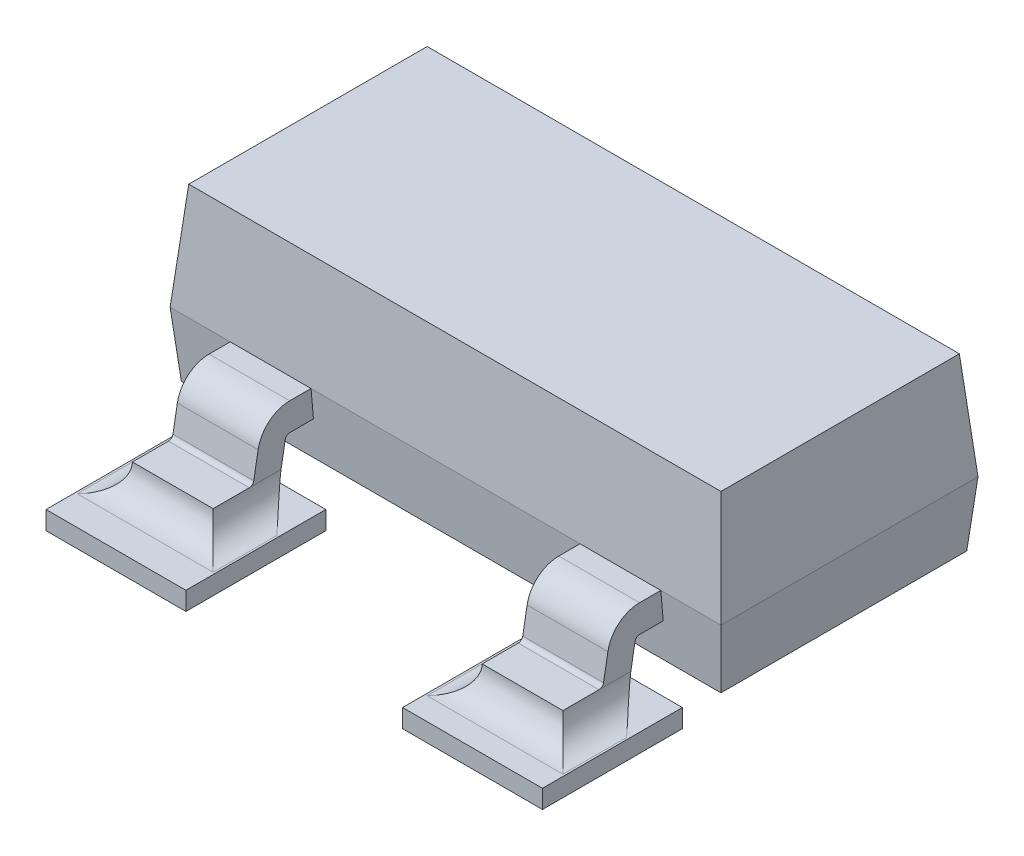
ISO-10303-21;
HEADER;
FILE_DESCRIPTION(('STEP AP214'),'2;1');
FILE_NAME('part.step','',(''),(''),'','','');
FILE_SCHEMA(('AUTOMOTIVE_DESIGN { 1 0 10303 214 1 1 1 1 }'));
ENDSEC;
DATA;
#1=APPLICATION_CONTEXT('core data for automotive mechanical design processes');
#2=APPLICATION_PROTOCOL_DEFINITION('international standard','automotive_design',2000,#1);
#3=PRODUCT_CONTEXT('',#1,'mechanical');
#4=PRODUCT('Part','Part','',(#3));
#5=PRODUCT_RELATED_PRODUCT_CATEGORY('part','',(#4));
#6=PRODUCT_DEFINITION_FORMATION('','',#4);
#7=PRODUCT_DEFINITION_CONTEXT('part definition',#1,'design');
#8=PRODUCT_DEFINITION('design','',#6,#7);
#9=PRODUCT_DEFINITION_SHAPE('','',#8);
#10=(LENGTH_UNIT() NAMED_UNIT(*) SI_UNIT(.MILLI.,.METRE.));
#11=(NAMED_UNIT(*) PLANE_ANGLE_UNIT() SI_UNIT($,.RADIAN.));
#12=(NAMED_UNIT(*) SI_UNIT($,.STERADIAN.) SOLID_ANGLE_UNIT());
#13=UNCERTAINTY_MEASURE_WITH_UNIT(LENGTH_MEASURE(1.E-05),#10,'distance_accuracy_value','');
#14=(GEOMETRIC_REPRESENTATION_CONTEXT(3) GLOBAL_UNCERTAINTY_ASSIGNED_CONTEXT((#13)) GLOBAL_UNIT_ASSIGNED_CONTEXT((#10,
#11,#12)) REPRESENTATION_CONTEXT('',''));
#15=CARTESIAN_POINT('',(0.,0.,0.));
#16=DIRECTION('',(0.,0.,1.));
#17=DIRECTION('',(1.,0.,0.));
#18=AXIS2_PLACEMENT_3D('',#15,#16,#17);
#19=CARTESIAN_POINT('',(0.,0.,0.));
#20=DIRECTION('',(0.,1.,0.));
#21=DIRECTION('',(0.,0.,1.));
#22=AXIS2_PLACEMENT_3D('',#19,#20,#21);
#23=PLANE('',#22);
#24=DIRECTION('',(1.,0.,0.));
#25=VECTOR('',#24,1.);
#26=CARTESIAN_POINT('',(0.5715,0.,0.743492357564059));
#27=LINE('',#26,#25);
#28=CARTESIAN_POINT('',(0.5715,0.,0.743492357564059));
#29=VERTEX_POINT('',#28);
#30=CARTESIAN_POINT('',(1.3335,0.,0.743492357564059));
#31=VERTEX_POINT('',#30);
#32=EDGE_CURVE('E1720',#29,#31,#27,.T.);
#33=ORIENTED_EDGE('',*,*,#32,.T.);
#34=DIRECTION('',(0.,0.,1.));
#35=VECTOR('',#34,1.);
#36=CARTESIAN_POINT('',(1.3335,0.,0.743492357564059));
#37=LINE('',#36,#35);
#38=CARTESIAN_POINT('',(1.3335,0.,1.50549235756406));
#39=VERTEX_POINT('',#38);
#40=EDGE_CURVE('E1725',#31,#39,#37,.T.);
#41=ORIENTED_EDGE('',*,*,#40,.T.);
#42=DIRECTION('',(-1.,0.,0.));
#43=VECTOR('',#42,1.);
#44=CARTESIAN_POINT('',(0.5715,0.,1.50549235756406));
#45=LINE('',#44,#43);
#46=CARTESIAN_POINT('',(0.5715,0.,1.50549235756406));
#47=VERTEX_POINT('',#46);
#48=EDGE_CURVE('E1732',#39,#47,#45,.T.);
#49=ORIENTED_EDGE('',*,*,#48,.T.);
#50=DIRECTION('',(0.,0.,-1.));
#51=VECTOR('',#50,1.);
#52=CARTESIAN_POINT('',(0.5715,0.,0.743492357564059));
#53=LINE('',#52,#51);
#54=EDGE_CURVE('E1737',#47,#29,#53,.T.);
#55=ORIENTED_EDGE('',*,*,#54,.T.);
#56=EDGE_LOOP('',(#33,#41,#49,#55));
#57=FACE_BOUND('',#56,.T.);
#58=ADVANCED_FACE('F17',(#57),#23,.F.);
#59=CARTESIAN_POINT('',(0.,0.,0.));
#60=DIRECTION('',(0.,1.,0.));
#61=DIRECTION('',(0.,0.,1.));
#62=AXIS2_PLACEMENT_3D('',#59,#60,#61);
#63=PLANE('',#62);
#64=DIRECTION('',(1.,0.,0.));
#65=VECTOR('',#64,1.);
#66=CARTESIAN_POINT('',(-1.3335,0.,0.78050764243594));
#67=LINE('',#66,#65);
#68=CARTESIAN_POINT('',(-1.3335,0.,0.78050764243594));
#69=VERTEX_POINT('',#68);
#70=CARTESIAN_POINT('',(-0.5715,0.,0.78050764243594));
#71=VERTEX_POINT('',#70);
#72=EDGE_CURVE('E1696',#69,#71,#67,.T.);
#73=ORIENTED_EDGE('',*,*,#72,.T.);
#74=DIRECTION('',(0.,0.,1.));
#75=VECTOR('',#74,1.);
#76=CARTESIAN_POINT('',(-0.5715,0.,0.78050764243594));
#77=LINE('',#76,#75);
#78=CARTESIAN_POINT('',(-0.5715,0.,1.54250764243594));
#79=VERTEX_POINT('',#78);
#80=EDGE_CURVE('E1701',#71,#79,#77,.T.);
#81=ORIENTED_EDGE('',*,*,#80,.T.);
#82=DIRECTION('',(-1.,0.,0.));
#83=VECTOR('',#82,1.);
#84=CARTESIAN_POINT('',(-1.3335,0.,1.54250764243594));
#85=LINE('',#84,#83);
#86=CARTESIAN_POINT('',(-1.3335,0.,1.54250764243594));
#87=VERTEX_POINT('',#86);
#88=EDGE_CURVE('E1709',#79,#87,#85,.T.);
#89=ORIENTED_EDGE('',*,*,#88,.T.);
#90=DIRECTION('',(0.,0.,-1.));
#91=VECTOR('',#90,1.);
#92=CARTESIAN_POINT('',(-1.3335,0.,0.78050764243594));
#93=LINE('',#92,#91);
#94=EDGE_CURVE('E1715',#87,#69,#93,.T.);
#95=ORIENTED_EDGE('',*,*,#94,.T.);
#96=EDGE_LOOP('',(#73,#81,#89,#95));
#97=FACE_BOUND('',#96,.T.);
#98=ADVANCED_FACE('F1615',(#97),#63,.F.);
#99=CARTESIAN_POINT('',(0.,0.,0.));
#100=DIRECTION('',(0.,1.,0.));
#101=DIRECTION('',(0.,0.,1.));
#102=AXIS2_PLACEMENT_3D('',#99,#100,#101);
#103=PLANE('',#102);
#104=DIRECTION('',(1.,0.,0.));
#105=VECTOR('',#104,1.);
#106=CARTESIAN_POINT('',(-0.381,0.,-1.54250764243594));
#107=LINE('',#106,#105);
#108=CARTESIAN_POINT('',(-0.381,0.,-1.54250764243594));
#109=VERTEX_POINT('',#108);
#110=CARTESIAN_POINT('',(0.381,0.,-1.54250764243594));
#111=VERTEX_POINT('',#110);
#112=EDGE_CURVE('E1671',#109,#111,#107,.T.);
#113=ORIENTED_EDGE('',*,*,#112,.T.);
#114=DIRECTION('',(0.,0.,1.));
#115=VECTOR('',#114,1.);
#116=CARTESIAN_POINT('',(0.381,0.,-1.54250764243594));
#117=LINE('',#116,#115);
#118=CARTESIAN_POINT('',(0.381,0.,-0.78050764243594));
#119=VERTEX_POINT('',#118);
#120=EDGE_CURVE('E1686',#111,#119,#117,.T.);
#121=ORIENTED_EDGE('',*,*,#120,.T.);
#122=DIRECTION('',(-1.,0.,0.));
#123=VECTOR('',#122,1.);
#124=CARTESIAN_POINT('',(-0.381,0.,-0.78050764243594));
#125=LINE('',#124,#123);
#126=CARTESIAN_POINT('',(-0.381,0.,-0.78050764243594));
#127=VERTEX_POINT('',#126);
#128=EDGE_CURVE('E1687',#119,#127,#125,.T.);
#129=ORIENTED_EDGE('',*,*,#128,.T.);
#130=DIRECTION('',(0.,0.,-1.));
#131=VECTOR('',#130,1.);
#132=CARTESIAN_POINT('',(-0.381,0.,-1.54250764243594));
#133=LINE('',#132,#131);
#134=EDGE_CURVE('E1692',#127,#109,#133,.T.);
#135=ORIENTED_EDGE('',*,*,#134,.T.);
#136=EDGE_LOOP('',(#113,#121,#129,#135));
#137=FACE_BOUND('',#136,.T.);
#138=ADVANCED_FACE('F1607',(#137),#103,.F.);
#139=CARTESIAN_POINT('',(0.5715,0.1,0.743492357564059));
#140=DIRECTION('',(1.,0.,0.));
#141=DIRECTION('',(0.,0.,-1.));
#142=AXIS2_PLACEMENT_3D('',#139,#140,#141);
#143=PLANE('',#142);
#144=DIRECTION('',(0.,1.,0.));
#145=VECTOR('',#144,1.);
#146=CARTESIAN_POINT('',(0.5715,0.1,1.50549235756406));
#147=LINE('',#146,#145);
#148=CARTESIAN_POINT('',(0.5715,0.1,1.50549235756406));
#149=VERTEX_POINT('',#148);
#150=EDGE_CURVE('E1735',#47,#149,#147,.T.);
#151=ORIENTED_EDGE('',*,*,#150,.T.);
#152=DIRECTION('',(0.,0.,1.));
#153=VECTOR('',#152,1.);
#154=CARTESIAN_POINT('',(0.5715,0.1,0.));
#155=LINE('',#154,#153);
#156=CARTESIAN_POINT('',(0.5715,0.1,0.743492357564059));
#157=VERTEX_POINT('',#156);
#158=EDGE_CURVE('E1670',#157,#149,#155,.T.);
#159=ORIENTED_EDGE('',*,*,#158,.F.);
#160=DIRECTION('',(0.,1.,0.));
#161=VECTOR('',#160,1.);
#162=CARTESIAN_POINT('',(0.5715,0.1,0.743492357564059));
#163=LINE('',#162,#161);
#164=EDGE_CURVE('E1724',#157,#29,#163,.F.);
#165=ORIENTED_EDGE('',*,*,#164,.T.);
#166=ORIENTED_EDGE('',*,*,#54,.F.);
#167=EDGE_LOOP('',(#151,#159,#165,#166));
#168=FACE_BOUND('',#167,.T.);
#169=ADVANCED_FACE('F1599',(#168),#143,.F.);
#170=CARTESIAN_POINT('',(0.5715,0.1,1.50549235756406));
#171=DIRECTION('',(0.,0.,-1.));
#172=DIRECTION('',(-1.,0.,0.));
#173=AXIS2_PLACEMENT_3D('',#170,#171,#172);
#174=PLANE('',#173);
#175=DIRECTION('',(0.,1.,0.));
#176=VECTOR('',#175,1.);
#177=CARTESIAN_POINT('',(1.3335,0.1,1.50549235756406));
#178=LINE('',#177,#176);
#179=CARTESIAN_POINT('',(1.3335,0.1,1.50549235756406));
#180=VERTEX_POINT('',#179);
#181=EDGE_CURVE('E1729',#39,#180,#178,.T.);
#182=ORIENTED_EDGE('',*,*,#181,.T.);
#183=DIRECTION('',(1.,0.,0.));
#184=VECTOR('',#183,1.);
#185=CARTESIAN_POINT('',(0.,0.1,1.50549235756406));
#186=LINE('',#185,#184);
#187=EDGE_CURVE('E1663',#149,#180,#186,.T.);
#188=ORIENTED_EDGE('',*,*,#187,.F.);
#189=ORIENTED_EDGE('',*,*,#150,.F.);
#190=ORIENTED_EDGE('',*,*,#48,.F.);
#191=EDGE_LOOP('',(#182,#188,#189,#190));
#192=FACE_BOUND('',#191,.T.);
#193=ADVANCED_FACE('F1591',(#192),#174,.F.);
#194=CARTESIAN_POINT('',(1.3335,0.1,0.743492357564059));
#195=DIRECTION('',(-1.,0.,0.));
#196=DIRECTION('',(0.,0.,1.));
#197=AXIS2_PLACEMENT_3D('',#194,#195,#196);
#198=PLANE('',#197);
#199=DIRECTION('',(0.,1.,0.));
#200=VECTOR('',#199,1.);
#201=CARTESIAN_POINT('',(1.3335,0.1,0.743492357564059));
#202=LINE('',#201,#200);
#203=CARTESIAN_POINT('',(1.3335,0.1,0.743492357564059));
#204=VERTEX_POINT('',#203);
#205=EDGE_CURVE('E1721',#31,#204,#202,.T.);
#206=ORIENTED_EDGE('',*,*,#205,.T.);
#207=DIRECTION('',(0.,0.,1.));
#208=VECTOR('',#207,1.);
#209=CARTESIAN_POINT('',(1.3335,0.1,0.));
#210=LINE('',#209,#208);
#211=EDGE_CURVE('E1656',#180,#204,#210,.F.);
#212=ORIENTED_EDGE('',*,*,#211,.F.);
#213=ORIENTED_EDGE('',*,*,#181,.F.);
#214=ORIENTED_EDGE('',*,*,#40,.F.);
#215=EDGE_LOOP('',(#206,#212,#213,#214));
#216=FACE_BOUND('',#215,.T.);
#217=ADVANCED_FACE('F1583',(#216),#198,.F.);
#218=CARTESIAN_POINT('',(0.5715,0.1,0.743492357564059));
#219=DIRECTION('',(0.,0.,1.));
#220=DIRECTION('',(1.,0.,0.));
#221=AXIS2_PLACEMENT_3D('',#218,#219,#220);
#222=PLANE('',#221);
#223=ORIENTED_EDGE('',*,*,#164,.F.);
#224=DIRECTION('',(1.,0.,0.));
#225=VECTOR('',#224,1.);
#226=CARTESIAN_POINT('',(0.,0.1,0.743492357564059));
#227=LINE('',#226,#225);
#228=EDGE_CURVE('E1654',#204,#157,#227,.F.);
#229=ORIENTED_EDGE('',*,*,#228,.F.);
#230=ORIENTED_EDGE('',*,*,#205,.F.);
#231=ORIENTED_EDGE('',*,*,#32,.F.);
#232=EDGE_LOOP('',(#223,#229,#230,#231));
#233=FACE_BOUND('',#232,.T.);
#234=ADVANCED_FACE('F1575',(#233),#222,.F.);
#235=CARTESIAN_POINT('',(-1.3335,0.1,0.78050764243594));
#236=DIRECTION('',(1.,0.,0.));
#237=DIRECTION('',(0.,0.,-1.));
#238=AXIS2_PLACEMENT_3D('',#235,#236,#237);
#239=PLANE('',#238);
#240=DIRECTION('',(0.,1.,0.));
#241=VECTOR('',#240,1.);
#242=CARTESIAN_POINT('',(-1.3335,0.1,1.54250764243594));
#243=LINE('',#242,#241);
#244=CARTESIAN_POINT('',(-1.3335,0.1,1.54250764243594));
#245=VERTEX_POINT('',#244);
#246=EDGE_CURVE('E1712',#87,#245,#243,.T.);
#247=ORIENTED_EDGE('',*,*,#246,.T.);
#248=DIRECTION('',(0.,0.,1.));
#249=VECTOR('',#248,1.);
#250=CARTESIAN_POINT('',(-1.3335,0.1,0.));
#251=LINE('',#250,#249);
#252=CARTESIAN_POINT('',(-1.3335,0.1,0.78050764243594));
#253=VERTEX_POINT('',#252);
#254=EDGE_CURVE('E1829',#253,#245,#251,.T.);
#255=ORIENTED_EDGE('',*,*,#254,.F.);
#256=DIRECTION('',(0.,1.,0.));
#257=VECTOR('',#256,1.);
#258=CARTESIAN_POINT('',(-1.3335,0.1,0.78050764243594));
#259=LINE('',#258,#257);
#260=EDGE_CURVE('E1700',#253,#69,#259,.F.);
#261=ORIENTED_EDGE('',*,*,#260,.T.);
#262=ORIENTED_EDGE('',*,*,#94,.F.);
#263=EDGE_LOOP('',(#247,#255,#261,#262));
#264=FACE_BOUND('',#263,.T.);
#265=ADVANCED_FACE('F1567',(#264),#239,.F.);
#266=CARTESIAN_POINT('',(-1.3335,0.1,1.54250764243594));
#267=DIRECTION('',(0.,0.,-1.));
#268=DIRECTION('',(-1.,0.,0.));
#269=AXIS2_PLACEMENT_3D('',#266,#267,#268);
#270=PLANE('',#269);
#271=DIRECTION('',(0.,1.,0.));
#272=VECTOR('',#271,1.);
#273=CARTESIAN_POINT('',(-0.5715,0.1,1.54250764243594));
#274=LINE('',#273,#272);
#275=CARTESIAN_POINT('',(-0.5715,0.1,1.54250764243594));
#276=VERTEX_POINT('',#275);
#277=EDGE_CURVE('E1706',#79,#276,#274,.T.);
#278=ORIENTED_EDGE('',*,*,#277,.T.);
#279=DIRECTION('',(1.,0.,0.));
#280=VECTOR('',#279,1.);
#281=CARTESIAN_POINT('',(0.,0.1,1.54250764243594));
#282=LINE('',#281,#280);
#283=EDGE_CURVE('E1827',#245,#276,#282,.T.);
#284=ORIENTED_EDGE('',*,*,#283,.F.);
#285=ORIENTED_EDGE('',*,*,#246,.F.);
#286=ORIENTED_EDGE('',*,*,#88,.F.);
#287=EDGE_LOOP('',(#278,#284,#285,#286));
#288=FACE_BOUND('',#287,.T.);
#289=ADVANCED_FACE('F1559',(#288),#270,.F.);
#290=CARTESIAN_POINT('',(-0.5715,0.1,0.78050764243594));
#291=DIRECTION('',(-1.,0.,0.));
#292=DIRECTION('',(0.,0.,1.));
#293=AXIS2_PLACEMENT_3D('',#290,#291,#292);
#294=PLANE('',#293);
#295=DIRECTION('',(0.,1.,0.));
#296=VECTOR('',#295,1.);
#297=CARTESIAN_POINT('',(-0.5715,0.1,0.78050764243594));
#298=LINE('',#297,#296);
#299=CARTESIAN_POINT('',(-0.5715,0.1,0.78050764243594));
#300=VERTEX_POINT('',#299);
#301=EDGE_CURVE('E1697',#71,#300,#298,.T.);
#302=ORIENTED_EDGE('',*,*,#301,.T.);
#303=DIRECTION('',(0.,0.,1.));
#304=VECTOR('',#303,1.);
#305=CARTESIAN_POINT('',(-0.5715,0.1,0.));
#306=LINE('',#305,#304);
#307=EDGE_CURVE('E1828',#276,#300,#306,.F.);
#308=ORIENTED_EDGE('',*,*,#307,.F.);
#309=ORIENTED_EDGE('',*,*,#277,.F.);
#310=ORIENTED_EDGE('',*,*,#80,.F.);
#311=EDGE_LOOP('',(#302,#308,#309,#310));
#312=FACE_BOUND('',#311,.T.);
#313=ADVANCED_FACE('F1551',(#312),#294,.F.);
#314=CARTESIAN_POINT('',(-1.3335,0.1,0.78050764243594));
#315=DIRECTION('',(0.,0.,1.));
#316=DIRECTION('',(1.,0.,0.));
#317=AXIS2_PLACEMENT_3D('',#314,#315,#316);
#318=PLANE('',#317);
#319=ORIENTED_EDGE('',*,*,#260,.F.);
#320=DIRECTION('',(1.,0.,0.));
#321=VECTOR('',#320,1.);
#322=CARTESIAN_POINT('',(0.,0.1,0.78050764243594));
#323=LINE('',#322,#321);
#324=EDGE_CURVE('E1823',#300,#253,#323,.F.);
#325=ORIENTED_EDGE('',*,*,#324,.F.);
#326=ORIENTED_EDGE('',*,*,#301,.F.);
#327=ORIENTED_EDGE('',*,*,#72,.F.);
#328=EDGE_LOOP('',(#319,#325,#326,#327));
#329=FACE_BOUND('',#328,.T.);
#330=ADVANCED_FACE('F1543',(#329),#318,.F.);
#331=CARTESIAN_POINT('',(-0.381,0.1,-1.54250764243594));
#332=DIRECTION('',(1.,0.,0.));
#333=DIRECTION('',(0.,0.,-1.));
#334=AXIS2_PLACEMENT_3D('',#331,#332,#333);
#335=PLANE('',#334);
#336=DIRECTION('',(0.,1.,0.));
#337=VECTOR('',#336,1.);
#338=CARTESIAN_POINT('',(-0.381,0.1,-0.78050764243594));
#339=LINE('',#338,#337);
#340=CARTESIAN_POINT('',(-0.381,0.1,-0.78050764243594));
#341=VERTEX_POINT('',#340);
#342=EDGE_CURVE('E1689',#127,#341,#339,.T.);
#343=ORIENTED_EDGE('',*,*,#342,.T.);
#344=DIRECTION('',(0.,0.,1.));
#345=VECTOR('',#344,1.);
#346=CARTESIAN_POINT('',(-0.381,0.1,0.));
#347=LINE('',#346,#345);
#348=CARTESIAN_POINT('',(-0.381,0.1,-1.54250764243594));
#349=VERTEX_POINT('',#348);
#350=EDGE_CURVE('E455',#349,#341,#347,.T.);
#351=ORIENTED_EDGE('',*,*,#350,.F.);
#352=DIRECTION('',(0.,1.,0.));
#353=VECTOR('',#352,1.);
#354=CARTESIAN_POINT('',(-0.381,0.1,-1.54250764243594));
#355=LINE('',#354,#353);
#356=EDGE_CURVE('E1675',#349,#109,#355,.F.);
#357=ORIENTED_EDGE('',*,*,#356,.T.);
#358=ORIENTED_EDGE('',*,*,#134,.F.);
#359=EDGE_LOOP('',(#343,#351,#357,#358));
#360=FACE_BOUND('',#359,.T.);
#361=ADVANCED_FACE('F1535',(#360),#335,.F.);
#362=CARTESIAN_POINT('',(-0.381,0.1,-0.78050764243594));
#363=DIRECTION('',(0.,0.,-1.));
#364=DIRECTION('',(-1.,0.,0.));
#365=AXIS2_PLACEMENT_3D('',#362,#363,#364);
#366=PLANE('',#365);
#367=DIRECTION('',(0.,1.,0.));
#368=VECTOR('',#367,1.);
#369=CARTESIAN_POINT('',(0.381,0.1,-0.78050764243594));
#370=LINE('',#369,#368);
#371=CARTESIAN_POINT('',(0.381,0.1,-0.78050764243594));
#372=VERTEX_POINT('',#371);
#373=EDGE_CURVE('E1683',#119,#372,#370,.T.);
#374=ORIENTED_EDGE('',*,*,#373,.T.);
#375=DIRECTION('',(1.,0.,0.));
#376=VECTOR('',#375,1.);
#377=CARTESIAN_POINT('',(0.,0.1,-0.78050764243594));
#378=LINE('',#377,#376);
#379=EDGE_CURVE('E1784',#341,#372,#378,.T.);
#380=ORIENTED_EDGE('',*,*,#379,.F.);
#381=ORIENTED_EDGE('',*,*,#342,.F.);
#382=ORIENTED_EDGE('',*,*,#128,.F.);
#383=EDGE_LOOP('',(#374,#380,#381,#382));
#384=FACE_BOUND('',#383,.T.);
#385=ADVANCED_FACE('F1527',(#384),#366,.F.);
#386=CARTESIAN_POINT('',(0.381,0.1,-1.54250764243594));
#387=DIRECTION('',(-1.,0.,0.));
#388=DIRECTION('',(0.,0.,1.));
#389=AXIS2_PLACEMENT_3D('',#386,#387,#388);
#390=PLANE('',#389);
#391=DIRECTION('',(0.,1.,0.));
#392=VECTOR('',#391,1.);
#393=CARTESIAN_POINT('',(0.381,0.1,-1.54250764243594));
#394=LINE('',#393,#392);
#395=CARTESIAN_POINT('',(0.381,0.1,-1.54250764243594));
#396=VERTEX_POINT('',#395);
#397=EDGE_CURVE('E1666',#111,#396,#394,.T.);
#398=ORIENTED_EDGE('',*,*,#397,.T.);
#399=DIRECTION('',(0.,0.,1.));
#400=VECTOR('',#399,1.);
#401=CARTESIAN_POINT('',(0.381,0.1,0.));
#402=LINE('',#401,#400);
#403=EDGE_CURVE('E1791',#372,#396,#402,.F.);
#404=ORIENTED_EDGE('',*,*,#403,.F.);
#405=ORIENTED_EDGE('',*,*,#373,.F.);
#406=ORIENTED_EDGE('',*,*,#120,.F.);
#407=EDGE_LOOP('',(#398,#404,#405,#406));
#408=FACE_BOUND('',#407,.T.);
#409=ADVANCED_FACE('F1519',(#408),#390,.F.);
#410=CARTESIAN_POINT('',(-0.381,0.1,-1.54250764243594));
#411=DIRECTION('',(0.,0.,1.));
#412=DIRECTION('',(1.,0.,0.));
#413=AXIS2_PLACEMENT_3D('',#410,#411,#412);
#414=PLANE('',#413);
#415=ORIENTED_EDGE('',*,*,#356,.F.);
#416=DIRECTION('',(1.,0.,0.));
#417=VECTOR('',#416,1.);
#418=CARTESIAN_POINT('',(0.,0.1,-1.54250764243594));
#419=LINE('',#418,#417);
#420=EDGE_CURVE('E462',#396,#349,#419,.F.);
#421=ORIENTED_EDGE('',*,*,#420,.F.);
#422=ORIENTED_EDGE('',*,*,#397,.F.);
#423=ORIENTED_EDGE('',*,*,#112,.F.);
#424=EDGE_LOOP('',(#415,#421,#422,#423));
#425=FACE_BOUND('',#424,.T.);
#426=ADVANCED_FACE('F1511',(#425),#414,.F.);
#427=CARTESIAN_POINT('',(0.,0.1,0.));
#428=DIRECTION('',(0.,1.,0.));
#429=DIRECTION('',(0.,0.,1.));
#430=AXIS2_PLACEMENT_3D('',#427,#428,#429);
#431=PLANE('',#430);
#432=ORIENTED_EDGE('',*,*,#211,.T.);
#433=ORIENTED_EDGE('',*,*,#228,.T.);
#434=ORIENTED_EDGE('',*,*,#158,.T.);
#435=ORIENTED_EDGE('',*,*,#187,.T.);
#436=EDGE_LOOP('',(#432,#433,#434,#435));
#437=FACE_BOUND('',#436,.T.);
#438=DIRECTION('',(1.,0.,0.));
#439=VECTOR('',#438,1.);
#440=CARTESIAN_POINT('',(0.,0.1,1.38321800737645));
#441=LINE('',#440,#439);
#442=CARTESIAN_POINT('',(1.3225,0.1,1.38321800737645));
#443=VERTEX_POINT('',#442);
#444=CARTESIAN_POINT('',(0.5825,0.1,1.38321800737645));
#445=VERTEX_POINT('',#444);
#446=EDGE_CURVE('E1280',#443,#445,#441,.F.);
#447=ORIENTED_EDGE('',*,*,#446,.T.);
#448=DIRECTION('',(0.,0.,1.));
#449=VECTOR('',#448,1.);
#450=CARTESIAN_POINT('',(0.5825,0.1,1.0365468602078));
#451=LINE('',#450,#449);
#452=CARTESIAN_POINT('',(0.5825,0.0999999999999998,1.0365468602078));
#453=VERTEX_POINT('',#452);
#454=EDGE_CURVE('E1072',#445,#453,#451,.F.);
#455=ORIENTED_EDGE('',*,*,#454,.T.);
#456=DIRECTION('',(-1.,0.,0.));
#457=VECTOR('',#456,1.);
#458=CARTESIAN_POINT('',(1.1725,0.0999999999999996,1.0365468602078));
#459=LINE('',#458,#457);
#460=CARTESIAN_POINT('',(1.3225,0.0999999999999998,1.0365468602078));
#461=VERTEX_POINT('',#460);
#462=EDGE_CURVE('E1137',#461,#453,#459,.T.);
#463=ORIENTED_EDGE('',*,*,#462,.F.);
#464=DIRECTION('',(0.,0.,-1.));
#465=VECTOR('',#464,1.);
#466=CARTESIAN_POINT('',(1.3225,0.1,0.));
#467=LINE('',#466,#465);
#468=EDGE_CURVE('E1130',#461,#443,#467,.F.);
#469=ORIENTED_EDGE('',*,*,#468,.T.);
#470=EDGE_LOOP('',(#447,#455,#463,#469));
#471=FACE_BOUND('',#470,.T.);
#472=ADVANCED_FACE('F1504',(#437,#471),#431,.T.);
#473=CARTESIAN_POINT('',(0.,0.25,1.38321800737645));
#474=DIRECTION('',(1.,0.,0.));
#475=DIRECTION('',(0.,0.,-1.));
#476=AXIS2_PLACEMENT_3D('',#473,#474,#475);
#477=CYLINDRICAL_SURFACE('',#476,0.15);
#478=ORIENTED_EDGE('',*,*,#446,.F.);
#479=CARTESIAN_POINT('',(1.3225,0.1,1.38321800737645));
#480=CARTESIAN_POINT('',(1.31931826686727,0.099999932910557,1.38003622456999));
#481=CARTESIAN_POINT('',(1.31614379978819,0.10010123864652,1.37684704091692));
#482=CARTESIAN_POINT('',(1.30992406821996,0.100501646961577,1.37057894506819));
#483=CARTESIAN_POINT('',(1.30687822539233,0.100793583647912,1.36750014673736));
#484=CARTESIAN_POINT('',(1.30091571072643,0.10155592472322,1.361463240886));
#485=CARTESIAN_POINT('',(1.29799841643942,0.102019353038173,1.35850486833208));
#486=CARTESIAN_POINT('',(1.29229306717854,0.103105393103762,1.35271703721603));
#487=CARTESIAN_POINT('',(1.28950433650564,0.103721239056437,1.34988697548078));
#488=CARTESIAN_POINT('',(1.28405616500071,0.105093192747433,1.34436193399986));
#489=CARTESIAN_POINT('',(1.28139598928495,0.105842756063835,1.341666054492));
#490=CARTESIAN_POINT('',(1.27620499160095,0.107463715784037,1.33641366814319));
#491=CARTESIAN_POINT('',(1.27367336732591,0.108328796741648,1.33385600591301));
#492=CARTESIAN_POINT('',(1.26873954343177,0.110162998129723,1.32888264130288));
#493=CARTESIAN_POINT('',(1.26633646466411,0.111126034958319,1.32646556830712));
#494=CARTESIAN_POINT('',(1.26165981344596,0.113139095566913,1.32177444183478));
#495=CARTESIAN_POINT('',(1.25938527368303,0.11418326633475,1.31949884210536));
#496=CARTESIAN_POINT('',(1.25496579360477,0.116342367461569,1.31509036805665));
#497=CARTESIAN_POINT('',(1.25281978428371,0.117451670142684,1.31295581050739));
#498=CARTESIAN_POINT('',(1.24865747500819,0.119725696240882,1.30882794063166));
#499=CARTESIAN_POINT('',(1.2466399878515,0.120885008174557,1.30683284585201));
#500=CARTESIAN_POINT('',(1.24273484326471,0.12324464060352,1.30298140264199));
#501=CARTESIAN_POINT('',(1.24084586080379,0.124439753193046,1.30112320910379));
#502=CARTESIAN_POINT('',(1.23719789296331,0.126857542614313,1.29754219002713));
#503=CARTESIAN_POINT('',(1.23543741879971,0.128075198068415,1.2958174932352));
#504=CARTESIAN_POINT('',(1.23204657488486,0.130525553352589,1.29249941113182));
#505=CARTESIAN_POINT('',(1.23041452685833,0.131753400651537,1.29090416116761));
#506=CARTESIAN_POINT('',(1.22728097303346,0.134212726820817,1.2878401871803));
#507=CARTESIAN_POINT('',(1.22577754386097,0.135439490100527,1.28636964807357));
#508=CARTESIAN_POINT('',(1.22290069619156,0.137885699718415,1.28355034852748));
#509=CARTESIAN_POINT('',(1.22152512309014,0.139100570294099,1.28219982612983));
#510=CARTESIAN_POINT('',(1.21890693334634,0.141514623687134,1.27961379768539));
#511=CARTESIAN_POINT('',(1.21766164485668,0.142709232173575,1.27837672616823));
#512=CARTESIAN_POINT('',(1.21462331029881,0.145740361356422,1.27534563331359));
#513=CARTESIAN_POINT('',(1.21285098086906,0.147612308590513,1.27356611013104));
#514=CARTESIAN_POINT('',(1.20941971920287,0.151434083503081,1.27011970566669));
#515=CARTESIAN_POINT('',(1.20775906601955,0.153380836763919,1.26845112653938));
#516=CARTESIAN_POINT('',(1.20455469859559,0.157347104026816,1.26522730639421));
#517=CARTESIAN_POINT('',(1.20300911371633,0.159363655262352,1.26367028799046));
#518=CARTESIAN_POINT('',(1.20003405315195,0.16346207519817,1.26067218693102));
#519=CARTESIAN_POINT('',(1.1986026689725,0.165541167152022,1.25922920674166));
#520=CARTESIAN_POINT('',(1.19585629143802,0.169757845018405,1.2564607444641));
#521=CARTESIAN_POINT('',(1.19453933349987,0.171892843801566,1.25513327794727));
#522=CARTESIAN_POINT('',(1.19202182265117,0.176214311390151,1.25259717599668));
#523=CARTESIAN_POINT('',(1.1908192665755,0.178398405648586,1.25138648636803));
#524=CARTESIAN_POINT('',(1.18853051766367,0.182811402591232,1.24908470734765));
#525=CARTESIAN_POINT('',(1.18744229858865,0.185038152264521,1.24799152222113));
#526=CARTESIAN_POINT('',(1.18588895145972,0.188424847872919,1.24643346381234));
#527=CARTESIAN_POINT('',(1.1853882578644,0.189551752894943,1.24593165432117));
#528=CARTESIAN_POINT('',(1.18441571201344,0.191813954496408,1.24495780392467));
#529=CARTESIAN_POINT('',(1.18394360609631,0.19294902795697,1.24448549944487));
#530=CARTESIAN_POINT('',(1.1830282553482,0.195226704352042,1.24357067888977));
#531=CARTESIAN_POINT('',(1.18258475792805,0.196369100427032,1.24312790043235));
#532=CARTESIAN_POINT('',(1.18172661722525,0.198660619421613,1.24227210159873));
#533=CARTESIAN_POINT('',(1.18131172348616,0.199809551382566,1.24185882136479));
#534=CARTESIAN_POINT('',(1.18051078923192,0.202113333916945,1.24106197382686));
#535=CARTESIAN_POINT('',(1.18012450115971,0.203268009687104,1.24067815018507));
#536=CARTESIAN_POINT('',(1.17938077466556,0.205582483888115,1.23994014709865));
#537=CARTESIAN_POINT('',(1.17902309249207,0.206742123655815,1.23958571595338));
#538=CARTESIAN_POINT('',(1.17833657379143,0.209065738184,1.23890640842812));
#539=CARTESIAN_POINT('',(1.17800749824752,0.210229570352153,1.23858128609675));
#540=CARTESIAN_POINT('',(1.17737818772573,0.21256079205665,1.23796048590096));
#541=CARTESIAN_POINT('',(1.17707771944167,0.213728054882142,1.23766456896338));
#542=CARTESIAN_POINT('',(1.17650561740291,0.216065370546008,1.23710204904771));
#543=CARTESIAN_POINT('',(1.17623375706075,0.217235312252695,1.23683521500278));
#544=CARTESIAN_POINT('',(1.1757188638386,0.219577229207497,1.23633071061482));
#545=CARTESIAN_POINT('',(1.17547561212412,0.220749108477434,1.23609281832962));
#546=CARTESIAN_POINT('',(1.17501792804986,0.223094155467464,1.23564602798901));
#547=CARTESIAN_POINT('',(1.17480328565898,0.224267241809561,1.235436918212));
#548=CARTESIAN_POINT('',(1.17440281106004,0.226613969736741,1.23504750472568));
#549=CARTESIAN_POINT('',(1.17421677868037,0.227787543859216,1.23486700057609));
#550=CARTESIAN_POINT('',(1.17387351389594,0.230134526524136,1.23453459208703));
#551=CARTESIAN_POINT('',(1.17371609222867,0.231307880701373,1.23438249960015));
#552=CARTESIAN_POINT('',(1.17343003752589,0.233653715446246,1.2341066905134));
#553=CARTESIAN_POINT('',(1.17330122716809,0.234826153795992,1.23398279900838));
#554=CARTESIAN_POINT('',(1.17307238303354,0.237169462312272,1.23376315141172));
#555=CARTESIAN_POINT('',(1.17297218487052,0.238340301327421,1.23366723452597));
#556=CARTESIAN_POINT('',(1.17280055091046,0.240679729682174,1.23350327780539));
#557=CARTESIAN_POINT('',(1.17272896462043,0.241848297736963,1.23343509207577));
#558=CARTESIAN_POINT('',(1.17261454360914,0.244182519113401,1.23332632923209));
#559=CARTESIAN_POINT('',(1.17257157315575,0.245348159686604,1.23328562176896));
#560=CARTESIAN_POINT('',(1.17251435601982,0.247675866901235,1.233231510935));
#561=CARTESIAN_POINT('',(1.17249998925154,0.248837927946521,1.23321799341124));
#562=CARTESIAN_POINT('',(1.1725,0.25,1.23321800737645));
#563=B_SPLINE_CURVE_WITH_KNOTS('',3,(#479,#480,#481,#482,#483,#484,#485,#486,#487,#488,#489,
#490,#491,#492,#493,#494,#495,#496,#497,#498,#499,#500,#501,#502,#503,#504,#505,#506,#507,#508,
#509,#510,#511,#512,#513,#514,#515,#516,#517,#518,#519,#520,#521,#522,#523,#524,#525,#526,#527,
#528,#529,#530,#531,#532,#533,#534,#535,#536,#537,#538,#539,#540,#541,#542,#543,#544,#545,#546,
#547,#548,#549,#550,#551,#552,#553,#554,#555,#556,#557,#558,#559,#560,#561,#562),.UNSPECIFIED.,
.F.,.F.,(4,2,2,2,2,2,2,2,2,2,2,2,2,2,2,2,2,2,2,2,2,2,2,2,2,2,2,2,2,2,2,2,2,2,2,2,2,2,2,2,2,4),
(0.,0.013498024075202,0.0265157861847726,0.0390536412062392,0.0511119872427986,
0.0626912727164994,0.0737920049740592,0.0844147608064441,0.094560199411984,0.104229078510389,
0.11342227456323,0.12214080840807,0.130385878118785,0.138158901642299,0.145461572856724,
0.152295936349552,0.158664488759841,0.168057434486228,0.17721789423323,0.186153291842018,
0.194871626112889,0.203381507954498,0.211692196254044,0.219813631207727,0.223807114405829,
0.227757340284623,0.231665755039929,0.235533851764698,0.23936317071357,0.243155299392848,
0.246911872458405,0.250634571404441,0.254325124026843,0.257985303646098,0.261616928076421,
0.265221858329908,0.268801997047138,0.272359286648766,0.275895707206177,0.279413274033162,
0.282914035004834,0.286400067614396),.UNSPECIFIED.);
#564=CARTESIAN_POINT('',(1.1725,0.25,1.23321800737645));
#565=VERTEX_POINT('',#564);
#566=EDGE_CURVE('E1115',#443,#565,#563,.T.);
#567=ORIENTED_EDGE('',*,*,#566,.T.);
#568=DIRECTION('',(1.,0.,0.));
#569=VECTOR('',#568,1.);
#570=CARTESIAN_POINT('',(1.1725,0.249999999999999,1.23321800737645));
#571=LINE('',#570,#569);
#572=CARTESIAN_POINT('',(0.7325,0.25,1.23321800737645));
#573=VERTEX_POINT('',#572);
#574=EDGE_CURVE('E1273',#565,#573,#571,.F.);
#575=ORIENTED_EDGE('',*,*,#574,.T.);
#576=CARTESIAN_POINT('',(0.7325,0.25,1.23321800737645));
#577=CARTESIAN_POINT('',(0.732500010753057,0.248837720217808,1.23321799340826));
#578=CARTESIAN_POINT('',(0.732485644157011,0.24767545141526,1.23323151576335));
#579=CARTESIAN_POINT('',(0.732428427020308,0.24534734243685,1.23328564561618));
#580=CARTESIAN_POINT('',(0.732385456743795,0.244181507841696,1.2333263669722));
#581=CARTESIAN_POINT('',(0.73227103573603,0.241846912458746,1.23343516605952));
#582=CARTESIAN_POINT('',(0.732199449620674,0.240678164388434,1.23350337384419));
#583=CARTESIAN_POINT('',(0.732027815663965,0.238338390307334,1.23366738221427));
#584=CARTESIAN_POINT('',(0.73192761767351,0.237167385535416,1.2337633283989));
#585=CARTESIAN_POINT('',(0.731698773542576,0.234823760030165,1.23398304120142));
#586=CARTESIAN_POINT('',(0.731569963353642,0.233651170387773,1.23410696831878));
#587=CARTESIAN_POINT('',(0.731283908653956,0.23130504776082,1.23438285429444));
#588=CARTESIAN_POINT('',(0.731126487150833,0.23013155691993,1.23453498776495));
#589=CARTESIAN_POINT('',(0.730783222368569,0.227784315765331,1.23486748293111));
#590=CARTESIAN_POINT('',(0.730597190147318,0.226610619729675,1.23504803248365));
#591=CARTESIAN_POINT('',(0.730196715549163,0.22426366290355,1.23543754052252));
#592=CARTESIAN_POINT('',(0.729982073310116,0.223090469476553,1.2356466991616));
#593=CARTESIAN_POINT('',(0.729524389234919,0.220745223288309,1.23609359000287));
#594=CARTESIAN_POINT('',(0.729281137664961,0.219573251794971,1.23633153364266));
#595=CARTESIAN_POINT('',(0.728766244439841,0.217231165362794,1.23683614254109));
#596=CARTESIAN_POINT('',(0.728494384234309,0.216061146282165,1.23710302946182));
#597=CARTESIAN_POINT('',(0.727922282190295,0.213723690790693,1.23766565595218));
#598=CARTESIAN_POINT('',(0.727621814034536,0.212556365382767,1.23796162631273));
#599=CARTESIAN_POINT('',(0.726992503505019,0.210225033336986,1.23858253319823));
#600=CARTESIAN_POINT('',(0.726663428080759,0.209061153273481,1.23890770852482));
#601=CARTESIAN_POINT('',(0.725976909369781,0.206737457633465,1.23958712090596));
#602=CARTESIAN_POINT('',(0.725619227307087,0.205577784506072,1.23994160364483));
#603=CARTESIAN_POINT('',(0.724875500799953,0.203263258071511,1.24067970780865));
#604=CARTESIAN_POINT('',(0.724489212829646,0.202108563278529,1.24106358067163));
#605=CARTESIAN_POINT('',(0.72368827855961,0.199804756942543,1.24186052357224));
#606=CARTESIAN_POINT('',(0.723273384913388,0.198655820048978,1.24227384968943));
#607=CARTESIAN_POINT('',(0.722415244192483,0.196364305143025,1.24312973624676));
#608=CARTESIAN_POINT('',(0.721971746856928,0.195221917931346,1.24357255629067));
#609=CARTESIAN_POINT('',(0.721056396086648,0.192944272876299,1.24448745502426));
#610=CARTESIAN_POINT('',(0.720584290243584,0.191809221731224,1.24495979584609));
#611=CARTESIAN_POINT('',(0.719611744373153,0.189547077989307,1.2459337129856));
#612=CARTESIAN_POINT('',(0.719111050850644,0.188420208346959,1.24643555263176));
#613=CARTESIAN_POINT('',(0.717557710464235,0.185033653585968,1.24799368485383));
#614=CARTESIAN_POINT('',(0.716469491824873,0.182807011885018,1.24908690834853));
#615=CARTESIAN_POINT('',(0.714180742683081,0.178394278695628,1.25138873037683));
#616=CARTESIAN_POINT('',(0.712978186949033,0.176210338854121,1.25259942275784));
#617=CARTESIAN_POINT('',(0.710460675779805,0.171889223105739,1.2551354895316));
#618=CARTESIAN_POINT('',(0.709143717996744,0.16975442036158,1.25646291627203));
#619=CARTESIAN_POINT('',(0.706397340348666,0.165538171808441,1.25923125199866));
#620=CARTESIAN_POINT('',(0.704965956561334,0.163459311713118,1.26067414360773));
#621=CARTESIAN_POINT('',(0.701990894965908,0.159361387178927,1.2636720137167));
#622=CARTESIAN_POINT('',(0.700445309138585,0.157345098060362,1.26522888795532));
#623=CARTESIAN_POINT('',(0.697240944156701,0.153379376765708,1.26845236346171));
#624=CARTESIAN_POINT('',(0.695580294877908,0.151432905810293,1.27012074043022));
#625=CARTESIAN_POINT('',(0.692149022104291,0.147611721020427,1.27356666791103));
#626=CARTESIAN_POINT('',(0.690376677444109,0.145740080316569,1.27534591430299));
#627=CARTESIAN_POINT('',(0.687337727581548,0.142708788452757,1.27837716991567));
#628=CARTESIAN_POINT('',(0.686091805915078,0.141513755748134,1.27961469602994));
#629=CARTESIAN_POINT('',(0.68347243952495,0.139098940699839,1.28220160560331));
#630=CARTESIAN_POINT('',(0.682096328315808,0.137883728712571,1.28355255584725));
#631=CARTESIAN_POINT('',(0.67921848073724,0.135436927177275,1.28637267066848));
#632=CARTESIAN_POINT('',(0.677714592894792,0.134209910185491,1.28784359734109));
#633=CARTESIAN_POINT('',(0.674580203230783,0.13175016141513,1.29090830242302));
#634=CARTESIAN_POINT('',(0.672947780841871,0.130522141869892,1.29250389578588));
#635=CARTESIAN_POINT('',(0.66955626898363,0.128071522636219,1.29582261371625));
#636=CARTESIAN_POINT('',(0.667795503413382,0.126853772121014,1.29754760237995));
#637=CARTESIAN_POINT('',(0.664147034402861,0.124435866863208,1.3011291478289));
#638=CARTESIAN_POINT('',(0.662257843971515,0.123240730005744,1.3029875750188));
#639=CARTESIAN_POINT('',(0.65835236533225,0.120881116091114,1.30683942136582));
#640=CARTESIAN_POINT('',(0.656334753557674,0.119721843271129,1.30883468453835));
#641=CARTESIAN_POINT('',(0.652172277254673,0.117447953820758,1.31296282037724));
#642=CARTESIAN_POINT('',(0.650026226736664,0.11633874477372,1.3150974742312));
#643=CARTESIAN_POINT('',(0.645606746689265,0.114179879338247,1.31950606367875));
#644=CARTESIAN_POINT('',(0.643332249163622,0.113135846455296,1.32178168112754));
#645=CARTESIAN_POINT('',(0.638655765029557,0.111123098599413,1.32647275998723));
#646=CARTESIAN_POINT('',(0.636252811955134,0.11016023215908,1.32888976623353));
#647=CARTESIAN_POINT('',(0.631319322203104,0.108326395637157,1.33386290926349));
#648=CARTESIAN_POINT('',(0.628787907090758,0.1074615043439,1.33642041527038));
#649=CARTESIAN_POINT('',(0.623597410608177,0.105840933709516,1.34167239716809));
#650=CARTESIAN_POINT('',(0.620937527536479,0.105091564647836,1.34436802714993));
#651=CARTESIAN_POINT('',(0.615490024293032,0.103719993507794,1.34989247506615));
#652=CARTESIAN_POINT('',(0.612701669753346,0.103104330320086,1.35272219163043));
#653=CARTESIAN_POINT('',(0.606997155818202,0.102018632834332,1.35850923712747));
#654=CARTESIAN_POINT('',(0.604080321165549,0.101555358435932,1.36146716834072));
#655=CARTESIAN_POINT('',(0.598118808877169,0.100793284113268,1.36750309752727));
#656=CARTESIAN_POINT('',(0.595073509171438,0.100501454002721,1.37058135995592));
#657=CARTESIAN_POINT('',(0.588854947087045,0.100101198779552,1.37684829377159));
#658=CARTESIAN_POINT('',(0.585681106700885,0.0999999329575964,1.38003685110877));
#659=CARTESIAN_POINT('',(0.5825,0.1,1.38321800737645));
#660=B_SPLINE_CURVE_WITH_KNOTS('',3,(#576,#577,#578,#579,#580,#581,#582,#583,#584,#585,#586,
#587,#588,#589,#590,#591,#592,#593,#594,#595,#596,#597,#598,#599,#600,#601,#602,#603,#604,#605,
#606,#607,#608,#609,#610,#611,#612,#613,#614,#615,#616,#617,#618,#619,#620,#621,#622,#623,#624,
#625,#626,#627,#628,#629,#630,#631,#632,#633,#634,#635,#636,#637,#638,#639,#640,#641,#642,#643,
#644,#645,#646,#647,#648,#649,#650,#651,#652,#653,#654,#655,#656,#657,#658,#659),.UNSPECIFIED.,
.F.,.F.,(4,2,2,2,2,2,2,2,2,2,2,2,2,2,2,2,2,2,2,2,2,2,2,2,2,2,2,2,2,2,2,2,2,2,2,2,2,2,2,2,2,4),
(0.,0.00348665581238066,0.00698799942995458,0.0105061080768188,0.0140430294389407,
0.0176007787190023,0.0211813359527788,0.0247866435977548,0.0284186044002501,0.0320790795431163,
0.0357698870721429,0.0394928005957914,0.0432495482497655,0.047041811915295,0.0508712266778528,
0.0547393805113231,0.0586478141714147,0.0625980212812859,0.0665914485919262,0.074712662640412,
0.0830229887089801,0.0915323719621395,0.100250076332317,0.109184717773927,0.118344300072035,
0.127736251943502,0.134107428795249,0.140944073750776,0.148248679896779,0.156023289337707,
0.164269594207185,0.172989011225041,0.182182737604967,0.191851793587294,0.201997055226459,
0.212619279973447,0.223719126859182,0.23529717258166,0.247353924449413,0.259889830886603,
0.272905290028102,0.286400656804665),.UNSPECIFIED.);
#661=EDGE_CURVE('E1079',#573,#445,#660,.T.);
#662=ORIENTED_EDGE('',*,*,#661,.T.);
#663=EDGE_LOOP('',(#478,#567,#575,#662));
#664=FACE_BOUND('',#663,.T.);
#665=ADVANCED_FACE('F1497',(#664),#477,.F.);
#666=CARTESIAN_POINT('',(1.1725,0.25,1.0365468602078));
#667=DIRECTION('',(0.,-1.,0.));
#668=DIRECTION('',(0.,0.,-1.));
#669=AXIS2_PLACEMENT_3D('',#666,#667,#668);
#670=PLANE('',#669);
#671=ORIENTED_EDGE('',*,*,#574,.F.);
#672=DIRECTION('',(0.,0.,-1.));
#673=VECTOR('',#672,1.);
#674=CARTESIAN_POINT('',(1.1725,0.25,0.));
#675=LINE('',#674,#673);
#676=CARTESIAN_POINT('',(1.1725,0.25,1.0365468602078));
#677=VERTEX_POINT('',#676);
#678=EDGE_CURVE('E1120',#565,#677,#675,.T.);
#679=ORIENTED_EDGE('',*,*,#678,.T.);
#680=DIRECTION('',(-1.,0.,0.));
#681=VECTOR('',#680,1.);
#682=CARTESIAN_POINT('',(1.1725,0.25,1.0365468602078));
#683=LINE('',#682,#681);
#684=CARTESIAN_POINT('',(0.7325,0.25,1.0365468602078));
#685=VERTEX_POINT('',#684);
#686=EDGE_CURVE('E440',#677,#685,#683,.T.);
#687=ORIENTED_EDGE('',*,*,#686,.T.);
#688=DIRECTION('',(0.,0.,1.));
#689=VECTOR('',#688,1.);
#690=CARTESIAN_POINT('',(0.7325,0.25,1.0365468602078));
#691=LINE('',#690,#689);
#692=EDGE_CURVE('E461',#685,#573,#691,.T.);
#693=ORIENTED_EDGE('',*,*,#692,.T.);
#694=EDGE_LOOP('',(#671,#679,#687,#693));
#695=FACE_BOUND('',#694,.T.);
#696=ADVANCED_FACE('F1161',(#695),#670,.F.);
#697=CARTESIAN_POINT('',(1.1725,0.275,1.0365468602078));
#698=DIRECTION('',(-1.,0.,0.));
#699=DIRECTION('',(0.,0.,1.));
#700=AXIS2_PLACEMENT_3D('',#697,#698,#699);
#701=CYLINDRICAL_SURFACE('',#700,0.175);
#702=DIRECTION('',(1.,0.,0.));
#703=VECTOR('',#702,1.);
#704=CARTESIAN_POINT('',(1.1725,0.244611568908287,0.864205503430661));
#705=LINE('',#704,#703);
#706=CARTESIAN_POINT('',(1.17259681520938,0.244611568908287,0.864205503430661));
#707=VERTEX_POINT('',#706);
#708=CARTESIAN_POINT('',(0.73240318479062,0.244611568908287,0.864205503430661));
#709=VERTEX_POINT('',#708);
#710=EDGE_CURVE('E1138',#707,#709,#705,.F.);
#711=ORIENTED_EDGE('',*,*,#710,.F.);
#712=CARTESIAN_POINT('',(1.17259681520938,0.244611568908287,0.864205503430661));
#713=CARTESIAN_POINT('',(1.17264174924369,0.243364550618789,0.864425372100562));
#714=CARTESIAN_POINT('',(1.172703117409,0.242120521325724,0.864658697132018));
#715=CARTESIAN_POINT('',(1.17285851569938,0.239629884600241,0.865153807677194));
#716=CARTESIAN_POINT('',(1.17295280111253,0.23838333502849,0.865415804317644));
#717=CARTESIAN_POINT('',(1.17317402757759,0.235888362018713,0.865968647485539));
#718=CARTESIAN_POINT('',(1.17330123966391,0.234640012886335,0.8662597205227));
#719=CARTESIAN_POINT('',(1.17358830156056,0.232142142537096,0.86687107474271));
#720=CARTESIAN_POINT('',(1.17374843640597,0.230892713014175,0.867191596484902));
#721=CARTESIAN_POINT('',(1.17410133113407,0.228393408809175,0.867862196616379));
#722=CARTESIAN_POINT('',(1.17429438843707,0.227143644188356,0.868212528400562));
#723=CARTESIAN_POINT('',(1.17471311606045,0.224644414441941,0.868943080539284));
#724=CARTESIAN_POINT('',(1.1749390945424,0.223395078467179,0.869323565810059));
#725=CARTESIAN_POINT('',(1.17542365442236,0.220897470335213,0.870114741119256));
#726=CARTESIAN_POINT('',(1.17568255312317,0.219649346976,0.870525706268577));
#727=CARTESIAN_POINT('',(1.17623294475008,0.217154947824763,0.871378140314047));
#728=CARTESIAN_POINT('',(1.17652476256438,0.215908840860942,0.871819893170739));
#729=CARTESIAN_POINT('',(1.1771409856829,0.213419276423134,0.872734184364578));
#730=CARTESIAN_POINT('',(1.17746572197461,0.212176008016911,0.873207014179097));
#731=CARTESIAN_POINT('',(1.17814777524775,0.20969294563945,0.874183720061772));
#732=CARTESIAN_POINT('',(1.17850542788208,0.20845336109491,0.874687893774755));
#733=CARTESIAN_POINT('',(1.17925331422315,0.205978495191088,0.87572753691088));
#734=CARTESIAN_POINT('',(1.1796438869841,0.20474344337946,0.876263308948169));
#735=CARTESIAN_POINT('',(1.18045759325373,0.202278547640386,0.877366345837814));
#736=CARTESIAN_POINT('',(1.18088106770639,0.201048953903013,0.877933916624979));
#737=CARTESIAN_POINT('',(1.18220873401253,0.197345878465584,0.879695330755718));
#738=CARTESIAN_POINT('',(1.18315570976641,0.194905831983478,0.88092781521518));
#739=CARTESIAN_POINT('',(1.18517852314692,0.19005626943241,0.883519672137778));
#740=CARTESIAN_POINT('',(1.18625708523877,0.187649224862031,0.884881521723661));
#741=CARTESIAN_POINT('',(1.18854317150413,0.182872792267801,0.887733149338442));
#742=CARTESIAN_POINT('',(1.18975338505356,0.18050616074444,0.88922538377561));
#743=CARTESIAN_POINT('',(1.19230279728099,0.175818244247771,0.892338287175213));
#744=CARTESIAN_POINT('',(1.1936446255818,0.173499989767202,0.893961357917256));
#745=CARTESIAN_POINT('',(1.19645734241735,0.168916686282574,0.897336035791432));
#746=CARTESIAN_POINT('',(1.19793078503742,0.166654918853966,0.899089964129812));
#747=CARTESIAN_POINT('',(1.20100679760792,0.162192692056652,0.902725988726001));
#748=CARTESIAN_POINT('',(1.20261183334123,0.159995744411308,0.904610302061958));
#749=CARTESIAN_POINT('',(1.20595117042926,0.155671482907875,0.908506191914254));
#750=CARTESIAN_POINT('',(1.20768784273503,0.153547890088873,0.910519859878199));
#751=CARTESIAN_POINT('',(1.21129037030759,0.14937873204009,0.914673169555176));
#752=CARTESIAN_POINT('',(1.2131584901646,0.147337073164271,0.916814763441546));
#753=CARTESIAN_POINT('',(1.21702471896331,0.143340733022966,0.9212215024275));
#754=CARTESIAN_POINT('',(1.21902500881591,0.141390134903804,0.923488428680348));
#755=CARTESIAN_POINT('',(1.22315294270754,0.137583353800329,0.928145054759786));
#756=CARTESIAN_POINT('',(1.22528258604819,0.135731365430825,0.930536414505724));
#757=CARTESIAN_POINT('',(1.22861845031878,0.133003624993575,0.93425007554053));
#758=CARTESIAN_POINT('',(1.22979712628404,0.132071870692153,0.93555629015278));
#759=CARTESIAN_POINT('',(1.23226081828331,0.130190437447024,0.938271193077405));
#760=CARTESIAN_POINT('',(1.23354750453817,0.129244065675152,0.939680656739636));
#761=CARTESIAN_POINT('',(1.23769265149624,0.126297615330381,0.944208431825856));
#762=CARTESIAN_POINT('',(1.24058946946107,0.124391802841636,0.947353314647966));
#763=CARTESIAN_POINT('',(1.24680112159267,0.120590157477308,0.954089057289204));
#764=CARTESIAN_POINT('',(1.25012444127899,0.118722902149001,0.957688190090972));
#765=CARTESIAN_POINT('',(1.25528900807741,0.11605682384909,0.963288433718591));
#766=CARTESIAN_POINT('',(1.25710926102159,0.115161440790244,0.965263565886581));
#767=CARTESIAN_POINT('',(1.26085590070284,0.113406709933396,0.969332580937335));
#768=CARTESIAN_POINT('',(1.26278306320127,0.112551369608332,0.971427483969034));
#769=CARTESIAN_POINT('',(1.26674348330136,0.110888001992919,0.975737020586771));
#770=CARTESIAN_POINT('',(1.268777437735,0.110084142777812,0.977952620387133));
#771=CARTESIAN_POINT('',(1.27295154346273,0.108535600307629,0.982503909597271));
#772=CARTESIAN_POINT('',(1.27509233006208,0.107795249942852,0.984840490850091));
#773=CARTESIAN_POINT('',(1.27948014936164,0.106386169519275,0.989633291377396));
#774=CARTESIAN_POINT('',(1.28172776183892,0.105721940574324,0.992090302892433));
#775=CARTESIAN_POINT('',(1.28632928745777,0.104478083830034,0.997122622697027));
#776=CARTESIAN_POINT('',(1.28868373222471,0.103903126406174,0.999698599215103));
#777=CARTESIAN_POINT('',(1.29349896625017,0.102851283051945,1.00496650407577));
#778=CARTESIAN_POINT('',(1.29596024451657,0.102379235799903,1.0076589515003));
#779=CARTESIAN_POINT('',(1.30098918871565,0.101547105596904,1.01315634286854));
#780=CARTESIAN_POINT('',(1.30355730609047,0.101192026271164,1.01596163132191));
#781=CARTESIAN_POINT('',(1.30879995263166,0.100608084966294,1.02168003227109));
#782=CARTESIAN_POINT('',(1.31147489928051,0.100384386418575,1.02459328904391));
#783=CARTESIAN_POINT('',(1.31693128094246,0.100077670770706,1.03052162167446));
#784=CARTESIAN_POINT('',(1.31971310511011,0.0999999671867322,1.03353661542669));
#785=CARTESIAN_POINT('',(1.3225,0.0999999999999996,1.0365468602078));
#786=B_SPLINE_CURVE_WITH_KNOTS('',3,(#712,#713,#714,#715,#716,#717,#718,#719,#720,#721,#722,
#723,#724,#725,#726,#727,#728,#729,#730,#731,#732,#733,#734,#735,#736,#737,#738,#739,#740,#741,
#742,#743,#744,#745,#746,#747,#748,#749,#750,#751,#752,#753,#754,#755,#756,#757,#758,#759,#760,
#761,#762,#763,#764,#765,#766,#767,#768,#769,#770,#771,#772,#773,#774,#775,#776,#777,#778,#779,
#780,#781,#782,#783,#784,#785),.UNSPECIFIED.,.F.,.F.,(4,2,2,2,2,2,2,2,2,2,2,2,2,2,2,2,2,2,2,2,2,
2,2,2,2,2,2,2,2,2,2,2,2,2,2,2,4),(0.,0.00380093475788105,0.00763202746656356,0.0114957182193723,
0.0153943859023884,0.0193303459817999,0.0233058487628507,0.0273230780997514,0.0313841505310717,
0.0354911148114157,0.0396459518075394,0.0438505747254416,0.0481068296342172,0.056780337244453,
0.0656809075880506,0.0748209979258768,0.0842121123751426,0.0938648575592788,0.103789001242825,
0.113993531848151,0.124486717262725,0.135276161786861,0.146368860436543,0.152340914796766,
0.158730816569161,0.172767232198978,0.188486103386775,0.196978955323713,0.205894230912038,
0.215232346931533,0.224993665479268,0.235178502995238,0.245787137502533,0.256819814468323,
0.268276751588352,0.280158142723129,0.292464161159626),.UNSPECIFIED.);
#787=EDGE_CURVE('E443',#707,#461,#786,.T.);
#788=ORIENTED_EDGE('',*,*,#787,.T.);
#789=ORIENTED_EDGE('',*,*,#462,.T.);
#790=CARTESIAN_POINT('',(0.5825,0.0999999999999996,1.0365468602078));
#791=CARTESIAN_POINT('',(0.585286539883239,0.0999999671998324,1.03353699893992));
#792=CARTESIAN_POINT('',(0.58806800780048,0.100077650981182,1.03052238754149));
#793=CARTESIAN_POINT('',(0.593523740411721,0.100384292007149,1.02459474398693));
#794=CARTESIAN_POINT('',(0.596198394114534,0.100607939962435,1.02168179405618));
#795=CARTESIAN_POINT('',(0.60144051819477,0.101191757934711,1.01596392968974));
#796=CARTESIAN_POINT('',(0.604008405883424,0.101546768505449,1.01315887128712));
#797=CARTESIAN_POINT('',(0.609036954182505,0.102378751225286,1.0076618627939));
#798=CARTESIAN_POINT('',(0.611498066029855,0.102850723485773,1.00496956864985));
#799=CARTESIAN_POINT('',(0.616313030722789,0.103902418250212,0.999701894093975));
#800=CARTESIAN_POINT('',(0.618667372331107,0.104477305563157,0.997125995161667));
#801=CARTESIAN_POINT('',(0.623268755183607,0.105721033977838,0.992093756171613));
#802=CARTESIAN_POINT('',(0.625516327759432,0.106385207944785,0.98963674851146));
#803=CARTESIAN_POINT('',(0.629904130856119,0.107794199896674,0.984843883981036));
#804=CARTESIAN_POINT('',(0.632044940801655,0.108534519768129,0.982507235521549));
#805=CARTESIAN_POINT('',(0.63621915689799,0.110083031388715,0.977955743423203));
#806=CARTESIAN_POINT('',(0.638253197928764,0.110886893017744,0.975740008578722));
#807=CARTESIAN_POINT('',(0.642213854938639,0.112550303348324,0.971430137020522));
#808=CARTESIAN_POINT('',(0.644141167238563,0.113405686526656,0.969335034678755));
#809=CARTESIAN_POINT('',(0.64788817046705,0.115160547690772,0.965265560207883));
#810=CARTESIAN_POINT('',(0.64970863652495,0.116056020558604,0.96329016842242));
#811=CARTESIAN_POINT('',(0.654874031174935,0.118722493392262,0.957688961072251));
#812=CARTESIAN_POINT('',(0.658197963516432,0.120590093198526,0.954089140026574));
#813=CARTESIAN_POINT('',(0.664411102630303,0.1243926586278,0.947351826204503));
#814=CARTESIAN_POINT('',(0.667308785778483,0.126299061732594,0.944206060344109));
#815=CARTESIAN_POINT('',(0.671455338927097,0.129246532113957,0.939676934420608));
#816=CARTESIAN_POINT('',(0.672742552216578,0.130193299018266,0.938266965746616));
#817=CARTESIAN_POINT('',(0.675207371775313,0.132075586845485,0.935551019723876));
#818=CARTESIAN_POINT('',(0.676386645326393,0.133007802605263,0.934244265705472));
#819=CARTESIAN_POINT('',(0.679722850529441,0.135735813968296,0.930530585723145));
#820=CARTESIAN_POINT('',(0.681852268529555,0.137587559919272,0.928139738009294));
#821=CARTESIAN_POINT('',(0.685979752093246,0.141393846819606,0.923484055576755));
#822=CARTESIAN_POINT('',(0.687979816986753,0.143344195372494,0.921217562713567));
#823=CARTESIAN_POINT('',(0.69184561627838,0.147340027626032,0.916811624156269));
#824=CARTESIAN_POINT('',(0.69371353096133,0.149381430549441,0.91467039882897));
#825=CARTESIAN_POINT('',(0.697315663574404,0.153550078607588,0.91051775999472));
#826=CARTESIAN_POINT('',(0.699052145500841,0.155673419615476,0.908504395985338));
#827=CARTESIAN_POINT('',(0.702391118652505,0.159997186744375,0.904609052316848));
#828=CARTESIAN_POINT('',(0.703995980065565,0.162193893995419,0.902724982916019));
#829=CARTESIAN_POINT('',(0.70707166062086,0.166655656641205,0.899089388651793));
#830=CARTESIAN_POINT('',(0.70854494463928,0.168917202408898,0.89733564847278));
#831=CARTESIAN_POINT('',(0.711357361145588,0.173500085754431,0.893961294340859));
#832=CARTESIAN_POINT('',(0.712699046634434,0.17581814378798,0.892338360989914));
#833=CARTESIAN_POINT('',(0.715248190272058,0.18050569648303,0.889225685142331));
#834=CARTESIAN_POINT('',(0.716458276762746,0.182872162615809,0.887733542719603));
#835=CARTESIAN_POINT('',(0.718744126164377,0.18764829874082,0.884882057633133));
#836=CARTESIAN_POINT('',(0.719822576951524,0.190055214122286,0.883520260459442));
#837=CARTESIAN_POINT('',(0.721845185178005,0.194904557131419,0.880928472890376));
#838=CARTESIAN_POINT('',(0.722792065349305,0.197344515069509,0.8796960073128));
#839=CARTESIAN_POINT('',(0.724119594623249,0.20104747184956,0.877934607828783));
#840=CARTESIAN_POINT('',(0.724543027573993,0.202277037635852,0.877367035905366));
#841=CARTESIAN_POINT('',(0.725356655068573,0.204741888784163,0.876263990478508));
#842=CARTESIAN_POINT('',(0.72574719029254,0.205976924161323,0.875728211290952));
#843=CARTESIAN_POINT('',(0.72649500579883,0.208451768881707,0.874688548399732));
#844=CARTESIAN_POINT('',(0.726852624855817,0.209691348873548,0.874184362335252));
#845=CARTESIAN_POINT('',(0.727534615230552,0.212174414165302,0.87320762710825));
#846=CARTESIAN_POINT('',(0.727859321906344,0.213417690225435,0.87273478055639));
#847=CARTESIAN_POINT('',(0.728475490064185,0.215907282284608,0.871820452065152));
#848=CARTESIAN_POINT('',(0.728767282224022,0.217153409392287,0.87137867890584));
#849=CARTESIAN_POINT('',(0.729317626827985,0.219647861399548,0.870526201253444));
#850=CARTESIAN_POINT('',(0.729576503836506,0.220896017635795,0.870115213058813));
#851=CARTESIAN_POINT('',(0.730061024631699,0.223393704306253,0.86932398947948));
#852=CARTESIAN_POINT('',(0.730286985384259,0.224643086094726,0.868943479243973));
#853=CARTESIAN_POINT('',(0.730705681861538,0.227142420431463,0.868212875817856));
#854=CARTESIAN_POINT('',(0.730898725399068,0.228392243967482,0.867862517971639));
#855=CARTESIAN_POINT('',(0.731251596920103,0.230891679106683,0.867191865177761));
#856=CARTESIAN_POINT('',(0.731411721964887,0.23214118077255,0.866871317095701));
#857=CARTESIAN_POINT('',(0.731698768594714,0.234639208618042,0.866259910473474));
#858=CARTESIAN_POINT('',(0.731825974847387,0.235887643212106,0.865968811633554));
#859=CARTESIAN_POINT('',(0.732047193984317,0.238382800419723,0.8654159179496));
#860=CARTESIAN_POINT('',(0.732141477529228,0.239629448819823,0.865153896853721));
#861=CARTESIAN_POINT('',(0.7322968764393,0.2421202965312,0.864658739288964));
#862=CARTESIAN_POINT('',(0.732358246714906,0.243364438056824,0.864425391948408));
#863=CARTESIAN_POINT('',(0.732403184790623,0.244611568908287,0.864205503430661));
#864=B_SPLINE_CURVE_WITH_KNOTS('',3,(#790,#791,#792,#793,#794,#795,#796,#797,#798,#799,#800,
#801,#802,#803,#804,#805,#806,#807,#808,#809,#810,#811,#812,#813,#814,#815,#816,#817,#818,#819,
#820,#821,#822,#823,#824,#825,#826,#827,#828,#829,#830,#831,#832,#833,#834,#835,#836,#837,#838,
#839,#840,#841,#842,#843,#844,#845,#846,#847,#848,#849,#850,#851,#852,#853,#854,#855,#856,#857,
#858,#859,#860,#861,#862,#863),.UNSPECIFIED.,.F.,.F.,(4,2,2,2,2,2,2,2,2,2,2,2,2,2,2,2,2,2,2,2,2,
2,2,2,2,2,2,2,2,2,2,2,2,2,2,2,4),(0.,0.0123044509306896,0.0241845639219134,0.0356405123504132,
0.0466724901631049,0.0572807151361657,0.067465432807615,0.0772269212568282,0.0865654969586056,
0.0954815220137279,0.103975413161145,0.119697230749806,0.133737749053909,0.140130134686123,
0.146104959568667,0.15719591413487,0.167983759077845,0.178475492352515,0.188678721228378,
0.198601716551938,0.208253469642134,0.217643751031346,0.226783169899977,0.235683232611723,
0.244356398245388,0.248612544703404,0.252817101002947,0.25697191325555,0.26107889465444,
0.265140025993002,0.269157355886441,0.273133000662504,0.2770691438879,0.280968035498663,
0.284831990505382,0.288663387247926,0.292464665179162),.UNSPECIFIED.);
#865=EDGE_CURVE('E444',#453,#709,#864,.T.);
#866=ORIENTED_EDGE('',*,*,#865,.T.);
#867=EDGE_LOOP('',(#711,#788,#789,#866));
#868=FACE_BOUND('',#867,.T.);
#869=ADVANCED_FACE('F1136',(#868),#701,.T.);
#870=CARTESIAN_POINT('',(0.,0.1,0.));
#871=DIRECTION('',(0.,1.,0.));
#872=DIRECTION('',(0.,0.,1.));
#873=AXIS2_PLACEMENT_3D('',#870,#871,#872);
#874=PLANE('',#873);
#875=ORIENTED_EDGE('',*,*,#307,.T.);
#876=ORIENTED_EDGE('',*,*,#324,.T.);
#877=ORIENTED_EDGE('',*,*,#254,.T.);
#878=ORIENTED_EDGE('',*,*,#283,.T.);
#879=EDGE_LOOP('',(#875,#876,#877,#878));
#880=FACE_BOUND('',#879,.T.);
#881=DIRECTION('',(1.,0.,0.));
#882=VECTOR('',#881,1.);
#883=CARTESIAN_POINT('',(0.,0.1,1.38321800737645));
#884=LINE('',#883,#882);
#885=CARTESIAN_POINT('',(-0.5825,0.1,1.38321800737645));
#886=VERTEX_POINT('',#885);
#887=CARTESIAN_POINT('',(-1.3225,0.1,1.38321800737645));
#888=VERTEX_POINT('',#887);
#889=EDGE_CURVE('E1190',#886,#888,#884,.F.);
#890=ORIENTED_EDGE('',*,*,#889,.T.);
#891=DIRECTION('',(0.,0.,1.));
#892=VECTOR('',#891,1.);
#893=CARTESIAN_POINT('',(-1.3225,0.1,1.0365468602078));
#894=LINE('',#893,#892);
#895=CARTESIAN_POINT('',(-1.3225,0.0999999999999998,1.0365468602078));
#896=VERTEX_POINT('',#895);
#897=EDGE_CURVE('E522',#888,#896,#894,.F.);
#898=ORIENTED_EDGE('',*,*,#897,.T.);
#899=DIRECTION('',(-1.,0.,0.));
#900=VECTOR('',#899,1.);
#901=CARTESIAN_POINT('',(-0.7325,0.0999999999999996,1.0365468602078));
#902=LINE('',#901,#900);
#903=CARTESIAN_POINT('',(-0.5825,0.0999999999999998,1.0365468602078));
#904=VERTEX_POINT('',#903);
#905=EDGE_CURVE('E471',#904,#896,#902,.T.);
#906=ORIENTED_EDGE('',*,*,#905,.F.);
#907=DIRECTION('',(0.,0.,-1.));
#908=VECTOR('',#907,1.);
#909=CARTESIAN_POINT('',(-0.5825,0.1,0.));
#910=LINE('',#909,#908);
#911=EDGE_CURVE('E585',#904,#886,#910,.F.);
#912=ORIENTED_EDGE('',*,*,#911,.T.);
#913=EDGE_LOOP('',(#890,#898,#906,#912));
#914=FACE_BOUND('',#913,.T.);
#915=ADVANCED_FACE('F1160',(#880,#914),#874,.T.);
#916=CARTESIAN_POINT('',(0.,0.25,1.38321800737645));
#917=DIRECTION('',(1.,0.,0.));
#918=DIRECTION('',(0.,0.,-1.));
#919=AXIS2_PLACEMENT_3D('',#916,#917,#918);
#920=CYLINDRICAL_SURFACE('',#919,0.15);
#921=ORIENTED_EDGE('',*,*,#889,.F.);
#922=CARTESIAN_POINT('',(-0.5825,0.1,1.38321800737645));
#923=CARTESIAN_POINT('',(-0.585681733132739,0.099999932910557,1.38003622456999));
#924=CARTESIAN_POINT('',(-0.588856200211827,0.10010123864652,1.37684704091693));
#925=CARTESIAN_POINT('',(-0.59507593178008,0.100501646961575,1.37057894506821));
#926=CARTESIAN_POINT('',(-0.598121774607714,0.100793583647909,1.3675001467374));
#927=CARTESIAN_POINT('',(-0.604084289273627,0.101555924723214,1.36146324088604));
#928=CARTESIAN_POINT('',(-0.607001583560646,0.102019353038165,1.35850486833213));
#929=CARTESIAN_POINT('',(-0.612706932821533,0.103105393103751,1.35271703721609));
#930=CARTESIAN_POINT('',(-0.615495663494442,0.103721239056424,1.34988697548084));
#931=CARTESIAN_POINT('',(-0.620943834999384,0.105093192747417,1.34436193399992));
#932=CARTESIAN_POINT('',(-0.623604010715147,0.105842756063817,1.34166605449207));
#933=CARTESIAN_POINT('',(-0.628795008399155,0.107463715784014,1.33641366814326));
#934=CARTESIAN_POINT('',(-0.631326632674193,0.108328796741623,1.33385600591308));
#935=CARTESIAN_POINT('',(-0.636260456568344,0.110162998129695,1.32888264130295));
#936=CARTESIAN_POINT('',(-0.638663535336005,0.111126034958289,1.32646556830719));
#937=CARTESIAN_POINT('',(-0.643340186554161,0.11313909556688,1.32177444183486));
#938=CARTESIAN_POINT('',(-0.645614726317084,0.114183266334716,1.31949884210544));
#939=CARTESIAN_POINT('',(-0.650034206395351,0.116342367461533,1.31509036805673));
#940=CARTESIAN_POINT('',(-0.652180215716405,0.117451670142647,1.31295581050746));
#941=CARTESIAN_POINT('',(-0.656342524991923,0.119725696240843,1.30882794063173));
#942=CARTESIAN_POINT('',(-0.658360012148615,0.120885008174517,1.30683284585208));
#943=CARTESIAN_POINT('',(-0.662265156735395,0.123244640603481,1.30298140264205));
#944=CARTESIAN_POINT('',(-0.664154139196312,0.124439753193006,1.30112320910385));
#945=CARTESIAN_POINT('',(-0.667802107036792,0.126857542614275,1.29754219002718));
#946=CARTESIAN_POINT('',(-0.669562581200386,0.128075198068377,1.29581749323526));
#947=CARTESIAN_POINT('',(-0.672953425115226,0.130525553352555,1.29249941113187));
#948=CARTESIAN_POINT('',(-0.674585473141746,0.131753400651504,1.29090416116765));
#949=CARTESIAN_POINT('',(-0.677719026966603,0.134212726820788,1.28784018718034));
#950=CARTESIAN_POINT('',(-0.679222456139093,0.135439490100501,1.2863696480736));
#951=CARTESIAN_POINT('',(-0.682099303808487,0.137885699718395,1.2835503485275));
#952=CARTESIAN_POINT('',(-0.683474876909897,0.139100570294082,1.28219982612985));
#953=CARTESIAN_POINT('',(-0.68609306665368,0.141514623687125,1.2796137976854));
#954=CARTESIAN_POINT('',(-0.687338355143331,0.142709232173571,1.27837672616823));
#955=CARTESIAN_POINT('',(-0.690376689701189,0.145740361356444,1.27534563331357));
#956=CARTESIAN_POINT('',(-0.692149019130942,0.147612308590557,1.27356611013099));
#957=CARTESIAN_POINT('',(-0.695580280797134,0.151434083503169,1.27011970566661));
#958=CARTESIAN_POINT('',(-0.697240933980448,0.153380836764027,1.26845112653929));
#959=CARTESIAN_POINT('',(-0.700445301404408,0.157347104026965,1.26522730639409));
#960=CARTESIAN_POINT('',(-0.701990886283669,0.15936365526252,1.26367028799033));
#961=CARTESIAN_POINT('',(-0.704965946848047,0.163462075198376,1.26067218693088));
#962=CARTESIAN_POINT('',(-0.706397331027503,0.165541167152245,1.2592292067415));
#963=CARTESIAN_POINT('',(-0.709143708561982,0.16975784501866,1.25646074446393));
#964=CARTESIAN_POINT('',(-0.71046066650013,0.171892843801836,1.25513327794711));
#965=CARTESIAN_POINT('',(-0.712978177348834,0.176214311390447,1.25259717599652));
#966=CARTESIAN_POINT('',(-0.714180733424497,0.178398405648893,1.25138648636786));
#967=CARTESIAN_POINT('',(-0.716469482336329,0.182811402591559,1.24908470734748));
#968=CARTESIAN_POINT('',(-0.717557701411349,0.185038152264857,1.24799152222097));
#969=CARTESIAN_POINT('',(-0.719111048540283,0.188424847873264,1.24643346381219));
#970=CARTESIAN_POINT('',(-0.719611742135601,0.189551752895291,1.24593165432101));
#971=CARTESIAN_POINT('',(-0.720584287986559,0.19181395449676,1.24495780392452));
#972=CARTESIAN_POINT('',(-0.721056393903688,0.192949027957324,1.24448549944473));
#973=CARTESIAN_POINT('',(-0.7219717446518,0.195226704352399,1.24357067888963));
#974=CARTESIAN_POINT('',(-0.722415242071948,0.196369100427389,1.24312790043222));
#975=CARTESIAN_POINT('',(-0.723273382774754,0.19866061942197,1.2422721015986));
#976=CARTESIAN_POINT('',(-0.723688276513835,0.199809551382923,1.24185882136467));
#977=CARTESIAN_POINT('',(-0.724489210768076,0.2021133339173,1.24106197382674));
#978=CARTESIAN_POINT('',(-0.72487549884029,0.203268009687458,1.24067815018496));
#979=CARTESIAN_POINT('',(-0.72561922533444,0.205582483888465,1.23994014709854));
#980=CARTESIAN_POINT('',(-0.725976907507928,0.206742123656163,1.23958571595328));
#981=CARTESIAN_POINT('',(-0.726663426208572,0.209065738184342,1.23890640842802));
#982=CARTESIAN_POINT('',(-0.726992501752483,0.210229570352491,1.23858128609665));
#983=CARTESIAN_POINT('',(-0.727621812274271,0.21256079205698,1.23796048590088));
#984=CARTESIAN_POINT('',(-0.727922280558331,0.213728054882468,1.2376645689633));
#985=CARTESIAN_POINT('',(-0.728494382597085,0.216065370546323,1.23710204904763));
#986=CARTESIAN_POINT('',(-0.728766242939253,0.217235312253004,1.23683521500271));
#987=CARTESIAN_POINT('',(-0.729281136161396,0.219577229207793,1.23633071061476));
#988=CARTESIAN_POINT('',(-0.729524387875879,0.220749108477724,1.23609281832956));
#989=CARTESIAN_POINT('',(-0.729982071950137,0.223094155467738,1.23564602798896));
#990=CARTESIAN_POINT('',(-0.730196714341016,0.224267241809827,1.23543691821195));
#991=CARTESIAN_POINT('',(-0.730597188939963,0.22661396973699,1.23504750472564));
#992=CARTESIAN_POINT('',(-0.73078322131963,0.227787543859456,1.23486700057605));
#993=CARTESIAN_POINT('',(-0.731126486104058,0.230134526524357,1.234534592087));
#994=CARTESIAN_POINT('',(-0.731283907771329,0.231307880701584,1.23438249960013));
#995=CARTESIAN_POINT('',(-0.731569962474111,0.233653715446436,1.23410669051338));
#996=CARTESIAN_POINT('',(-0.731698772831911,0.23482615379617,1.23398279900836));
#997=CARTESIAN_POINT('',(-0.731927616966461,0.237169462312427,1.23376315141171));
#998=CARTESIAN_POINT('',(-0.732027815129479,0.238340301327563,1.23366723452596));
#999=CARTESIAN_POINT('',(-0.732199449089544,0.24067972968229,1.23350327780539));
#1000=CARTESIAN_POINT('',(-0.732271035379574,0.241848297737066,1.23343509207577));
#1001=CARTESIAN_POINT('',(-0.732385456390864,0.244182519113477,1.23332632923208));
#1002=CARTESIAN_POINT('',(-0.732428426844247,0.245348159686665,1.23328562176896));
#1003=CARTESIAN_POINT('',(-0.732485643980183,0.247675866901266,1.233231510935));
#1004=CARTESIAN_POINT('',(-0.732500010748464,0.248837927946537,1.23321799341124));
#1005=CARTESIAN_POINT('',(-0.7325,0.25,1.23321800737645));
#1006=B_SPLINE_CURVE_WITH_KNOTS('',3,(#922,#923,#924,#925,#926,#927,#928,#929,#930,#931,#932,
#933,#934,#935,#936,#937,#938,#939,#940,#941,#942,#943,#944,#945,#946,#947,#948,#949,#950,#951,
#952,#953,#954,#955,#956,#957,#958,#959,#960,#961,#962,#963,#964,#965,#966,#967,#968,#969,#970,
#971,#972,#973,#974,#975,#976,#977,#978,#979,#980,#981,#982,#983,#984,#985,#986,#987,#988,#989,
#990,#991,#992,#993,#994,#995,#996,#997,#998,#999,#1000,#1001,#1002,#1003,#1004,#1005),
.UNSPECIFIED.,.F.,.F.,(4,2,2,2,2,2,2,2,2,2,2,2,2,2,2,2,2,2,2,2,2,2,2,2,2,2,2,2,2,2,2,2,2,2,2,2,
2,2,2,2,2,4),(0.,0.0134980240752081,0.0265157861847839,0.0390536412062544,0.0511119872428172,
0.0626912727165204,0.073792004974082,0.0844147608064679,0.0945601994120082,0.104229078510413,
0.113422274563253,0.122140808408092,0.130385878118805,0.138158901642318,0.145461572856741,
0.152295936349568,0.158664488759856,0.168057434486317,0.177217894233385,0.186153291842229,
0.194871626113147,0.203381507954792,0.211692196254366,0.219813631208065,0.223807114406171,
0.227757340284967,0.231665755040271,0.235533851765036,0.239363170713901,0.243155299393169,
0.246911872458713,0.250634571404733,0.254325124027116,0.257985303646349,0.261616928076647,
0.265221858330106,0.268801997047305,0.272359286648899,0.275895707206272,0.279413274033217,
0.282914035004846,0.286400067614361),.UNSPECIFIED.);
#1007=CARTESIAN_POINT('',(-0.7325,0.25,1.23321800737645));
#1008=VERTEX_POINT('',#1007);
#1009=EDGE_CURVE('E569',#886,#1008,#1006,.T.);
#1010=ORIENTED_EDGE('',*,*,#1009,.T.);
#1011=DIRECTION('',(1.,0.,0.));
#1012=VECTOR('',#1011,1.);
#1013=CARTESIAN_POINT('',(-0.7325,0.249999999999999,1.23321800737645));
#1014=LINE('',#1013,#1012);
#1015=CARTESIAN_POINT('',(-1.1725,0.25,1.23321800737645));
#1016=VERTEX_POINT('',#1015);
#1017=EDGE_CURVE('E1191',#1008,#1016,#1014,.F.);
#1018=ORIENTED_EDGE('',*,*,#1017,.T.);
#1019=CARTESIAN_POINT('',(-1.1725,0.25,1.23321800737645));
#1020=CARTESIAN_POINT('',(-1.17249998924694,0.248837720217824,1.23321799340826));
#1021=CARTESIAN_POINT('',(-1.17251435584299,0.247675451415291,1.23323151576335));
#1022=CARTESIAN_POINT('',(-1.17257157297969,0.24534734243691,1.23328564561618));
#1023=CARTESIAN_POINT('',(-1.1726145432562,0.244181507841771,1.2333263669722));
#1024=CARTESIAN_POINT('',(-1.17272896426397,0.241846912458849,1.23343516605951));
#1025=CARTESIAN_POINT('',(-1.17280055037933,0.240678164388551,1.23350337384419));
#1026=CARTESIAN_POINT('',(-1.17297218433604,0.238338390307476,1.23366738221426));
#1027=CARTESIAN_POINT('',(-1.17307238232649,0.237167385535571,1.23376332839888));
#1028=CARTESIAN_POINT('',(-1.17330122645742,0.234823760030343,1.23398304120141));
#1029=CARTESIAN_POINT('',(-1.17343003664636,0.233651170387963,1.23410696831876));
#1030=CARTESIAN_POINT('',(-1.17371609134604,0.231305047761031,1.23438285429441));
#1031=CARTESIAN_POINT('',(-1.17387351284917,0.230131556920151,1.23453498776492));
#1032=CARTESIAN_POINT('',(-1.17421677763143,0.227784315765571,1.23486748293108));
#1033=CARTESIAN_POINT('',(-1.17440280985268,0.226610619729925,1.23504803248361));
#1034=CARTESIAN_POINT('',(-1.17480328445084,0.224263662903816,1.23543754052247));
#1035=CARTESIAN_POINT('',(-1.17501792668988,0.223090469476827,1.23564669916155));
#1036=CARTESIAN_POINT('',(-1.17547561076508,0.220745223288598,1.23609359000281));
#1037=CARTESIAN_POINT('',(-1.17571886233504,0.219573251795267,1.23633153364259));
#1038=CARTESIAN_POINT('',(-1.17623375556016,0.217231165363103,1.23683614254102));
#1039=CARTESIAN_POINT('',(-1.17650561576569,0.21606114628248,1.23710302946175));
#1040=CARTESIAN_POINT('',(-1.1770777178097,0.213723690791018,1.23766565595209));
#1041=CARTESIAN_POINT('',(-1.17737818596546,0.212556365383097,1.23796162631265));
#1042=CARTESIAN_POINT('',(-1.17800749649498,0.210225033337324,1.23858253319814));
#1043=CARTESIAN_POINT('',(-1.17833657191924,0.209061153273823,1.23890770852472));
#1044=CARTESIAN_POINT('',(-1.17902309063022,0.206737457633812,1.23958712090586));
#1045=CARTESIAN_POINT('',(-1.17938077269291,0.205577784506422,1.23994160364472));
#1046=CARTESIAN_POINT('',(-1.18012449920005,0.203263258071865,1.24067970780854));
#1047=CARTESIAN_POINT('',(-1.18051078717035,0.202108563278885,1.24106358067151));
#1048=CARTESIAN_POINT('',(-1.18131172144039,0.1998047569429,1.24186052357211));
#1049=CARTESIAN_POINT('',(-1.18172661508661,0.198655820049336,1.2422738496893));
#1050=CARTESIAN_POINT('',(-1.18258475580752,0.196364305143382,1.24312973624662));
#1051=CARTESIAN_POINT('',(-1.18302825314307,0.195221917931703,1.24357255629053));
#1052=CARTESIAN_POINT('',(-1.18394360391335,0.192944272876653,1.24448745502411));
#1053=CARTESIAN_POINT('',(-1.18441570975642,0.191809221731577,1.24495979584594));
#1054=CARTESIAN_POINT('',(-1.18538825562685,0.189547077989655,1.24593371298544));
#1055=CARTESIAN_POINT('',(-1.18588894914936,0.188420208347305,1.2464355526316));
#1056=CARTESIAN_POINT('',(-1.18744228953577,0.185033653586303,1.24799368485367));
#1057=CARTESIAN_POINT('',(-1.18853050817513,0.182807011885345,1.24908690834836));
#1058=CARTESIAN_POINT('',(-1.19081925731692,0.178394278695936,1.25138873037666));
#1059=CARTESIAN_POINT('',(-1.19202181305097,0.176210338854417,1.25259942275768));
#1060=CARTESIAN_POINT('',(-1.1945393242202,0.171889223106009,1.25513548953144));
#1061=CARTESIAN_POINT('',(-1.19585628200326,0.169754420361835,1.25646291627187));
#1062=CARTESIAN_POINT('',(-1.19860265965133,0.165538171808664,1.25923125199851));
#1063=CARTESIAN_POINT('',(-1.20003404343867,0.163459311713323,1.26067414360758));
#1064=CARTESIAN_POINT('',(-1.20300910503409,0.159361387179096,1.26367201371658));
#1065=CARTESIAN_POINT('',(-1.20455469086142,0.157345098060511,1.2652288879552));
#1066=CARTESIAN_POINT('',(-1.2077590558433,0.153379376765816,1.26845236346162));
#1067=CARTESIAN_POINT('',(-1.20941970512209,0.151432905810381,1.27012074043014));
#1068=CARTESIAN_POINT('',(-1.21285097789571,0.147611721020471,1.27356666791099));
#1069=CARTESIAN_POINT('',(-1.21462332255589,0.145740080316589,1.27534591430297));
#1070=CARTESIAN_POINT('',(-1.21766227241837,0.142708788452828,1.2783771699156));
#1071=CARTESIAN_POINT('',(-1.21890819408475,0.141513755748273,1.2796146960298));
#1072=CARTESIAN_POINT('',(-1.22152756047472,0.139098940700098,1.28220160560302));
#1073=CARTESIAN_POINT('',(-1.22290367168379,0.137883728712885,1.2835525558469));
#1074=CARTESIAN_POINT('',(-1.22578151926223,0.135436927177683,1.286372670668));
#1075=CARTESIAN_POINT('',(-1.22728540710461,0.134209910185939,1.28784359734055));
#1076=CARTESIAN_POINT('',(-1.23041979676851,0.131750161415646,1.29090830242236));
#1077=CARTESIAN_POINT('',(-1.23205221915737,0.130522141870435,1.29250389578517));
#1078=CARTESIAN_POINT('',(-1.23544373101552,0.128071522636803,1.29582261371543));
#1079=CARTESIAN_POINT('',(-1.23720449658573,0.126853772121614,1.29754760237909));
#1080=CARTESIAN_POINT('',(-1.24085296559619,0.124435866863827,1.30112914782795));
#1081=CARTESIAN_POINT('',(-1.2427421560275,0.123240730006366,1.30298757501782));
#1082=CARTESIAN_POINT('',(-1.24664763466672,0.120881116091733,1.30683942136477));
#1083=CARTESIAN_POINT('',(-1.24866524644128,0.119721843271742,1.30883468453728));
#1084=CARTESIAN_POINT('',(-1.25282772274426,0.117447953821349,1.31296282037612));
#1085=CARTESIAN_POINT('',(-1.25497377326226,0.116338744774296,1.31509747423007));
#1086=CARTESIAN_POINT('',(-1.25939325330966,0.114179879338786,1.3195060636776));
#1087=CARTESIAN_POINT('',(-1.26166775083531,0.113135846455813,1.32178168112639));
#1088=CARTESIAN_POINT('',(-1.2663442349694,0.11112309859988,1.32647275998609));
#1089=CARTESIAN_POINT('',(-1.26874718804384,0.11016023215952,1.32888976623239));
#1090=CARTESIAN_POINT('',(-1.27368067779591,0.108326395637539,1.3338629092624));
#1091=CARTESIAN_POINT('',(-1.27621209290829,0.107461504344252,1.33642041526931));
#1092=CARTESIAN_POINT('',(-1.28140258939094,0.105840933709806,1.34167239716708));
#1093=CARTESIAN_POINT('',(-1.28406247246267,0.105091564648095,1.34436802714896));
#1094=CARTESIAN_POINT('',(-1.28950997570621,0.103719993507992,1.34989247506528));
#1095=CARTESIAN_POINT('',(-1.29229833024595,0.103104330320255,1.35272219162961));
#1096=CARTESIAN_POINT('',(-1.2980028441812,0.102018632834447,1.35850923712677));
#1097=CARTESIAN_POINT('',(-1.30091967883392,0.101555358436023,1.3614671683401));
#1098=CARTESIAN_POINT('',(-1.30688119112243,0.100793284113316,1.3675030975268));
#1099=CARTESIAN_POINT('',(-1.30992649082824,0.100501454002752,1.37058135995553));
#1100=CARTESIAN_POINT('',(-1.31614505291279,0.100101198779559,1.37684829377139));
#1101=CARTESIAN_POINT('',(-1.31931889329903,0.0999999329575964,1.38003685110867));
#1102=CARTESIAN_POINT('',(-1.3225,0.1,1.38321800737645));
#1103=B_SPLINE_CURVE_WITH_KNOTS('',3,(#1019,#1020,#1021,#1022,#1023,#1024,#1025,#1026,#1027,
#1028,#1029,#1030,#1031,#1032,#1033,#1034,#1035,#1036,#1037,#1038,#1039,#1040,#1041,#1042,#1043,
#1044,#1045,#1046,#1047,#1048,#1049,#1050,#1051,#1052,#1053,#1054,#1055,#1056,#1057,#1058,#1059,
#1060,#1061,#1062,#1063,#1064,#1065,#1066,#1067,#1068,#1069,#1070,#1071,#1072,#1073,#1074,#1075,
#1076,#1077,#1078,#1079,#1080,#1081,#1082,#1083,#1084,#1085,#1086,#1087,#1088,#1089,#1090,#1091,
#1092,#1093,#1094,#1095,#1096,#1097,#1098,#1099,#1100,#1101,#1102),.UNSPECIFIED.,.F.,.F.,(4,2,2,
2,2,2,2,2,2,2,2,2,2,2,2,2,2,2,2,2,2,2,2,2,2,2,2,2,2,2,2,2,2,2,2,2,2,2,2,2,2,4),(0.,
0.0034866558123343,0.00698799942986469,0.0105061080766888,0.0140430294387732,0.0176007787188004,
0.0211813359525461,0.0247866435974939,0.0284186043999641,0.0320790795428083,0.0357698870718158,
0.0394928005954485,0.0432495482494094,0.047041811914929,0.0508712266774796,0.0547393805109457,
0.0586478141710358,0.0625980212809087,0.066591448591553,0.0747126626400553,0.0830229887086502,
0.0915323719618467,0.100250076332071,0.109184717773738,0.118344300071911,0.127736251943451,
0.134107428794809,0.140944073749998,0.148248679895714,0.156023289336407,0.164269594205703,
0.172989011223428,0.182182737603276,0.191851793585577,0.201997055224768,0.212619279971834,
0.223719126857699,0.23529717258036,0.247353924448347,0.259889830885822,0.27290529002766,
0.286400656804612),.UNSPECIFIED.);
#1104=EDGE_CURVE('E529',#1016,#888,#1103,.T.);
#1105=ORIENTED_EDGE('',*,*,#1104,.T.);
#1106=EDGE_LOOP('',(#921,#1010,#1018,#1105));
#1107=FACE_BOUND('',#1106,.T.);
#1108=ADVANCED_FACE('F1166',(#1107),#920,.F.);
#1109=CARTESIAN_POINT('',(-0.7325,0.25,1.0365468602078));
#1110=DIRECTION('',(0.,-1.,0.));
#1111=DIRECTION('',(0.,0.,-1.));
#1112=AXIS2_PLACEMENT_3D('',#1109,#1110,#1111);
#1113=PLANE('',#1112);
#1114=ORIENTED_EDGE('',*,*,#1017,.F.);
#1115=DIRECTION('',(0.,0.,-1.));
#1116=VECTOR('',#1115,1.);
#1117=CARTESIAN_POINT('',(-0.7325,0.25,0.));
#1118=LINE('',#1117,#1116);
#1119=CARTESIAN_POINT('',(-0.7325,0.25,1.0365468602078));
#1120=VERTEX_POINT('',#1119);
#1121=EDGE_CURVE('E574',#1008,#1120,#1118,.T.);
#1122=ORIENTED_EDGE('',*,*,#1121,.T.);
#1123=DIRECTION('',(-1.,0.,0.));
#1124=VECTOR('',#1123,1.);
#1125=CARTESIAN_POINT('',(-0.7325,0.25,1.0365468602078));
#1126=LINE('',#1125,#1124);
#1127=CARTESIAN_POINT('',(-1.1725,0.25,1.0365468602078));
#1128=VERTEX_POINT('',#1127);
#1129=EDGE_CURVE('E397',#1120,#1128,#1126,.T.);
#1130=ORIENTED_EDGE('',*,*,#1129,.T.);
#1131=DIRECTION('',(0.,0.,1.));
#1132=VECTOR('',#1131,1.);
#1133=CARTESIAN_POINT('',(-1.1725,0.25,1.0365468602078));
#1134=LINE('',#1133,#1132);
#1135=EDGE_CURVE('E416',#1128,#1016,#1134,.T.);
#1136=ORIENTED_EDGE('',*,*,#1135,.T.);
#1137=EDGE_LOOP('',(#1114,#1122,#1130,#1136));
#1138=FACE_BOUND('',#1137,.T.);
#1139=ADVANCED_FACE('F1171',(#1138),#1113,.F.);
#1140=CARTESIAN_POINT('',(-0.7325,0.275,1.0365468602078));
#1141=DIRECTION('',(-1.,0.,0.));
#1142=DIRECTION('',(0.,0.,1.));
#1143=AXIS2_PLACEMENT_3D('',#1140,#1141,#1142);
#1144=CYLINDRICAL_SURFACE('',#1143,0.175);
#1145=DIRECTION('',(1.,0.,0.));
#1146=VECTOR('',#1145,1.);
#1147=CARTESIAN_POINT('',(-0.7325,0.244611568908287,0.864205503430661));
#1148=LINE('',#1147,#1146);
#1149=CARTESIAN_POINT('',(-0.73240318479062,0.244611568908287,0.864205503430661));
#1150=VERTEX_POINT('',#1149);
#1151=CARTESIAN_POINT('',(-1.17259681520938,0.244611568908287,0.864205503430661));
#1152=VERTEX_POINT('',#1151);
#1153=EDGE_CURVE('E480',#1150,#1152,#1148,.F.);
#1154=ORIENTED_EDGE('',*,*,#1153,.F.);
#1155=CARTESIAN_POINT('',(-0.732403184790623,0.244611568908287,0.864205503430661));
#1156=CARTESIAN_POINT('',(-0.732358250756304,0.243364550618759,0.864425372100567));
#1157=CARTESIAN_POINT('',(-0.732296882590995,0.242120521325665,0.864658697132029));
#1158=CARTESIAN_POINT('',(-0.732141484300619,0.239629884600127,0.865153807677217));
#1159=CARTESIAN_POINT('',(-0.732047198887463,0.238383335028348,0.865415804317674));
#1160=CARTESIAN_POINT('',(-0.731825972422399,0.235888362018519,0.865968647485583));
#1161=CARTESIAN_POINT('',(-0.731698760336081,0.234640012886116,0.866259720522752));
#1162=CARTESIAN_POINT('',(-0.731411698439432,0.23214214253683,0.866871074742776));
#1163=CARTESIAN_POINT('',(-0.731251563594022,0.230892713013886,0.867191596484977));
#1164=CARTESIAN_POINT('',(-0.730898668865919,0.228393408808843,0.867862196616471));
#1165=CARTESIAN_POINT('',(-0.730705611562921,0.227143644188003,0.868212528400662));
#1166=CARTESIAN_POINT('',(-0.730286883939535,0.22464441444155,0.868943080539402));
#1167=CARTESIAN_POINT('',(-0.730060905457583,0.223395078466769,0.869323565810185));
#1168=CARTESIAN_POINT('',(-0.729576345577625,0.220897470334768,0.8701147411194));
#1169=CARTESIAN_POINT('',(-0.729317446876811,0.219649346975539,0.870525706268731));
#1170=CARTESIAN_POINT('',(-0.728767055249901,0.217154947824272,0.871378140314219));
#1171=CARTESIAN_POINT('',(-0.728475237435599,0.215908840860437,0.87181989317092));
#1172=CARTESIAN_POINT('',(-0.727859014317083,0.213419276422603,0.872734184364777));
#1173=CARTESIAN_POINT('',(-0.727534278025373,0.212176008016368,0.873207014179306));
#1174=CARTESIAN_POINT('',(-0.726852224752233,0.209692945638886,0.874183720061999));
#1175=CARTESIAN_POINT('',(-0.7264945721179,0.208453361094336,0.874687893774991));
#1176=CARTESIAN_POINT('',(-0.725746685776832,0.205978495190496,0.875727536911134));
#1177=CARTESIAN_POINT('',(-0.725356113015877,0.204743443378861,0.876263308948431));
#1178=CARTESIAN_POINT('',(-0.724542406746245,0.202278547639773,0.877366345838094));
#1179=CARTESIAN_POINT('',(-0.724118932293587,0.201048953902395,0.877933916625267));
#1180=CARTESIAN_POINT('',(-0.722791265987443,0.197345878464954,0.879695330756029));
#1181=CARTESIAN_POINT('',(-0.721844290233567,0.194905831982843,0.880927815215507));
#1182=CARTESIAN_POINT('',(-0.719821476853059,0.190056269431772,0.883519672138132));
#1183=CARTESIAN_POINT('',(-0.718742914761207,0.187649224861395,0.884881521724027));
#1184=CARTESIAN_POINT('',(-0.716456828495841,0.182872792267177,0.887733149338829));
#1185=CARTESIAN_POINT('',(-0.715246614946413,0.180506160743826,0.889225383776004));
#1186=CARTESIAN_POINT('',(-0.712697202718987,0.175818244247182,0.892338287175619));
#1187=CARTESIAN_POINT('',(-0.711355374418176,0.173499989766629,0.893961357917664));
#1188=CARTESIAN_POINT('',(-0.708542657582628,0.168916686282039,0.89733603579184));
#1189=CARTESIAN_POINT('',(-0.707069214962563,0.166654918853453,0.899089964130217));
#1190=CARTESIAN_POINT('',(-0.703993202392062,0.162192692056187,0.902725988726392));
#1191=CARTESIAN_POINT('',(-0.702388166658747,0.15999574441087,0.90461030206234));
#1192=CARTESIAN_POINT('',(-0.699048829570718,0.155671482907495,0.908506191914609));
#1193=CARTESIAN_POINT('',(-0.697312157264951,0.153547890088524,0.910519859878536));
#1194=CARTESIAN_POINT('',(-0.693709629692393,0.149378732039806,0.914673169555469));
#1195=CARTESIAN_POINT('',(-0.691841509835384,0.147337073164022,0.916814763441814));
#1196=CARTESIAN_POINT('',(-0.687975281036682,0.143340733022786,0.921221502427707));
#1197=CARTESIAN_POINT('',(-0.685974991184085,0.14139013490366,0.92348842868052));
#1198=CARTESIAN_POINT('',(-0.681847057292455,0.137583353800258,0.928145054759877));
#1199=CARTESIAN_POINT('',(-0.679717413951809,0.135731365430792,0.930536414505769));
#1200=CARTESIAN_POINT('',(-0.676381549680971,0.133003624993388,0.934250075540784));
#1201=CARTESIAN_POINT('',(-0.675202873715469,0.132071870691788,0.935556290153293));
#1202=CARTESIAN_POINT('',(-0.672739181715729,0.130190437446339,0.938271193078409));
#1203=CARTESIAN_POINT('',(-0.671452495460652,0.129244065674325,0.939680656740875));
#1204=CARTESIAN_POINT('',(-0.667307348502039,0.126297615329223,0.944208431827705));
#1205=CARTESIAN_POINT('',(-0.664410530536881,0.124391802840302,0.947353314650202));
#1206=CARTESIAN_POINT('',(-0.658198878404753,0.12059015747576,0.95408905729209));
#1207=CARTESIAN_POINT('',(-0.654875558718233,0.118722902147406,0.957688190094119));
#1208=CARTESIAN_POINT('',(-0.649710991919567,0.116056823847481,0.963288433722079));
#1209=CARTESIAN_POINT('',(-0.647890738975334,0.115161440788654,0.965263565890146));
#1210=CARTESIAN_POINT('',(-0.644144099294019,0.113406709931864,0.969332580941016));
#1211=CARTESIAN_POINT('',(-0.642216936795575,0.11255136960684,0.971427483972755));
#1212=CARTESIAN_POINT('',(-0.638256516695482,0.110888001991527,0.97573702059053));
#1213=CARTESIAN_POINT('',(-0.636222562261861,0.110084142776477,0.977952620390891));
#1214=CARTESIAN_POINT('',(-0.632048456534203,0.108535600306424,0.982503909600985));
#1215=CARTESIAN_POINT('',(-0.629907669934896,0.107795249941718,0.984840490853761));
#1216=CARTESIAN_POINT('',(-0.625519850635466,0.106386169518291,0.989633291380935));
#1217=CARTESIAN_POINT('',(-0.623272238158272,0.105721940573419,0.992090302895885));
#1218=CARTESIAN_POINT('',(-0.618670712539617,0.104478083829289,0.997122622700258));
#1219=CARTESIAN_POINT('',(-0.616316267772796,0.103903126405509,0.999698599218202));
#1220=CARTESIAN_POINT('',(-0.611501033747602,0.102851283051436,1.00496650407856));
#1221=CARTESIAN_POINT('',(-0.609039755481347,0.10237923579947,1.00765895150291));
#1222=CARTESIAN_POINT('',(-0.604010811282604,0.10154710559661,1.01315634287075));
#1223=CARTESIAN_POINT('',(-0.601442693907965,0.101192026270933,1.01596163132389));
#1224=CARTESIAN_POINT('',(-0.596200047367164,0.100608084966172,1.02168003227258));
#1225=CARTESIAN_POINT('',(-0.593525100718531,0.100384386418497,1.02459328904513));
#1226=CARTESIAN_POINT('',(-0.588068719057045,0.10007767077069,1.03052162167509));
#1227=CARTESIAN_POINT('',(-0.585286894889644,0.0999999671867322,1.03353661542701));
#1228=CARTESIAN_POINT('',(-0.5825,0.0999999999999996,1.0365468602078));
#1229=B_SPLINE_CURVE_WITH_KNOTS('',3,(#1155,#1156,#1157,#1158,#1159,#1160,#1161,#1162,#1163,
#1164,#1165,#1166,#1167,#1168,#1169,#1170,#1171,#1172,#1173,#1174,#1175,#1176,#1177,#1178,#1179,
#1180,#1181,#1182,#1183,#1184,#1185,#1186,#1187,#1188,#1189,#1190,#1191,#1192,#1193,#1194,#1195,
#1196,#1197,#1198,#1199,#1200,#1201,#1202,#1203,#1204,#1205,#1206,#1207,#1208,#1209,#1210,#1211,
#1212,#1213,#1214,#1215,#1216,#1217,#1218,#1219,#1220,#1221,#1222,#1223,#1224,#1225,#1226,#1227,
#1228),.UNSPECIFIED.,.F.,.F.,(4,2,2,2,2,2,2,2,2,2,2,2,2,2,2,2,2,2,2,2,2,2,2,2,2,2,2,2,2,2,2,2,2,
2,2,2,4),(0.,0.00380093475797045,0.00763202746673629,0.0114957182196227,0.0153943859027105,
0.0193303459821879,0.0233058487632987,0.0273230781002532,0.0313841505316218,0.0354911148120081,
0.0396459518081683,0.0438505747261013,0.0481068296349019,0.0567803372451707,0.0656809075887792,
0.0748209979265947,0.0842121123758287,0.0938648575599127,0.103789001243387,0.113993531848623,
0.124486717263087,0.135276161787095,0.146368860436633,0.152340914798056,0.158730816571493,
0.172767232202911,0.188486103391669,0.196978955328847,0.205894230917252,0.215232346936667,
0.224993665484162,0.235178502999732,0.245787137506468,0.256819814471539,0.268276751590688,
0.280158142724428,0.292464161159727),.UNSPECIFIED.);
#1230=EDGE_CURVE('E400',#1150,#904,#1229,.T.);
#1231=ORIENTED_EDGE('',*,*,#1230,.T.);
#1232=ORIENTED_EDGE('',*,*,#905,.T.);
#1233=CARTESIAN_POINT('',(-1.3225,0.0999999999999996,1.0365468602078));
#1234=CARTESIAN_POINT('',(-1.31971346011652,0.0999999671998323,1.03353699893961));
#1235=CARTESIAN_POINT('',(-1.31693199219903,0.100077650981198,1.03052238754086));
#1236=CARTESIAN_POINT('',(-1.31147625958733,0.100384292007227,1.02459474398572));
#1237=CARTESIAN_POINT('',(-1.3088016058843,0.100607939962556,1.0216817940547));
#1238=CARTESIAN_POINT('',(-1.30355948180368,0.10119175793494,1.01596392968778));
#1239=CARTESIAN_POINT('',(-1.30099159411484,0.10154676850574,1.01315887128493));
#1240=CARTESIAN_POINT('',(-1.29596304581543,0.102378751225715,1.00766186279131));
#1241=CARTESIAN_POINT('',(-1.29350193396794,0.102850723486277,1.00496956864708));
#1242=CARTESIAN_POINT('',(-1.28868696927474,0.103902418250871,0.999701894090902));
#1243=CARTESIAN_POINT('',(-1.28633262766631,0.104477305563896,0.997125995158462));
#1244=CARTESIAN_POINT('',(-1.28173124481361,0.105721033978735,0.99209375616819));
#1245=CARTESIAN_POINT('',(-1.2794836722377,0.10638520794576,0.989636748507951));
#1246=CARTESIAN_POINT('',(-1.27509586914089,0.107794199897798,0.984843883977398));
#1247=CARTESIAN_POINT('',(-1.2729550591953,0.108534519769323,0.982507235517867));
#1248=CARTESIAN_POINT('',(-1.2687808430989,0.110083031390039,0.977955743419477));
#1249=CARTESIAN_POINT('',(-1.26674680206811,0.110886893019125,0.975740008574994));
#1250=CARTESIAN_POINT('',(-1.26278614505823,0.112550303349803,0.971430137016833));
#1251=CARTESIAN_POINT('',(-1.26085883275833,0.113405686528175,0.969335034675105));
#1252=CARTESIAN_POINT('',(-1.25711182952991,0.115160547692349,0.965265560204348));
#1253=CARTESIAN_POINT('',(-1.25529136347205,0.116056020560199,0.963290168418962));
#1254=CARTESIAN_POINT('',(-1.25012596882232,0.118722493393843,0.95768896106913));
#1255=CARTESIAN_POINT('',(-1.24680203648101,0.120590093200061,0.954089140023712));
#1256=CARTESIAN_POINT('',(-1.24058889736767,0.124392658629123,0.947351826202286));
#1257=CARTESIAN_POINT('',(-1.23769121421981,0.126299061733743,0.944206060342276));
#1258=CARTESIAN_POINT('',(-1.23354466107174,0.129246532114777,0.939676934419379));
#1259=CARTESIAN_POINT('',(-1.23225744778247,0.130193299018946,0.938266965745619));
#1260=CARTESIAN_POINT('',(-1.2297926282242,0.132075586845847,0.935551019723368));
#1261=CARTESIAN_POINT('',(-1.22861335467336,0.133007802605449,0.93424426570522));
#1262=CARTESIAN_POINT('',(-1.22527714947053,0.135735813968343,0.930530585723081));
#1263=CARTESIAN_POINT('',(-1.2231477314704,0.137587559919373,0.928139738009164));
#1264=CARTESIAN_POINT('',(-1.21902024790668,0.141393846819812,0.92348405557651));
#1265=CARTESIAN_POINT('',(-1.21702018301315,0.14334419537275,0.921217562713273));
#1266=CARTESIAN_POINT('',(-1.21315438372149,0.147340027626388,0.916811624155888));
#1267=CARTESIAN_POINT('',(-1.21128646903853,0.149381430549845,0.914670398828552));
#1268=CARTESIAN_POINT('',(-1.20768433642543,0.153550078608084,0.91051775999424));
#1269=CARTESIAN_POINT('',(-1.20594785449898,0.155673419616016,0.908504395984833));
#1270=CARTESIAN_POINT('',(-1.20260888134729,0.159997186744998,0.904609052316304));
#1271=CARTESIAN_POINT('',(-1.20100401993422,0.162193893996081,0.90272498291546));
#1272=CARTESIAN_POINT('',(-1.19792833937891,0.166655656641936,0.899089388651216));
#1273=CARTESIAN_POINT('',(-1.19645505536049,0.16891720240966,0.897335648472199));
#1274=CARTESIAN_POINT('',(-1.19364263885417,0.173500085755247,0.893961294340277));
#1275=CARTESIAN_POINT('',(-1.19230095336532,0.175818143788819,0.892338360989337));
#1276=CARTESIAN_POINT('',(-1.18975180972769,0.180505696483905,0.889225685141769));
#1277=CARTESIAN_POINT('',(-1.188541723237,0.182872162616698,0.887733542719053));
#1278=CARTESIAN_POINT('',(-1.18625587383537,0.187648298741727,0.884882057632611));
#1279=CARTESIAN_POINT('',(-1.18517742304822,0.190055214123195,0.883520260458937));
#1280=CARTESIAN_POINT('',(-1.18315481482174,0.194904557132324,0.880928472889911));
#1281=CARTESIAN_POINT('',(-1.18220793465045,0.197344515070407,0.879696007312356));
#1282=CARTESIAN_POINT('',(-1.18088040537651,0.201047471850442,0.877934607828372));
#1283=CARTESIAN_POINT('',(-1.18045697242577,0.202277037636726,0.877367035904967));
#1284=CARTESIAN_POINT('',(-1.1796433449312,0.204741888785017,0.876263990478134));
#1285=CARTESIAN_POINT('',(-1.17925280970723,0.205976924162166,0.87572821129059));
#1286=CARTESIAN_POINT('',(-1.17850499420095,0.208451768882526,0.874688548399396));
#1287=CARTESIAN_POINT('',(-1.17814737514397,0.209691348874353,0.874184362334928));
#1288=CARTESIAN_POINT('',(-1.17746538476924,0.212174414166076,0.873207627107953));
#1289=CARTESIAN_POINT('',(-1.17714067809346,0.213417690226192,0.872734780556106));
#1290=CARTESIAN_POINT('',(-1.17652450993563,0.215907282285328,0.871820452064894));
#1291=CARTESIAN_POINT('',(-1.1762327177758,0.217153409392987,0.871378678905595));
#1292=CARTESIAN_POINT('',(-1.17568237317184,0.219647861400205,0.870526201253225));
#1293=CARTESIAN_POINT('',(-1.17542349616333,0.220896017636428,0.870115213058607));
#1294=CARTESIAN_POINT('',(-1.17493897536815,0.223393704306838,0.8693239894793));
#1295=CARTESIAN_POINT('',(-1.1747130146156,0.224643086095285,0.868943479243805));
#1296=CARTESIAN_POINT('',(-1.17429431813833,0.227142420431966,0.868212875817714));
#1297=CARTESIAN_POINT('',(-1.17410127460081,0.228392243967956,0.867862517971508));
#1298=CARTESIAN_POINT('',(-1.17374840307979,0.230891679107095,0.867191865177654));
#1299=CARTESIAN_POINT('',(-1.17358827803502,0.23214118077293,0.866871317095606));
#1300=CARTESIAN_POINT('',(-1.17330123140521,0.234639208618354,0.8662599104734));
#1301=CARTESIAN_POINT('',(-1.17317402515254,0.235887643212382,0.865968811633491));
#1302=CARTESIAN_POINT('',(-1.17295280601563,0.238382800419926,0.865415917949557));
#1303=CARTESIAN_POINT('',(-1.17285852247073,0.239629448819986,0.865153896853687));
#1304=CARTESIAN_POINT('',(-1.17270312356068,0.242120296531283,0.864658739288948));
#1305=CARTESIAN_POINT('',(-1.17264175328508,0.243364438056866,0.8644253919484));
#1306=CARTESIAN_POINT('',(-1.17259681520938,0.244611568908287,0.864205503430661));
#1307=B_SPLINE_CURVE_WITH_KNOTS('',3,(#1233,#1234,#1235,#1236,#1237,#1238,#1239,#1240,#1241,
#1242,#1243,#1244,#1245,#1246,#1247,#1248,#1249,#1250,#1251,#1252,#1253,#1254,#1255,#1256,#1257,
#1258,#1259,#1260,#1261,#1262,#1263,#1264,#1265,#1266,#1267,#1268,#1269,#1270,#1271,#1272,#1273,
#1274,#1275,#1276,#1277,#1278,#1279,#1280,#1281,#1282,#1283,#1284,#1285,#1286,#1287,#1288,#1289,
#1290,#1291,#1292,#1293,#1294,#1295,#1296,#1297,#1298,#1299,#1300,#1301,#1302,#1303,#1304,#1305,
#1306),.UNSPECIFIED.,.F.,.F.,(4,2,2,2,2,2,2,2,2,2,2,2,2,2,2,2,2,2,2,2,2,2,2,2,2,2,2,2,2,2,2,2,2,
2,2,2,4),(0.,0.012304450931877,0.0241845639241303,0.0356405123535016,0.0466724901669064,
0.0572807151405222,0.0674654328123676,0.0772269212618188,0.0865654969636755,0.0954815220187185,
0.103975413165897,0.119697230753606,0.133737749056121,0.140130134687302,0.146104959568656,
0.157195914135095,0.167983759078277,0.178475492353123,0.188678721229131,0.198601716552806,
0.208253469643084,0.217643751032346,0.226783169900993,0.235683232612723,0.244356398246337,
0.248612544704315,0.252817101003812,0.256971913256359,0.261078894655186,0.265140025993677,
0.269157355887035,0.27313300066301,0.277069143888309,0.280968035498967,0.284831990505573,
0.288663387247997,0.292464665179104),.UNSPECIFIED.);
#1308=EDGE_CURVE('E401',#896,#1152,#1307,.T.);
#1309=ORIENTED_EDGE('',*,*,#1308,.T.);
#1310=EDGE_LOOP('',(#1154,#1231,#1232,#1309));
#1311=FACE_BOUND('',#1310,.T.);
#1312=ADVANCED_FACE('F1468',(#1311),#1144,.T.);
#1313=CARTESIAN_POINT('',(1.5,0.550000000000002,0.7));
#1314=DIRECTION('',(0.,-0.0871557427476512,-0.996194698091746));
#1315=DIRECTION('',(0.,0.996194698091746,-0.0871557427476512));
#1316=AXIS2_PLACEMENT_3D('',#1313,#1314,#1315);
#1317=PLANE('',#1316);
#1318=DIRECTION('',(0.0868265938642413,-0.992432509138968,0.0868265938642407));
#1319=VECTOR('',#1318,1.);
#1320=CARTESIAN_POINT('',(1.44925657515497,1.13,0.649256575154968));
#1321=LINE('',#1320,#1319);
#1322=CARTESIAN_POINT('',(1.44925657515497,1.13,0.649256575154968));
#1323=VERTEX_POINT('',#1322);
#1324=CARTESIAN_POINT('',(1.5,0.550000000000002,0.7));
#1325=VERTEX_POINT('',#1324);
#1326=EDGE_CURVE('E1251',#1323,#1325,#1321,.T.);
#1327=ORIENTED_EDGE('',*,*,#1326,.F.);
#1328=DIRECTION('',(1.,0.,0.));
#1329=VECTOR('',#1328,1.);
#1330=CARTESIAN_POINT('',(1.5,1.13,0.649256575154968));
#1331=LINE('',#1330,#1329);
#1332=CARTESIAN_POINT('',(-1.44925657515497,1.13,0.649256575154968));
#1333=VERTEX_POINT('',#1332);
#1334=EDGE_CURVE('E627',#1323,#1333,#1331,.F.);
#1335=ORIENTED_EDGE('',*,*,#1334,.T.);
#1336=DIRECTION('',(0.0868265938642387,0.992432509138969,-0.0868265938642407));
#1337=VECTOR('',#1336,1.);
#1338=CARTESIAN_POINT('',(-1.5,0.550000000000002,0.7));
#1339=LINE('',#1338,#1337);
#1340=CARTESIAN_POINT('',(-1.5,0.550000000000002,0.7));
#1341=VERTEX_POINT('',#1340);
#1342=EDGE_CURVE('E305',#1341,#1333,#1339,.T.);
#1343=ORIENTED_EDGE('',*,*,#1342,.F.);
#1344=DIRECTION('',(1.,0.,0.));
#1345=VECTOR('',#1344,1.);
#1346=CARTESIAN_POINT('',(1.5,0.550000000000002,0.7));
#1347=LINE('',#1346,#1345);
#1348=CARTESIAN_POINT('',(-1.1725,0.550000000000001,0.7));
#1349=VERTEX_POINT('',#1348);
#1350=EDGE_CURVE('E465',#1349,#1341,#1347,.F.);
#1351=ORIENTED_EDGE('',*,*,#1350,.F.);
#1352=DIRECTION('',(1.,0.,0.));
#1353=VECTOR('',#1352,1.);
#1354=CARTESIAN_POINT('',(-0.7325,0.55,0.7));
#1355=LINE('',#1354,#1353);
#1356=CARTESIAN_POINT('',(-0.7325,0.550000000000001,0.7));
#1357=VERTEX_POINT('',#1356);
#1358=EDGE_CURVE('E372',#1349,#1357,#1355,.T.);
#1359=ORIENTED_EDGE('',*,*,#1358,.T.);
#1360=DIRECTION('',(1.,0.,0.));
#1361=VECTOR('',#1360,1.);
#1362=CARTESIAN_POINT('',(1.5,0.550000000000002,0.7));
#1363=LINE('',#1362,#1361);
#1364=CARTESIAN_POINT('',(0.7325,0.550000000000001,0.7));
#1365=VERTEX_POINT('',#1364);
#1366=EDGE_CURVE('E467',#1365,#1357,#1363,.F.);
#1367=ORIENTED_EDGE('',*,*,#1366,.F.);
#1368=DIRECTION('',(1.,0.,0.));
#1369=VECTOR('',#1368,1.);
#1370=CARTESIAN_POINT('',(1.1725,0.55,0.7));
#1371=LINE('',#1370,#1369);
#1372=CARTESIAN_POINT('',(1.1725,0.550000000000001,0.7));
#1373=VERTEX_POINT('',#1372);
#1374=EDGE_CURVE('E418',#1365,#1373,#1371,.T.);
#1375=ORIENTED_EDGE('',*,*,#1374,.T.);
#1376=DIRECTION('',(1.,0.,0.));
#1377=VECTOR('',#1376,1.);
#1378=CARTESIAN_POINT('',(1.5,0.550000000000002,0.7));
#1379=LINE('',#1378,#1377);
#1380=EDGE_CURVE('E456',#1325,#1373,#1379,.F.);
#1381=ORIENTED_EDGE('',*,*,#1380,.F.);
#1382=EDGE_LOOP('',(#1327,#1335,#1343,#1351,#1359,#1367,#1375,#1381));
#1383=FACE_BOUND('',#1382,.T.);
#1384=ADVANCED_FACE('F933',(#1383),#1317,.F.);
#1385=CARTESIAN_POINT('',(0.22,0.25,-1.4));
#1386=DIRECTION('',(1.,0.,0.));
#1387=DIRECTION('',(0.,0.,-1.));
#1388=AXIS2_PLACEMENT_3D('',#1385,#1386,#1387);
#1389=CYLINDRICAL_SURFACE('',#1388,0.15);
#1390=DIRECTION('',(1.,0.,0.));
#1391=VECTOR('',#1390,1.);
#1392=CARTESIAN_POINT('',(0.22,0.25,-1.25));
#1393=LINE('',#1392,#1391);
#1394=CARTESIAN_POINT('',(0.22,0.25,-1.25));
#1395=VERTEX_POINT('',#1394);
#1396=CARTESIAN_POINT('',(-0.22,0.25,-1.25));
#1397=VERTEX_POINT('',#1396);
#1398=EDGE_CURVE('E459',#1395,#1397,#1393,.F.);
#1399=ORIENTED_EDGE('',*,*,#1398,.F.);
#1400=CARTESIAN_POINT('',(0.22,0.25,-1.25));
#1401=CARTESIAN_POINT('',(0.220000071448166,0.248837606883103,-1.24999998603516));
#1402=CARTESIAN_POINT('',(0.220014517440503,0.247675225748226,-1.25001351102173));
#1403=CARTESIAN_POINT('',(0.220071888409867,0.245346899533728,-1.25006765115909));
#1404=CARTESIAN_POINT('',(0.220114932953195,0.244180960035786,-1.25010838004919));
#1405=CARTESIAN_POINT('',(0.220229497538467,0.241846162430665,-1.25021719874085));
#1406=CARTESIAN_POINT('',(0.220301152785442,0.240677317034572,-1.25028541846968));
#1407=CARTESIAN_POINT('',(0.220472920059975,0.238337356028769,-1.25044945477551));
#1408=CARTESIAN_POINT('',(0.220573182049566,0.237166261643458,-1.2505454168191));
#1409=CARTESIAN_POINT('',(0.22080214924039,0.234822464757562,-1.25076516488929));
#1410=CARTESIAN_POINT('',(0.220931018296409,0.233649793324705,-1.25088911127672));
#1411=CARTESIAN_POINT('',(0.221217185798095,0.231303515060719,-1.25116503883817));
#1412=CARTESIAN_POINT('',(0.221374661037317,0.230129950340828,-1.25131719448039));
#1413=CARTESIAN_POINT('',(0.221718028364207,0.227782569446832,-1.25164973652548));
#1414=CARTESIAN_POINT('',(0.221904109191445,0.226608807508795,-1.25183031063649));
#1415=CARTESIAN_POINT('',(0.222304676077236,0.224261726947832,-1.25221986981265));
#1416=CARTESIAN_POINT('',(0.222519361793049,0.223088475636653,-1.25242905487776));
#1417=CARTESIAN_POINT('',(0.222977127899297,0.220743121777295,-1.25287600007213));
#1418=CARTESIAN_POINT('',(0.223220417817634,0.219571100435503,-1.25311397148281));
#1419=CARTESIAN_POINT('',(0.223735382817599,0.217228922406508,-1.25361863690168));
#1420=CARTESIAN_POINT('',(0.224007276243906,0.216058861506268,-1.25388555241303));
#1421=CARTESIAN_POINT('',(0.224579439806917,0.213721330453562,-1.25444823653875));
#1422=CARTESIAN_POINT('',(0.224879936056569,0.212553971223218,-1.25474423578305));
#1423=CARTESIAN_POINT('',(0.225509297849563,0.210222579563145,-1.25536520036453));
#1424=CARTESIAN_POINT('',(0.225838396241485,0.209058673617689,-1.25569040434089));
#1425=CARTESIAN_POINT('',(0.226524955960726,0.206734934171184,-1.25636987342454));
#1426=CARTESIAN_POINT('',(0.226882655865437,0.205575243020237,-1.25672438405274));
#1427=CARTESIAN_POINT('',(0.227626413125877,0.203260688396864,-1.25746254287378));
#1428=CARTESIAN_POINT('',(0.228012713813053,0.202105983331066,-1.25784644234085));
#1429=CARTESIAN_POINT('',(0.228813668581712,0.199802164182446,-1.25864343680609));
#1430=CARTESIAN_POINT('',(0.229228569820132,0.198653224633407,-1.25905678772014));
#1431=CARTESIAN_POINT('',(0.230086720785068,0.196361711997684,-1.2599127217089));
#1432=CARTESIAN_POINT('',(0.23053022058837,0.195219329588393,-1.26035556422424));
#1433=CARTESIAN_POINT('',(0.231445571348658,0.192941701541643,-1.26127050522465));
#1434=CARTESIAN_POINT('',(0.231917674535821,0.191806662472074,-1.2617428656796));
#1435=CARTESIAN_POINT('',(0.232890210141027,0.189544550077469,-1.26271681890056));
#1436=CARTESIAN_POINT('',(0.2333908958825,0.188417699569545,-1.26321867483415));
#1437=CARTESIAN_POINT('',(0.234944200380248,0.185031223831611,-1.26477684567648));
#1438=CARTESIAN_POINT('',(0.236032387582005,0.182804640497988,-1.26587008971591));
#1439=CARTESIAN_POINT('',(0.238321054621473,0.178392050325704,-1.26817193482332));
#1440=CARTESIAN_POINT('',(0.239523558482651,0.176208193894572,-1.26938262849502));
#1441=CARTESIAN_POINT('',(0.242040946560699,0.171887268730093,-1.27191867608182));
#1442=CARTESIAN_POINT('',(0.243357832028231,0.169752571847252,-1.27324608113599));
#1443=CARTESIAN_POINT('',(0.24610404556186,0.165536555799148,-1.27601434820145));
#1444=CARTESIAN_POINT('',(0.247535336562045,0.163457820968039,-1.27745719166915));
#1445=CARTESIAN_POINT('',(0.250510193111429,0.159360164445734,-1.28045493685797));
#1446=CARTESIAN_POINT('',(0.252055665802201,0.157344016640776,-1.28201173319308));
#1447=CARTESIAN_POINT('',(0.255259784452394,0.153378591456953,-1.28523502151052));
#1448=CARTESIAN_POINT('',(0.256920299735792,0.151432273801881,-1.2869032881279));
#1449=CARTESIAN_POINT('',(0.260351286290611,0.147611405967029,-1.29034895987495));
#1450=CARTESIAN_POINT('',(0.262123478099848,0.145739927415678,-1.29212805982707));
#1451=CARTESIAN_POINT('',(0.26516227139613,0.142708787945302,-1.29515916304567));
#1452=CARTESIAN_POINT('',(0.266408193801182,0.141513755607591,-1.29639668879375));
#1453=CARTESIAN_POINT('',(0.269027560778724,0.139098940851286,-1.29898359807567));
#1454=CARTESIAN_POINT('',(0.270403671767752,0.137883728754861,-1.30033454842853));
#1455=CARTESIAN_POINT('',(0.273281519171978,0.135436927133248,-1.30315466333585));
#1456=CARTESIAN_POINT('',(0.274785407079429,0.134209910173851,-1.30462558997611));
#1457=CARTESIAN_POINT('',(0.277919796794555,0.131750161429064,-1.30769029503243));
#1458=CARTESIAN_POINT('',(0.279552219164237,0.130522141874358,-1.3092858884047));
#1459=CARTESIAN_POINT('',(0.282943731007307,0.128071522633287,-1.31260460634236));
#1460=CARTESIAN_POINT('',(0.284704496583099,0.12685377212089,-1.31432959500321));
#1461=CARTESIAN_POINT('',(0.288352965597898,0.124435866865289,-1.31791114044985));
#1462=CARTESIAN_POINT('',(0.290242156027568,0.12324073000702,-1.31976956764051));
#1463=CARTESIAN_POINT('',(0.29414763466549,0.120881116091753,-1.32362141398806));
#1464=CARTESIAN_POINT('',(0.296165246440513,0.119721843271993,-1.32561667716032));
#1465=CARTESIAN_POINT('',(0.300327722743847,0.117447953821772,-1.32974481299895));
#1466=CARTESIAN_POINT('',(0.30247377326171,0.116338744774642,-1.33187946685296));
#1467=CARTESIAN_POINT('',(0.306893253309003,0.114179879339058,-1.33628805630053));
#1468=CARTESIAN_POINT('',(0.309167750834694,0.113135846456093,-1.3385636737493));
#1469=CARTESIAN_POINT('',(0.313844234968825,0.111123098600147,-1.34325475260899));
#1470=CARTESIAN_POINT('',(0.316247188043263,0.110160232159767,-1.3456717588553));
#1471=CARTESIAN_POINT('',(0.321180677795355,0.108326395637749,-1.35064490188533));
#1472=CARTESIAN_POINT('',(0.323712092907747,0.107461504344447,-1.35320240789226));
#1473=CARTESIAN_POINT('',(0.328902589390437,0.105840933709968,-1.35845438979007));
#1474=CARTESIAN_POINT('',(0.331562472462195,0.105091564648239,-1.36115001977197));
#1475=CARTESIAN_POINT('',(0.337009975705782,0.103719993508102,-1.36667446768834));
#1476=CARTESIAN_POINT('',(0.339798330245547,0.103104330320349,-1.3695041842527));
#1477=CARTESIAN_POINT('',(0.345502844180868,0.102018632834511,-1.37529122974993));
#1478=CARTESIAN_POINT('',(0.348419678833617,0.101555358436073,-1.3782491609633));
#1479=CARTESIAN_POINT('',(0.354381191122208,0.100793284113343,-1.38428509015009));
#1480=CARTESIAN_POINT('',(0.357426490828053,0.100501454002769,-1.38736335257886));
#1481=CARTESIAN_POINT('',(0.363645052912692,0.100101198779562,-1.39363028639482));
#1482=CARTESIAN_POINT('',(0.366818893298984,0.0999999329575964,-1.39681884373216));
#1483=CARTESIAN_POINT('',(0.37,0.1,-1.4));
#1484=B_SPLINE_CURVE_WITH_KNOTS('',3,(#1400,#1401,#1402,#1403,#1404,#1405,#1406,#1407,#1408,
#1409,#1410,#1411,#1412,#1413,#1414,#1415,#1416,#1417,#1418,#1419,#1420,#1421,#1422,#1423,#1424,
#1425,#1426,#1427,#1428,#1429,#1430,#1431,#1432,#1433,#1434,#1435,#1436,#1437,#1438,#1439,#1440,
#1441,#1442,#1443,#1444,#1445,#1446,#1447,#1448,#1449,#1450,#1451,#1452,#1453,#1454,#1455,#1456,
#1457,#1458,#1459,#1460,#1461,#1462,#1463,#1464,#1465,#1466,#1467,#1468,#1469,#1470,#1471,#1472,
#1473,#1474,#1475,#1476,#1477,#1478,#1479,#1480,#1481,#1482,#1483),.UNSPECIFIED.,.F.,.F.,(4,2,2,
2,2,2,2,2,2,2,2,2,2,2,2,2,2,2,2,2,2,2,2,2,2,2,2,2,2,2,2,2,2,2,2,2,2,2,2,2,2,4),(0.,
0.00348699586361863,0.0069886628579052,0.0105070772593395,0.0140442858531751,0.0176023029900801,
0.0211831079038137,0.0247886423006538,0.0284208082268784,0.0320814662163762,0.0357724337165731,
0.0394954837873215,0.043252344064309,0.0470446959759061,0.0508741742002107,0.0547423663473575,
0.0586508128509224,0.0626010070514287,0.0665943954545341,0.0747154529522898,0.0830255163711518,
0.091534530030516,0.100251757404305,0.109185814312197,0.118344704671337,0.127735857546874,
0.134107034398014,0.140943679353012,0.148248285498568,0.15602289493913,0.164269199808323,
0.172988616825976,0.18218234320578,0.191851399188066,0.201996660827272,0.212618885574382,
0.22371873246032,0.235296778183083,0.247353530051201,0.259889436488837,0.272904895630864,
0.286400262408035),.UNSPECIFIED.);
#1485=CARTESIAN_POINT('',(0.37,0.1,-1.4));
#1486=VERTEX_POINT('',#1485);
#1487=EDGE_CURVE('E675',#1395,#1486,#1484,.T.);
#1488=ORIENTED_EDGE('',*,*,#1487,.T.);
#1489=DIRECTION('',(1.,0.,0.));
#1490=VECTOR('',#1489,1.);
#1491=CARTESIAN_POINT('',(0.,0.1,-1.4));
#1492=LINE('',#1491,#1490);
#1493=CARTESIAN_POINT('',(-0.37,0.1,-1.4));
#1494=VERTEX_POINT('',#1493);
#1495=EDGE_CURVE('E453',#1494,#1486,#1492,.T.);
#1496=ORIENTED_EDGE('',*,*,#1495,.F.);
#1497=CARTESIAN_POINT('',(-0.37,0.1,-1.4));
#1498=CARTESIAN_POINT('',(-0.366818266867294,0.099999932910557,-1.39681821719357));
#1499=CARTESIAN_POINT('',(-0.36364379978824,0.100101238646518,-1.39362903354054));
#1500=CARTESIAN_POINT('',(-0.35742406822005,0.100501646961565,-1.38736093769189));
#1501=CARTESIAN_POINT('',(-0.354378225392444,0.100793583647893,-1.3842821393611));
#1502=CARTESIAN_POINT('',(-0.348415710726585,0.101555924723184,-1.37824523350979));
#1503=CARTESIAN_POINT('',(-0.34549841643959,0.102019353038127,-1.37528686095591));
#1504=CARTESIAN_POINT('',(-0.339793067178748,0.103105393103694,-1.36949902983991));
#1505=CARTESIAN_POINT('',(-0.337004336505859,0.103721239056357,-1.36666896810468));
#1506=CARTESIAN_POINT('',(-0.331556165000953,0.10509319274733,-1.36114392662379));
#1507=CARTESIAN_POINT('',(-0.328895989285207,0.10584275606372,-1.35844804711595));
#1508=CARTESIAN_POINT('',(-0.323704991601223,0.107463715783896,-1.35319566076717));
#1509=CARTESIAN_POINT('',(-0.321173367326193,0.108328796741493,-1.35063799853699));
#1510=CARTESIAN_POINT('',(-0.316239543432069,0.110162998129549,-1.34566463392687));
#1511=CARTESIAN_POINT('',(-0.313836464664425,0.11112603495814,-1.34324756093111));
#1512=CARTESIAN_POINT('',(-0.309159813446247,0.113139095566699,-1.3385564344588));
#1513=CARTESIAN_POINT('',(-0.306885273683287,0.114183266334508,-1.33628083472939));
#1514=CARTESIAN_POINT('',(-0.302465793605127,0.116342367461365,-1.33187236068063));
#1515=CARTESIAN_POINT('',(-0.300319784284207,0.117451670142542,-1.32973780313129));
#1516=CARTESIAN_POINT('',(-0.296157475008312,0.119725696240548,-1.32560993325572));
#1517=CARTESIAN_POINT('',(-0.29413998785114,0.120885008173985,-1.3236148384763));
#1518=CARTESIAN_POINT('',(-0.290234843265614,0.123244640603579,-1.31976339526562));
#1519=CARTESIAN_POINT('',(-0.288345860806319,0.124439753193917,-1.3179052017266));
#1520=CARTESIAN_POINT('',(-0.284697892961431,0.126857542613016,-1.31432418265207));
#1521=CARTESIAN_POINT('',(-0.282937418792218,0.128075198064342,-1.31259948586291));
#1522=CARTESIAN_POINT('',(-0.279546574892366,0.130525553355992,-1.30928140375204));
#1523=CARTESIAN_POINT('',(-0.277914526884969,0.131753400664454,-1.30768615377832));
#1524=CARTESIAN_POINT('',(-0.274780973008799,0.134212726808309,-1.30462217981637));
#1525=CARTESIAN_POINT('',(-0.273277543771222,0.135439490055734,-1.30315164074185));
#1526=CARTESIAN_POINT('',(-0.270400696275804,0.137885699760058,-1.30033234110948));
#1527=CARTESIAN_POINT('',(-0.26902512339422,0.139100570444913,-1.29898181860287));
#1528=CARTESIAN_POINT('',(-0.266406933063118,0.141514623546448,-1.29639579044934));
#1529=CARTESIAN_POINT('',(-0.265161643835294,0.142709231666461,-1.29515871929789));
#1530=CARTESIAN_POINT('',(-0.262123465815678,0.145740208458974,-1.29212777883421));
#1531=CARTESIAN_POINT('',(-0.26035128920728,0.14761199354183,-1.29034840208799));
#1532=CARTESIAN_POINT('',(-0.256920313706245,0.151433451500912,-1.28690225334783));
#1533=CARTESIAN_POINT('',(-0.255259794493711,0.153380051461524,-1.28523378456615));
#1534=CARTESIAN_POINT('',(-0.252055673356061,0.157346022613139,-1.28201015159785));
#1535=CARTESIAN_POINT('',(-0.250510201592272,0.159362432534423,-1.28045321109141));
#1536=CARTESIAN_POINT('',(-0.247535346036,0.163460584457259,-1.27745523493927));
#1537=CARTESIAN_POINT('',(-0.246104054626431,0.165539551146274,-1.27601230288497));
#1538=CARTESIAN_POINT('',(-0.243357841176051,0.169755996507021,-1.27324390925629));
#1539=CARTESIAN_POINT('',(-0.242040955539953,0.171890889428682,-1.27191646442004));
#1540=CARTESIAN_POINT('',(-0.239523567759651,0.176212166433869,-1.26938038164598));
#1541=CARTESIAN_POINT('',(-0.238321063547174,0.178396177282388,-1.26816969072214));
#1542=CARTESIAN_POINT('',(-0.23603239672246,0.182809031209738,-1.26586788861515));
#1543=CARTESIAN_POINT('',(-0.234944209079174,0.18503572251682,-1.26477468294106));
#1544=CARTESIAN_POINT('',(-0.233390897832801,0.188422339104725,-1.26321658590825));
#1545=CARTESIAN_POINT('',(-0.232890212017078,0.189549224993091,-1.26271476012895));
#1546=CARTESIAN_POINT('',(-0.231917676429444,0.19181139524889,-1.26174087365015));
#1547=CARTESIAN_POINT('',(-0.231445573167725,0.192946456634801,-1.26126854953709));
#1548=CARTESIAN_POINT('',(-0.230530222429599,0.195224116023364,-1.26035368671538));
#1549=CARTESIAN_POINT('',(-0.230086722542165,0.196366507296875,-1.25991088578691));
#1550=CARTESIAN_POINT('',(-0.229228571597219,0.198658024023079,-1.25905503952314));
#1551=CARTESIAN_POINT('',(-0.228813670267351,0.19980695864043,-1.25864173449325));
#1552=CARTESIAN_POINT('',(-0.228012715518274,0.202110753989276,-1.25784483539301));
#1553=CARTESIAN_POINT('',(-0.227626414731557,0.203265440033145,-1.25746098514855));
#1554=CARTESIAN_POINT('',(-0.226882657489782,0.205579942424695,-1.25672292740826));
#1555=CARTESIAN_POINT('',(-0.226524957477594,0.206739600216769,-1.25636846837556));
#1556=CARTESIAN_POINT('',(-0.225838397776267,0.209063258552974,-1.25568910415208));
#1557=CARTESIAN_POINT('',(-0.225509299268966,0.210227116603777,-1.25536395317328));
#1558=CARTESIAN_POINT('',(-0.224879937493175,0.212558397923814,-1.25474309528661));
#1559=CARTESIAN_POINT('',(-0.224579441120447,0.213725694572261,-1.25444714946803));
#1560=CARTESIAN_POINT('',(-0.224007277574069,0.216063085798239,-1.25388457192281));
#1561=CARTESIAN_POINT('',(-0.223735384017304,0.21723306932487,-1.25361770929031));
#1562=CARTESIAN_POINT('',(-0.223220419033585,0.219575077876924,-1.25311314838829));
#1563=CARTESIAN_POINT('',(-0.222977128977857,0.220747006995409,-1.25287522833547));
#1564=CARTESIAN_POINT('',(-0.222519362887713,0.223092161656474,-1.25242838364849));
#1565=CARTESIAN_POINT('',(-0.222304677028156,0.224265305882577,-1.25221924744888));
#1566=CARTESIAN_POINT('',(-0.221904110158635,0.226612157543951,-1.25182978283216));
#1567=CARTESIAN_POINT('',(-0.221718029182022,0.227785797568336,-1.25164925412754));
#1568=CARTESIAN_POINT('',(-0.221374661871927,0.230132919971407,-1.25131679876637));
#1569=CARTESIAN_POINT('',(-0.221217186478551,0.231306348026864,-1.25116468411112));
#1570=CARTESIAN_POINT('',(-0.220931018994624,0.233652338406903,-1.25088883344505));
#1571=CARTESIAN_POINT('',(-0.220802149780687,0.234824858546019,-1.25076492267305));
#1572=CARTESIAN_POINT('',(-0.220573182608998,0.237168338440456,-1.25054523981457));
#1573=CARTESIAN_POINT('',(-0.220472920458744,0.238339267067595,-1.25044930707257));
#1574=CARTESIAN_POINT('',(-0.2203011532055,0.240678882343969,-1.25028532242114));
#1575=CARTESIAN_POINT('',(-0.220229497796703,0.241847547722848,-1.25021712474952));
#1576=CARTESIAN_POINT('',(-0.220114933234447,0.244181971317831,-1.25010834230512));
#1577=CARTESIAN_POINT('',(-0.220071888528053,0.245347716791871,-1.25006762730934));
#1578=CARTESIAN_POINT('',(-0.220014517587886,0.24767564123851,-1.25001350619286));
#1579=CARTESIAN_POINT('',(-0.220000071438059,0.248837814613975,-1.24999998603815));
#1580=CARTESIAN_POINT('',(-0.22,0.25,-1.25));
#1581=B_SPLINE_CURVE_WITH_KNOTS('',3,(#1497,#1498,#1499,#1500,#1501,#1502,#1503,#1504,#1505,
#1506,#1507,#1508,#1509,#1510,#1511,#1512,#1513,#1514,#1515,#1516,#1517,#1518,#1519,#1520,#1521,
#1522,#1523,#1524,#1525,#1526,#1527,#1528,#1529,#1530,#1531,#1532,#1533,#1534,#1535,#1536,#1537,
#1538,#1539,#1540,#1541,#1542,#1543,#1544,#1545,#1546,#1547,#1548,#1549,#1550,#1551,#1552,#1553,
#1554,#1555,#1556,#1557,#1558,#1559,#1560,#1561,#1562,#1563,#1564,#1565,#1566,#1567,#1568,#1569,
#1570,#1571,#1572,#1573,#1574,#1575,#1576,#1577,#1578,#1579,#1580),.UNSPECIFIED.,.F.,.F.,(4,2,2,
2,2,2,2,2,2,2,2,2,2,2,2,2,2,2,2,2,2,2,2,2,2,2,2,2,2,2,2,2,2,2,2,2,2,2,2,2,2,4),(0.,
0.0134980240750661,0.0265157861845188,0.0390536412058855,0.0511119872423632,0.0626912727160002,
0.0737920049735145,0.0844147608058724,0.094560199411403,0.104229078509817,0.113422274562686,
0.122140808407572,0.130385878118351,0.138158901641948,0.145461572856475,0.152295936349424,
0.158664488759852,0.168056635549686,0.177216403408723,0.186151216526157,0.194869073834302,
0.20337858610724,0.211689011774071,0.219810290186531,0.223803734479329,0.227753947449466,
0.231662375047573,0.235530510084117,0.239359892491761,0.24315210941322,0.246908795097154,
0.250631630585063,0.25432234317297,0.257982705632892,0.261614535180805,0.265219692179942,
0.268800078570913,0.272357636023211,0.275894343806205,0.279412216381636,0.282913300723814,
0.286399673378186),.UNSPECIFIED.);
#1582=EDGE_CURVE('E628',#1494,#1397,#1581,.T.);
#1583=ORIENTED_EDGE('',*,*,#1582,.T.);
#1584=EDGE_LOOP('',(#1399,#1488,#1496,#1583));
#1585=FACE_BOUND('',#1584,.T.);
#1586=ADVANCED_FACE('F1010',(#1585),#1389,.F.);
#1587=CARTESIAN_POINT('',(0.,0.1,0.));
#1588=DIRECTION('',(0.,1.,0.));
#1589=DIRECTION('',(0.,0.,1.));
#1590=AXIS2_PLACEMENT_3D('',#1587,#1588,#1589);
#1591=PLANE('',#1590);
#1592=ORIENTED_EDGE('',*,*,#403,.T.);
#1593=ORIENTED_EDGE('',*,*,#420,.T.);
#1594=ORIENTED_EDGE('',*,*,#350,.T.);
#1595=ORIENTED_EDGE('',*,*,#379,.T.);
#1596=EDGE_LOOP('',(#1592,#1593,#1594,#1595));
#1597=FACE_BOUND('',#1596,.T.);
#1598=DIRECTION('',(0.,0.,-1.));
#1599=VECTOR('',#1598,1.);
#1600=CARTESIAN_POINT('',(-0.37,0.1,0.));
#1601=LINE('',#1600,#1599);
#1602=CARTESIAN_POINT('',(-0.37,0.1,-1.05332885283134));
#1603=VERTEX_POINT('',#1602);
#1604=EDGE_CURVE('E370',#1603,#1494,#1601,.T.);
#1605=ORIENTED_EDGE('',*,*,#1604,.T.);
#1606=ORIENTED_EDGE('',*,*,#1495,.T.);
#1607=DIRECTION('',(0.,0.,1.));
#1608=VECTOR('',#1607,1.);
#1609=CARTESIAN_POINT('',(0.37,0.1,-1.05332885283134));
#1610=LINE('',#1609,#1608);
#1611=CARTESIAN_POINT('',(0.37,0.1,-1.05332885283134));
#1612=VERTEX_POINT('',#1611);
#1613=EDGE_CURVE('E693',#1486,#1612,#1610,.T.);
#1614=ORIENTED_EDGE('',*,*,#1613,.T.);
#1615=DIRECTION('',(-1.,0.,0.));
#1616=VECTOR('',#1615,1.);
#1617=CARTESIAN_POINT('',(0.22,0.1,-1.05332885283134));
#1618=LINE('',#1617,#1616);
#1619=EDGE_CURVE('E660',#1603,#1612,#1618,.F.);
#1620=ORIENTED_EDGE('',*,*,#1619,.F.);
#1621=EDGE_LOOP('',(#1605,#1606,#1614,#1620));
#1622=FACE_BOUND('',#1621,.T.);
#1623=ADVANCED_FACE('F1030',(#1597,#1622),#1591,.T.);
#1624=CARTESIAN_POINT('',(0.22,0.25,-1.05332885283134));
#1625=DIRECTION('',(0.,1.,0.));
#1626=DIRECTION('',(0.,0.,1.));
#1627=AXIS2_PLACEMENT_3D('',#1624,#1625,#1626);
#1628=PLANE('',#1627);
#1629=DIRECTION('',(0.,0.,1.));
#1630=VECTOR('',#1629,1.);
#1631=CARTESIAN_POINT('',(0.22,0.25,-1.05332885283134));
#1632=LINE('',#1631,#1630);
#1633=CARTESIAN_POINT('',(0.22,0.25,-1.05332885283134));
#1634=VERTEX_POINT('',#1633);
#1635=EDGE_CURVE('E667',#1634,#1395,#1632,.F.);
#1636=ORIENTED_EDGE('',*,*,#1635,.T.);
#1637=ORIENTED_EDGE('',*,*,#1398,.T.);
#1638=DIRECTION('',(0.,0.,-1.));
#1639=VECTOR('',#1638,1.);
#1640=CARTESIAN_POINT('',(-0.22,0.25,0.));
#1641=LINE('',#1640,#1639);
#1642=CARTESIAN_POINT('',(-0.22,0.25,-1.05332885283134));
#1643=VERTEX_POINT('',#1642);
#1644=EDGE_CURVE('E619',#1397,#1643,#1641,.F.);
#1645=ORIENTED_EDGE('',*,*,#1644,.T.);
#1646=DIRECTION('',(-1.,0.,0.));
#1647=VECTOR('',#1646,1.);
#1648=CARTESIAN_POINT('',(0.22,0.25,-1.05332885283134));
#1649=LINE('',#1648,#1647);
#1650=EDGE_CURVE('E360',#1643,#1634,#1649,.F.);
#1651=ORIENTED_EDGE('',*,*,#1650,.T.);
#1652=EDGE_LOOP('',(#1636,#1637,#1645,#1651));
#1653=FACE_BOUND('',#1652,.T.);
#1654=ADVANCED_FACE('F1035',(#1653),#1628,.T.);
#1655=CARTESIAN_POINT('',(0.5825,0.25,1.0365468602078));
#1656=DIRECTION('',(0.,0.,1.));
#1657=DIRECTION('',(1.,0.,0.));
#1658=AXIS2_PLACEMENT_3D('',#1655,#1656,#1657);
#1659=CYLINDRICAL_SURFACE('',#1658,0.15);
#1660=ORIENTED_EDGE('',*,*,#454,.F.);
#1661=ORIENTED_EDGE('',*,*,#661,.F.);
#1662=ORIENTED_EDGE('',*,*,#692,.F.);
#1663=DIRECTION('',(0.,0.,-1.));
#1664=VECTOR('',#1663,1.);
#1665=CARTESIAN_POINT('',(0.7325,0.25,1.0365468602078));
#1666=LINE('',#1665,#1664);
#1667=CARTESIAN_POINT('',(0.7325,0.25,0.863255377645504));
#1668=VERTEX_POINT('',#1667);
#1669=EDGE_CURVE('E709',#685,#1668,#1666,.T.);
#1670=ORIENTED_EDGE('',*,*,#1669,.T.);
#1671=CARTESIAN_POINT('',(0.732403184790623,0.244611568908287,0.864205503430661));
#1672=DIRECTION('',(0.0176915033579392,0.984653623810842,-0.173621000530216));
#1673=VECTOR('',#1672,1.);
#1674=LINE('',#1671,#1673);
#1675=EDGE_CURVE('E439',#709,#1668,#1674,.T.);
#1676=ORIENTED_EDGE('',*,*,#1675,.F.);
#1677=ORIENTED_EDGE('',*,*,#865,.F.);
#1678=EDGE_LOOP('',(#1660,#1661,#1662,#1670,#1676,#1677));
#1679=FACE_BOUND('',#1678,.T.);
#1680=ADVANCED_FACE('F1039',(#1679),#1659,.F.);
#1681=CARTESIAN_POINT('',(1.1725,0.275,1.0365468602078));
#1682=DIRECTION('',(-1.,0.,0.));
#1683=DIRECTION('',(0.,0.,1.));
#1684=AXIS2_PLACEMENT_3D('',#1681,#1682,#1683);
#1685=CYLINDRICAL_SURFACE('',#1684,0.0250000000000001);
#1686=ORIENTED_EDGE('',*,*,#686,.F.);
#1687=CARTESIAN_POINT('',(1.1725,0.275,1.0365468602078));
#1688=DIRECTION('',(-1.,0.,0.));
#1689=DIRECTION('',(0.,0.,1.));
#1690=AXIS2_PLACEMENT_3D('',#1687,#1688,#1689);
#1691=CIRCLE('',#1690,0.0250000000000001);
#1692=CARTESIAN_POINT('',(1.1725,0.270658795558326,1.01192666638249));
#1693=VERTEX_POINT('',#1692);
#1694=EDGE_CURVE('E446',#1693,#677,#1691,.T.);
#1695=ORIENTED_EDGE('',*,*,#1694,.F.);
#1696=DIRECTION('',(1.,0.,0.));
#1697=VECTOR('',#1696,1.);
#1698=CARTESIAN_POINT('',(1.1725,0.270658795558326,1.01192666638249));
#1699=LINE('',#1698,#1697);
#1700=CARTESIAN_POINT('',(0.7325,0.270658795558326,1.01192666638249));
#1701=VERTEX_POINT('',#1700);
#1702=EDGE_CURVE('E413',#1693,#1701,#1699,.F.);
#1703=ORIENTED_EDGE('',*,*,#1702,.T.);
#1704=CARTESIAN_POINT('',(0.7325,0.275,1.0365468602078));
#1705=DIRECTION('',(-1.,0.,0.));
#1706=DIRECTION('',(0.,0.,1.));
#1707=AXIS2_PLACEMENT_3D('',#1704,#1705,#1706);
#1708=CIRCLE('',#1707,0.0250000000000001);
#1709=EDGE_CURVE('E715',#1701,#685,#1708,.T.);
#1710=ORIENTED_EDGE('',*,*,#1709,.T.);
#1711=EDGE_LOOP('',(#1686,#1695,#1703,#1710));
#1712=FACE_BOUND('',#1711,.T.);
#1713=ADVANCED_FACE('F1043',(#1712),#1685,.F.);
#1714=CARTESIAN_POINT('',(1.3225,0.25,0.));
#1715=DIRECTION('',(0.,0.,-1.));
#1716=DIRECTION('',(-1.,0.,0.));
#1717=AXIS2_PLACEMENT_3D('',#1714,#1715,#1716);
#1718=CYLINDRICAL_SURFACE('',#1717,0.15);
#1719=ORIENTED_EDGE('',*,*,#678,.F.);
#1720=ORIENTED_EDGE('',*,*,#566,.F.);
#1721=ORIENTED_EDGE('',*,*,#468,.F.);
#1722=ORIENTED_EDGE('',*,*,#787,.F.);
#1723=CARTESIAN_POINT('',(1.1725,0.25,0.863255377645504));
#1724=DIRECTION('',(0.0176915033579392,-0.984653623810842,0.173621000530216));
#1725=VECTOR('',#1724,1.);
#1726=LINE('',#1723,#1725);
#1727=CARTESIAN_POINT('',(1.1725,0.25,0.863255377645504));
#1728=VERTEX_POINT('',#1727);
#1729=EDGE_CURVE('E1128',#1728,#707,#1726,.T.);
#1730=ORIENTED_EDGE('',*,*,#1729,.F.);
#1731=DIRECTION('',(0.,0.,-1.));
#1732=VECTOR('',#1731,1.);
#1733=CARTESIAN_POINT('',(1.1725,0.25,1.0365468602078));
#1734=LINE('',#1733,#1732);
#1735=EDGE_CURVE('E738',#677,#1728,#1734,.T.);
#1736=ORIENTED_EDGE('',*,*,#1735,.F.);
#1737=EDGE_LOOP('',(#1719,#1720,#1721,#1722,#1730,#1736));
#1738=FACE_BOUND('',#1737,.T.);
#1739=ADVANCED_FACE('F959',(#1738),#1718,.F.);
#1740=CARTESIAN_POINT('',(1.1725,0.379341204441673,0.840449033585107));
#1741=DIRECTION('',(0.,-0.17364817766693,-0.984807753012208));
#1742=DIRECTION('',(0.,0.984807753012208,-0.17364817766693));
#1743=AXIS2_PLACEMENT_3D('',#1740,#1741,#1742);
#1744=PLANE('',#1743);
#1745=ORIENTED_EDGE('',*,*,#710,.T.);
#1746=ORIENTED_EDGE('',*,*,#1675,.T.);
#1747=DIRECTION('',(0.,0.984807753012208,-0.17364817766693));
#1748=VECTOR('',#1747,1.);
#1749=CARTESIAN_POINT('',(0.7325,0.25,0.863255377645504));
#1750=LINE('',#1749,#1748);
#1751=CARTESIAN_POINT('',(0.7325,0.379341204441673,0.840449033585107));
#1752=VERTEX_POINT('',#1751);
#1753=EDGE_CURVE('E433',#1668,#1752,#1750,.T.);
#1754=ORIENTED_EDGE('',*,*,#1753,.T.);
#1755=DIRECTION('',(-1.,0.,0.));
#1756=VECTOR('',#1755,1.);
#1757=CARTESIAN_POINT('',(1.1725,0.379341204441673,0.840449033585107));
#1758=LINE('',#1757,#1756);
#1759=CARTESIAN_POINT('',(1.1725,0.379341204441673,0.840449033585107));
#1760=VERTEX_POINT('',#1759);
#1761=EDGE_CURVE('E298',#1752,#1760,#1758,.F.);
#1762=ORIENTED_EDGE('',*,*,#1761,.T.);
#1763=DIRECTION('',(0.,0.984807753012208,-0.17364817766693));
#1764=VECTOR('',#1763,1.);
#1765=CARTESIAN_POINT('',(1.1725,0.25,0.863255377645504));
#1766=LINE('',#1765,#1764);
#1767=EDGE_CURVE('E736',#1728,#1760,#1766,.T.);
#1768=ORIENTED_EDGE('',*,*,#1767,.F.);
#1769=ORIENTED_EDGE('',*,*,#1729,.T.);
#1770=EDGE_LOOP('',(#1745,#1746,#1754,#1762,#1768,#1769));
#1771=FACE_BOUND('',#1770,.T.);
#1772=ADVANCED_FACE('F951',(#1771),#1744,.T.);
#1773=CARTESIAN_POINT('',(1.1725,0.375,0.815828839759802));
#1774=DIRECTION('',(-1.,0.,0.));
#1775=DIRECTION('',(0.,0.,1.));
#1776=AXIS2_PLACEMENT_3D('',#1773,#1774,#1775);
#1777=CYLINDRICAL_SURFACE('',#1776,0.0250000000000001);
#1778=DIRECTION('',(1.,0.,0.));
#1779=VECTOR('',#1778,1.);
#1780=CARTESIAN_POINT('',(1.1725,0.4,0.815828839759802));
#1781=LINE('',#1780,#1779);
#1782=CARTESIAN_POINT('',(1.1725,0.4,0.815828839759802));
#1783=VERTEX_POINT('',#1782);
#1784=CARTESIAN_POINT('',(0.7325,0.4,0.815828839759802));
#1785=VERTEX_POINT('',#1784);
#1786=EDGE_CURVE('E429',#1783,#1785,#1781,.F.);
#1787=ORIENTED_EDGE('',*,*,#1786,.F.);
#1788=CARTESIAN_POINT('',(1.1725,0.375,0.815828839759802));
#1789=DIRECTION('',(-1.,0.,0.));
#1790=DIRECTION('',(0.,0.,1.));
#1791=AXIS2_PLACEMENT_3D('',#1788,#1789,#1790);
#1792=CIRCLE('',#1791,0.0250000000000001);
#1793=EDGE_CURVE('E733',#1760,#1783,#1792,.T.);
#1794=ORIENTED_EDGE('',*,*,#1793,.F.);
#1795=ORIENTED_EDGE('',*,*,#1761,.F.);
#1796=CARTESIAN_POINT('',(0.7325,0.375,0.815828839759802));
#1797=DIRECTION('',(-1.,0.,0.));
#1798=DIRECTION('',(0.,0.,1.));
#1799=AXIS2_PLACEMENT_3D('',#1796,#1797,#1798);
#1800=CIRCLE('',#1799,0.0250000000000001);
#1801=EDGE_CURVE('E21',#1752,#1785,#1800,.T.);
#1802=ORIENTED_EDGE('',*,*,#1801,.T.);
#1803=EDGE_LOOP('',(#1787,#1794,#1795,#1802));
#1804=FACE_BOUND('',#1803,.T.);
#1805=ADVANCED_FACE('F949',(#1804),#1777,.F.);
#1806=CARTESIAN_POINT('',(1.1725,0.55,0.5));
#1807=DIRECTION('',(0.,-1.,0.));
#1808=DIRECTION('',(0.,0.,-1.));
#1809=AXIS2_PLACEMENT_3D('',#1806,#1807,#1808);
#1810=PLANE('',#1809);
#1811=ORIENTED_EDGE('',*,*,#1374,.F.);
#1812=DIRECTION('',(0.,0.,-1.));
#1813=VECTOR('',#1812,1.);
#1814=CARTESIAN_POINT('',(0.7325,0.550000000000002,1.0365468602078));
#1815=LINE('',#1814,#1813);
#1816=CARTESIAN_POINT('',(0.7325,0.550000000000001,0.815828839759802));
#1817=VERTEX_POINT('',#1816);
#1818=EDGE_CURVE('E717',#1365,#1817,#1815,.F.);
#1819=ORIENTED_EDGE('',*,*,#1818,.T.);
#1820=DIRECTION('',(-1.,0.,0.));
#1821=VECTOR('',#1820,1.);
#1822=CARTESIAN_POINT('',(1.1725,0.55,0.815828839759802));
#1823=LINE('',#1822,#1821);
#1824=CARTESIAN_POINT('',(1.1725,0.550000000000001,0.815828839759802));
#1825=VERTEX_POINT('',#1824);
#1826=EDGE_CURVE('E414',#1825,#1817,#1823,.T.);
#1827=ORIENTED_EDGE('',*,*,#1826,.F.);
#1828=DIRECTION('',(0.,0.,-1.));
#1829=VECTOR('',#1828,1.);
#1830=CARTESIAN_POINT('',(1.1725,0.550000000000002,1.0365468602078));
#1831=LINE('',#1830,#1829);
#1832=EDGE_CURVE('E727',#1373,#1825,#1831,.F.);
#1833=ORIENTED_EDGE('',*,*,#1832,.F.);
#1834=EDGE_LOOP('',(#1811,#1819,#1827,#1833));
#1835=FACE_BOUND('',#1834,.T.);
#1836=ADVANCED_FACE('F930',(#1835),#1810,.F.);
#1837=CARTESIAN_POINT('',(1.1725,0.375,0.815828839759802));
#1838=DIRECTION('',(-1.,0.,0.));
#1839=DIRECTION('',(0.,0.,1.));
#1840=AXIS2_PLACEMENT_3D('',#1837,#1838,#1839);
#1841=CYLINDRICAL_SURFACE('',#1840,0.175);
#1842=CARTESIAN_POINT('',(1.1725,0.375,0.815828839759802));
#1843=DIRECTION('',(-1.,0.,0.));
#1844=DIRECTION('',(0.,0.,1.));
#1845=AXIS2_PLACEMENT_3D('',#1842,#1843,#1844);
#1846=CIRCLE('',#1845,0.175);
#1847=CARTESIAN_POINT('',(1.1725,0.405388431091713,0.988170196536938));
#1848=VERTEX_POINT('',#1847);
#1849=EDGE_CURVE('E726',#1825,#1848,#1846,.F.);
#1850=ORIENTED_EDGE('',*,*,#1849,.F.);
#1851=ORIENTED_EDGE('',*,*,#1826,.T.);
#1852=CARTESIAN_POINT('',(0.7325,0.375,0.815828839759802));
#1853=DIRECTION('',(-1.,0.,0.));
#1854=DIRECTION('',(0.,0.,1.));
#1855=AXIS2_PLACEMENT_3D('',#1852,#1853,#1854);
#1856=CIRCLE('',#1855,0.175);
#1857=CARTESIAN_POINT('',(0.7325,0.405388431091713,0.988170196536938));
#1858=VERTEX_POINT('',#1857);
#1859=EDGE_CURVE('E716',#1817,#1858,#1856,.F.);
#1860=ORIENTED_EDGE('',*,*,#1859,.T.);
#1861=DIRECTION('',(1.,0.,0.));
#1862=VECTOR('',#1861,1.);
#1863=CARTESIAN_POINT('',(1.1725,0.405388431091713,0.988170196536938));
#1864=LINE('',#1863,#1862);
#1865=EDGE_CURVE('E410',#1858,#1848,#1864,.T.);
#1866=ORIENTED_EDGE('',*,*,#1865,.T.);
#1867=EDGE_LOOP('',(#1850,#1851,#1860,#1866));
#1868=FACE_BOUND('',#1867,.T.);
#1869=ADVANCED_FACE('F918',(#1868),#1841,.T.);
#1870=CARTESIAN_POINT('',(1.1725,0.405388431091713,0.988170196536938));
#1871=DIRECTION('',(0.,-0.17364817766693,-0.984807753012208));
#1872=DIRECTION('',(0.,0.984807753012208,-0.17364817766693));
#1873=AXIS2_PLACEMENT_3D('',#1870,#1871,#1872);
#1874=PLANE('',#1873);
#1875=ORIENTED_EDGE('',*,*,#1702,.F.);
#1876=DIRECTION('',(0.,-0.984807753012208,0.173648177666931));
#1877=VECTOR('',#1876,1.);
#1878=CARTESIAN_POINT('',(1.1725,0.405388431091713,0.988170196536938));
#1879=LINE('',#1878,#1877);
#1880=EDGE_CURVE('E722',#1848,#1693,#1879,.T.);
#1881=ORIENTED_EDGE('',*,*,#1880,.F.);
#1882=ORIENTED_EDGE('',*,*,#1865,.F.);
#1883=DIRECTION('',(0.,-0.984807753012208,0.173648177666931));
#1884=VECTOR('',#1883,1.);
#1885=CARTESIAN_POINT('',(0.7325,0.405388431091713,0.988170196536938));
#1886=LINE('',#1885,#1884);
#1887=EDGE_CURVE('E712',#1858,#1701,#1886,.T.);
#1888=ORIENTED_EDGE('',*,*,#1887,.T.);
#1889=EDGE_LOOP('',(#1875,#1881,#1882,#1888));
#1890=FACE_BOUND('',#1889,.T.);
#1891=ADVANCED_FACE('F502',(#1890),#1874,.F.);
#1892=CARTESIAN_POINT('',(-1.3225,0.25,1.0365468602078));
#1893=DIRECTION('',(0.,0.,1.));
#1894=DIRECTION('',(1.,0.,0.));
#1895=AXIS2_PLACEMENT_3D('',#1892,#1893,#1894);
#1896=CYLINDRICAL_SURFACE('',#1895,0.15);
#1897=ORIENTED_EDGE('',*,*,#897,.F.);
#1898=ORIENTED_EDGE('',*,*,#1104,.F.);
#1899=ORIENTED_EDGE('',*,*,#1135,.F.);
#1900=DIRECTION('',(0.,0.,-1.));
#1901=VECTOR('',#1900,1.);
#1902=CARTESIAN_POINT('',(-1.1725,0.25,1.0365468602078));
#1903=LINE('',#1902,#1901);
#1904=CARTESIAN_POINT('',(-1.1725,0.25,0.863255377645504));
#1905=VERTEX_POINT('',#1904);
#1906=EDGE_CURVE('E743',#1128,#1905,#1903,.T.);
#1907=ORIENTED_EDGE('',*,*,#1906,.T.);
#1908=CARTESIAN_POINT('',(-1.17259681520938,0.244611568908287,0.864205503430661));
#1909=DIRECTION('',(0.0176915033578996,0.984653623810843,-0.173621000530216));
#1910=VECTOR('',#1909,1.);
#1911=LINE('',#1908,#1910);
#1912=EDGE_CURVE('E396',#1152,#1905,#1911,.T.);
#1913=ORIENTED_EDGE('',*,*,#1912,.F.);
#1914=ORIENTED_EDGE('',*,*,#1308,.F.);
#1915=EDGE_LOOP('',(#1897,#1898,#1899,#1907,#1913,#1914));
#1916=FACE_BOUND('',#1915,.T.);
#1917=ADVANCED_FACE('F491',(#1916),#1896,.F.);
#1918=CARTESIAN_POINT('',(-0.7325,0.275,1.0365468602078));
#1919=DIRECTION('',(-1.,0.,0.));
#1920=DIRECTION('',(0.,0.,1.));
#1921=AXIS2_PLACEMENT_3D('',#1918,#1919,#1920);
#1922=CYLINDRICAL_SURFACE('',#1921,0.0250000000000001);
#1923=ORIENTED_EDGE('',*,*,#1129,.F.);
#1924=CARTESIAN_POINT('',(-0.7325,0.275,1.0365468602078));
#1925=DIRECTION('',(-1.,0.,0.));
#1926=DIRECTION('',(0.,0.,1.));
#1927=AXIS2_PLACEMENT_3D('',#1924,#1925,#1926);
#1928=CIRCLE('',#1927,0.0250000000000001);
#1929=CARTESIAN_POINT('',(-0.7325,0.270658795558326,1.01192666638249));
#1930=VERTEX_POINT('',#1929);
#1931=EDGE_CURVE('E403',#1930,#1120,#1928,.T.);
#1932=ORIENTED_EDGE('',*,*,#1931,.F.);
#1933=DIRECTION('',(1.,0.,0.));
#1934=VECTOR('',#1933,1.);
#1935=CARTESIAN_POINT('',(-0.7325,0.270658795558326,1.01192666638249));
#1936=LINE('',#1935,#1934);
#1937=CARTESIAN_POINT('',(-1.1725,0.270658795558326,1.01192666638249));
#1938=VERTEX_POINT('',#1937);
#1939=EDGE_CURVE('E367',#1930,#1938,#1936,.F.);
#1940=ORIENTED_EDGE('',*,*,#1939,.T.);
#1941=CARTESIAN_POINT('',(-1.1725,0.275,1.0365468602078));
#1942=DIRECTION('',(-1.,0.,0.));
#1943=DIRECTION('',(0.,0.,1.));
#1944=AXIS2_PLACEMENT_3D('',#1941,#1942,#1943);
#1945=CIRCLE('',#1944,0.0250000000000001);
#1946=EDGE_CURVE('E749',#1938,#1128,#1945,.T.);
#1947=ORIENTED_EDGE('',*,*,#1946,.T.);
#1948=EDGE_LOOP('',(#1923,#1932,#1940,#1947));
#1949=FACE_BOUND('',#1948,.T.);
#1950=ADVANCED_FACE('F501',(#1949),#1922,.F.);
#1951=CARTESIAN_POINT('',(-0.5825,0.25,0.));
#1952=DIRECTION('',(0.,0.,-1.));
#1953=DIRECTION('',(-1.,0.,0.));
#1954=AXIS2_PLACEMENT_3D('',#1951,#1952,#1953);
#1955=CYLINDRICAL_SURFACE('',#1954,0.15);
#1956=ORIENTED_EDGE('',*,*,#1121,.F.);
#1957=ORIENTED_EDGE('',*,*,#1009,.F.);
#1958=ORIENTED_EDGE('',*,*,#911,.F.);
#1959=ORIENTED_EDGE('',*,*,#1230,.F.);
#1960=CARTESIAN_POINT('',(-0.7325,0.25,0.863255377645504));
#1961=DIRECTION('',(0.0176915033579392,-0.984653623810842,0.173621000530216));
#1962=VECTOR('',#1961,1.);
#1963=LINE('',#1960,#1962);
#1964=CARTESIAN_POINT('',(-0.7325,0.25,0.863255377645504));
#1965=VERTEX_POINT('',#1964);
#1966=EDGE_CURVE('E582',#1965,#1150,#1963,.T.);
#1967=ORIENTED_EDGE('',*,*,#1966,.F.);
#1968=DIRECTION('',(0.,0.,-1.));
#1969=VECTOR('',#1968,1.);
#1970=CARTESIAN_POINT('',(-0.7325,0.25,1.0365468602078));
#1971=LINE('',#1970,#1969);
#1972=EDGE_CURVE('E772',#1120,#1965,#1971,.T.);
#1973=ORIENTED_EDGE('',*,*,#1972,.F.);
#1974=EDGE_LOOP('',(#1956,#1957,#1958,#1959,#1967,#1973));
#1975=FACE_BOUND('',#1974,.T.);
#1976=ADVANCED_FACE('F541',(#1975),#1955,.F.);
#1977=CARTESIAN_POINT('',(-0.7325,0.379341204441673,0.840449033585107));
#1978=DIRECTION('',(0.,-0.17364817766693,-0.984807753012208));
#1979=DIRECTION('',(0.,0.984807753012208,-0.17364817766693));
#1980=AXIS2_PLACEMENT_3D('',#1977,#1978,#1979);
#1981=PLANE('',#1980);
#1982=ORIENTED_EDGE('',*,*,#1153,.T.);
#1983=ORIENTED_EDGE('',*,*,#1912,.T.);
#1984=DIRECTION('',(0.,0.984807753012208,-0.17364817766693));
#1985=VECTOR('',#1984,1.);
#1986=CARTESIAN_POINT('',(-1.1725,0.25,0.863255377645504));
#1987=LINE('',#1986,#1985);
#1988=CARTESIAN_POINT('',(-1.1725,0.379341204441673,0.840449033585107));
#1989=VERTEX_POINT('',#1988);
#1990=EDGE_CURVE('E388',#1905,#1989,#1987,.T.);
#1991=ORIENTED_EDGE('',*,*,#1990,.T.);
#1992=DIRECTION('',(-1.,0.,0.));
#1993=VECTOR('',#1992,1.);
#1994=CARTESIAN_POINT('',(-0.7325,0.379341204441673,0.840449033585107));
#1995=LINE('',#1994,#1993);
#1996=CARTESIAN_POINT('',(-0.7325,0.379341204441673,0.840449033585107));
#1997=VERTEX_POINT('',#1996);
#1998=EDGE_CURVE('E375',#1989,#1997,#1995,.F.);
#1999=ORIENTED_EDGE('',*,*,#1998,.T.);
#2000=DIRECTION('',(0.,0.984807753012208,-0.17364817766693));
#2001=VECTOR('',#2000,1.);
#2002=CARTESIAN_POINT('',(-0.7325,0.25,0.863255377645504));
#2003=LINE('',#2002,#2001);
#2004=EDGE_CURVE('E770',#1965,#1997,#2003,.T.);
#2005=ORIENTED_EDGE('',*,*,#2004,.F.);
#2006=ORIENTED_EDGE('',*,*,#1966,.T.);
#2007=EDGE_LOOP('',(#1982,#1983,#1991,#1999,#2005,#2006));
#2008=FACE_BOUND('',#2007,.T.);
#2009=ADVANCED_FACE('F550',(#2008),#1981,.T.);
#2010=CARTESIAN_POINT('',(-0.7325,0.375,0.815828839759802));
#2011=DIRECTION('',(-1.,0.,0.));
#2012=DIRECTION('',(0.,0.,1.));
#2013=AXIS2_PLACEMENT_3D('',#2010,#2011,#2012);
#2014=CYLINDRICAL_SURFACE('',#2013,0.0250000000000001);
#2015=DIRECTION('',(1.,0.,0.));
#2016=VECTOR('',#2015,1.);
#2017=CARTESIAN_POINT('',(-0.7325,0.4,0.815828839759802));
#2018=LINE('',#2017,#2016);
#2019=CARTESIAN_POINT('',(-0.7325,0.4,0.815828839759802));
#2020=VERTEX_POINT('',#2019);
#2021=CARTESIAN_POINT('',(-1.1725,0.4,0.815828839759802));
#2022=VERTEX_POINT('',#2021);
#2023=EDGE_CURVE('E385',#2020,#2022,#2018,.F.);
#2024=ORIENTED_EDGE('',*,*,#2023,.F.);
#2025=CARTESIAN_POINT('',(-0.7325,0.375,0.815828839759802));
#2026=DIRECTION('',(-1.,0.,0.));
#2027=DIRECTION('',(0.,0.,1.));
#2028=AXIS2_PLACEMENT_3D('',#2025,#2026,#2027);
#2029=CIRCLE('',#2028,0.0250000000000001);
#2030=EDGE_CURVE('E767',#1997,#2020,#2029,.T.);
#2031=ORIENTED_EDGE('',*,*,#2030,.F.);
#2032=ORIENTED_EDGE('',*,*,#1998,.F.);
#2033=CARTESIAN_POINT('',(-1.1725,0.375,0.815828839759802));
#2034=DIRECTION('',(-1.,0.,0.));
#2035=DIRECTION('',(0.,0.,1.));
#2036=AXIS2_PLACEMENT_3D('',#2033,#2034,#2035);
#2037=CIRCLE('',#2036,0.0250000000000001);
#2038=EDGE_CURVE('E725',#1989,#2022,#2037,.T.);
#2039=ORIENTED_EDGE('',*,*,#2038,.T.);
#2040=EDGE_LOOP('',(#2024,#2031,#2032,#2039));
#2041=FACE_BOUND('',#2040,.T.);
#2042=ADVANCED_FACE('F1388',(#2041),#2014,.F.);
#2043=CARTESIAN_POINT('',(-0.7325,0.55,0.5));
#2044=DIRECTION('',(0.,-1.,0.));
#2045=DIRECTION('',(0.,0.,-1.));
#2046=AXIS2_PLACEMENT_3D('',#2043,#2044,#2045);
#2047=PLANE('',#2046);
#2048=ORIENTED_EDGE('',*,*,#1358,.F.);
#2049=DIRECTION('',(0.,0.,-1.));
#2050=VECTOR('',#2049,1.);
#2051=CARTESIAN_POINT('',(-1.1725,0.550000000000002,1.0365468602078));
#2052=LINE('',#2051,#2050);
#2053=CARTESIAN_POINT('',(-1.1725,0.550000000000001,0.815828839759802));
#2054=VERTEX_POINT('',#2053);
#2055=EDGE_CURVE('E751',#1349,#2054,#2052,.F.);
#2056=ORIENTED_EDGE('',*,*,#2055,.T.);
#2057=DIRECTION('',(-1.,0.,0.));
#2058=VECTOR('',#2057,1.);
#2059=CARTESIAN_POINT('',(-0.7325,0.55,0.815828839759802));
#2060=LINE('',#2059,#2058);
#2061=CARTESIAN_POINT('',(-0.7325,0.550000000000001,0.815828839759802));
#2062=VERTEX_POINT('',#2061);
#2063=EDGE_CURVE('E368',#2062,#2054,#2060,.T.);
#2064=ORIENTED_EDGE('',*,*,#2063,.F.);
#2065=DIRECTION('',(0.,0.,-1.));
#2066=VECTOR('',#2065,1.);
#2067=CARTESIAN_POINT('',(-0.7325,0.550000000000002,1.0365468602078));
#2068=LINE('',#2067,#2066);
#2069=EDGE_CURVE('E761',#1357,#2062,#2068,.F.);
#2070=ORIENTED_EDGE('',*,*,#2069,.F.);
#2071=EDGE_LOOP('',(#2048,#2056,#2064,#2070));
#2072=FACE_BOUND('',#2071,.T.);
#2073=ADVANCED_FACE('F1214',(#2072),#2047,.F.);
#2074=CARTESIAN_POINT('',(-0.7325,0.375,0.815828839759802));
#2075=DIRECTION('',(-1.,0.,0.));
#2076=DIRECTION('',(0.,0.,1.));
#2077=AXIS2_PLACEMENT_3D('',#2074,#2075,#2076);
#2078=CYLINDRICAL_SURFACE('',#2077,0.175);
#2079=CARTESIAN_POINT('',(-0.7325,0.375,0.815828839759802));
#2080=DIRECTION('',(-1.,0.,0.));
#2081=DIRECTION('',(0.,0.,1.));
#2082=AXIS2_PLACEMENT_3D('',#2079,#2080,#2081);
#2083=CIRCLE('',#2082,0.175);
#2084=CARTESIAN_POINT('',(-0.7325,0.405388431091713,0.988170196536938));
#2085=VERTEX_POINT('',#2084);
#2086=EDGE_CURVE('E760',#2062,#2085,#2083,.F.);
#2087=ORIENTED_EDGE('',*,*,#2086,.F.);
#2088=ORIENTED_EDGE('',*,*,#2063,.T.);
#2089=CARTESIAN_POINT('',(-1.1725,0.375,0.815828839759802));
#2090=DIRECTION('',(-1.,0.,0.));
#2091=DIRECTION('',(0.,0.,1.));
#2092=AXIS2_PLACEMENT_3D('',#2089,#2090,#2091);
#2093=CIRCLE('',#2092,0.175);
#2094=CARTESIAN_POINT('',(-1.1725,0.405388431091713,0.988170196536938));
#2095=VERTEX_POINT('',#2094);
#2096=EDGE_CURVE('E750',#2054,#2095,#2093,.F.);
#2097=ORIENTED_EDGE('',*,*,#2096,.T.);
#2098=DIRECTION('',(1.,0.,0.));
#2099=VECTOR('',#2098,1.);
#2100=CARTESIAN_POINT('',(-0.7325,0.405388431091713,0.988170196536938));
#2101=LINE('',#2100,#2099);
#2102=EDGE_CURVE('E364',#2095,#2085,#2101,.T.);
#2103=ORIENTED_EDGE('',*,*,#2102,.T.);
#2104=EDGE_LOOP('',(#2087,#2088,#2097,#2103));
#2105=FACE_BOUND('',#2104,.T.);
#2106=ADVANCED_FACE('F1210',(#2105),#2078,.T.);
#2107=CARTESIAN_POINT('',(-0.7325,0.405388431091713,0.988170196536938));
#2108=DIRECTION('',(0.,-0.17364817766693,-0.984807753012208));
#2109=DIRECTION('',(0.,0.984807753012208,-0.17364817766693));
#2110=AXIS2_PLACEMENT_3D('',#2107,#2108,#2109);
#2111=PLANE('',#2110);
#2112=ORIENTED_EDGE('',*,*,#1939,.F.);
#2113=DIRECTION('',(0.,-0.984807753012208,0.173648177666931));
#2114=VECTOR('',#2113,1.);
#2115=CARTESIAN_POINT('',(-0.7325,0.405388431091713,0.988170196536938));
#2116=LINE('',#2115,#2114);
#2117=EDGE_CURVE('E756',#2085,#1930,#2116,.T.);
#2118=ORIENTED_EDGE('',*,*,#2117,.F.);
#2119=ORIENTED_EDGE('',*,*,#2102,.F.);
#2120=DIRECTION('',(0.,-0.984807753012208,0.173648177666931));
#2121=VECTOR('',#2120,1.);
#2122=CARTESIAN_POINT('',(-1.1725,0.405388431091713,0.988170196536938));
#2123=LINE('',#2122,#2121);
#2124=EDGE_CURVE('E746',#2095,#1938,#2123,.T.);
#2125=ORIENTED_EDGE('',*,*,#2124,.T.);
#2126=EDGE_LOOP('',(#2112,#2118,#2119,#2125));
#2127=FACE_BOUND('',#2126,.T.);
#2128=ADVANCED_FACE('F612',(#2127),#2111,.F.);
#2129=CARTESIAN_POINT('',(-0.37,0.25,0.));
#2130=DIRECTION('',(0.,0.,-1.));
#2131=DIRECTION('',(-1.,0.,0.));
#2132=AXIS2_PLACEMENT_3D('',#2129,#2130,#2131);
#2133=CYLINDRICAL_SURFACE('',#2132,0.15);
#2134=ORIENTED_EDGE('',*,*,#1644,.F.);
#2135=ORIENTED_EDGE('',*,*,#1582,.F.);
#2136=ORIENTED_EDGE('',*,*,#1604,.F.);
#2137=CARTESIAN_POINT('',(-0.22,0.25,-0.871669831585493));
#2138=CARTESIAN_POINT('',(-0.220000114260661,0.248712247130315,-0.871917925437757));
#2139=CARTESIAN_POINT('',(-0.220017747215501,0.2474271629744,-0.872179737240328));
#2140=CARTESIAN_POINT('',(-0.220087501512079,0.244854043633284,-0.872732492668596));
#2141=CARTESIAN_POINT('',(-0.220139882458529,0.243566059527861,-0.87302364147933));
#2142=CARTESIAN_POINT('',(-0.220279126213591,0.240987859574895,-0.873635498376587));
#2143=CARTESIAN_POINT('',(-0.220366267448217,0.239697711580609,-0.873956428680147));
#2144=CARTESIAN_POINT('',(-0.220575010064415,0.237115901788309,-0.874628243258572));
#2145=CARTESIAN_POINT('',(-0.220696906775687,0.23582432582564,-0.874979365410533));
#2146=CARTESIAN_POINT('',(-0.220975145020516,0.23324040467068,-0.875711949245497));
#2147=CARTESIAN_POINT('',(-0.221131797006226,0.231948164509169,-0.876093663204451));
#2148=CARTESIAN_POINT('',(-0.221479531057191,0.229363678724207,-0.876887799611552));
#2149=CARTESIAN_POINT('',(-0.221670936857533,0.228071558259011,-0.877300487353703));
#2150=CARTESIAN_POINT('',(-0.222088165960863,0.225488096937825,-0.878156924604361));
#2151=CARTESIAN_POINT('',(-0.222314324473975,0.224196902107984,-0.87860095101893));
#2152=CARTESIAN_POINT('',(-0.222801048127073,0.221616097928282,-0.879520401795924));
#2153=CARTESIAN_POINT('',(-0.223061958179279,0.220326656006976,-0.879996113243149));
#2154=CARTESIAN_POINT('',(-0.223618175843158,0.217750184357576,-0.880979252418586));
#2155=CARTESIAN_POINT('',(-0.22391383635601,0.216463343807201,-0.881486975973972));
#2156=CARTESIAN_POINT('',(-0.224539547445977,0.213892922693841,-0.882534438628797));
#2157=CARTESIAN_POINT('',(-0.224869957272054,0.21260955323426,-0.883074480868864));
#2158=CARTESIAN_POINT('',(-0.225565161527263,0.210046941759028,-0.884186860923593));
#2159=CARTESIAN_POINT('',(-0.225930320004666,0.208767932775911,-0.884759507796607));
#2160=CARTESIAN_POINT('',(-0.226695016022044,0.206214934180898,-0.885937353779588));
#2161=CARTESIAN_POINT('',(-0.227094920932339,0.204941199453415,-0.886542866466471));
#2162=CARTESIAN_POINT('',(-0.227929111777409,0.202399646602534,-0.88778668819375));
#2163=CARTESIAN_POINT('',(-0.228363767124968,0.201132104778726,-0.88842531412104));
#2164=CARTESIAN_POINT('',(-0.229267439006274,0.198603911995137,-0.889735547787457));
#2165=CARTESIAN_POINT('',(-0.229736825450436,0.197343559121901,-0.890407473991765));
#2166=CARTESIAN_POINT('',(-0.231206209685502,0.193549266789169,-0.892486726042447));
#2167=CARTESIAN_POINT('',(-0.232250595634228,0.191053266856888,-0.893932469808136));
#2168=CARTESIAN_POINT('',(-0.23447533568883,0.186099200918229,-0.896956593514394));
#2169=CARTESIAN_POINT('',(-0.235658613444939,0.183644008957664,-0.898537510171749));
#2170=CARTESIAN_POINT('',(-0.238161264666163,0.178779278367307,-0.90183288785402));
#2171=CARTESIAN_POINT('',(-0.239483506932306,0.176372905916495,-0.903549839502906));
#2172=CARTESIAN_POINT('',(-0.242264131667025,0.171614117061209,-0.907117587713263));
#2173=CARTESIAN_POINT('',(-0.243725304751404,0.169265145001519,-0.908970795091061));
#2174=CARTESIAN_POINT('',(-0.246783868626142,0.164629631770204,-0.912810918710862));
#2175=CARTESIAN_POINT('',(-0.248383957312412,0.16234678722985,-0.914800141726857));
#2176=CARTESIAN_POINT('',(-0.251720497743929,0.157852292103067,-0.91891158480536));
#2177=CARTESIAN_POINT('',(-0.253459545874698,0.155644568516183,-0.921035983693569));
#2178=CARTESIAN_POINT('',(-0.257073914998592,0.1513091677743,-0.925416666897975));
#2179=CARTESIAN_POINT('',(-0.258951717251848,0.149185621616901,-0.927674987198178));
#2180=CARTESIAN_POINT('',(-0.262844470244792,0.145028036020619,-0.932321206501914));
#2181=CARTESIAN_POINT('',(-0.264861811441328,0.142998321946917,-0.934710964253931));
#2182=CARTESIAN_POINT('',(-0.269030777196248,0.139036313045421,-0.939619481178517));
#2183=CARTESIAN_POINT('',(-0.271184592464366,0.137108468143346,-0.942139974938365));
#2184=CARTESIAN_POINT('',(-0.274558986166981,0.134271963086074,-0.946049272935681));
#2185=CARTESIAN_POINT('',(-0.275749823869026,0.133304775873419,-0.947421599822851));
#2186=CARTESIAN_POINT('',(-0.27824055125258,0.131351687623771,-0.950273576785));
#2187=CARTESIAN_POINT('',(-0.279542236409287,0.130369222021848,-0.95175401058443));
#2188=CARTESIAN_POINT('',(-0.283737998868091,0.127310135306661,-0.956509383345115));
#2189=CARTESIAN_POINT('',(-0.286673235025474,0.125331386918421,-0.959811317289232));
#2190=CARTESIAN_POINT('',(-0.292971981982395,0.121383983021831,-0.96688178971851));
#2191=CARTESIAN_POINT('',(-0.296344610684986,0.119445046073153,-0.97065876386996));
#2192=CARTESIAN_POINT('',(-0.301588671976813,0.116676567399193,-0.976534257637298));
#2193=CARTESIAN_POINT('',(-0.303437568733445,0.115746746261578,-0.978606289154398));
#2194=CARTESIAN_POINT('',(-0.307244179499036,0.113924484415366,-0.982874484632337));
#2195=CARTESIAN_POINT('',(-0.309202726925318,0.113036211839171,-0.985071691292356));
#2196=CARTESIAN_POINT('',(-0.313228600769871,0.111308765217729,-0.989591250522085));
#2197=CARTESIAN_POINT('',(-0.315296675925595,0.110473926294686,-0.991914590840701));
#2198=CARTESIAN_POINT('',(-0.319541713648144,0.10886567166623,-0.996686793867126));
#2199=CARTESIAN_POINT('',(-0.32171935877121,0.108096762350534,-0.99913656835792));
#2200=CARTESIAN_POINT('',(-0.326183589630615,0.106633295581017,-1.0041611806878));
#2201=CARTESIAN_POINT('',(-0.328470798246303,0.105943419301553,-1.00673682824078));
#2202=CARTESIAN_POINT('',(-0.333154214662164,0.10465150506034,-1.0120118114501));
#2203=CARTESIAN_POINT('',(-0.335550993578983,0.104054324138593,-1.0147118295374));
#2204=CARTESIAN_POINT('',(-0.340453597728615,0.102961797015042,-1.02023314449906));
#2205=CARTESIAN_POINT('',(-0.342959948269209,0.102471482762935,-1.02305497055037));
#2206=CARTESIAN_POINT('',(-0.348081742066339,0.101607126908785,-1.02881634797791));
#2207=CARTESIAN_POINT('',(-0.350697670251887,0.101238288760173,-1.03175624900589));
#2208=CARTESIAN_POINT('',(-0.356038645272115,0.100631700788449,-1.03774896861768));
#2209=CARTESIAN_POINT('',(-0.358764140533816,0.100399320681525,-1.04080193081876));
#2210=CARTESIAN_POINT('',(-0.364324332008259,0.100080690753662,-1.04701459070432));
#2211=CARTESIAN_POINT('',(-0.367159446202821,0.0999999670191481,-1.05017419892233));
#2212=CARTESIAN_POINT('',(-0.37,0.1,-1.05332885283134));
#2213=B_SPLINE_CURVE_WITH_KNOTS('',3,(#2137,#2138,#2139,#2140,#2141,#2142,#2143,#2144,#2145,
#2146,#2147,#2148,#2149,#2150,#2151,#2152,#2153,#2154,#2155,#2156,#2157,#2158,#2159,#2160,#2161,
#2162,#2163,#2164,#2165,#2166,#2167,#2168,#2169,#2170,#2171,#2172,#2173,#2174,#2175,#2176,#2177,
#2178,#2179,#2180,#2181,#2182,#2183,#2184,#2185,#2186,#2187,#2188,#2189,#2190,#2191,#2192,#2193,
#2194,#2195,#2196,#2197,#2198,#2199,#2200,#2201,#2202,#2203,#2204,#2205,#2206,#2207,#2208,#2209,
#2210,#2211,#2212),.UNSPECIFIED.,.F.,.F.,(4,2,2,2,2,2,2,2,2,2,2,2,2,2,2,2,2,2,2,2,2,2,2,2,2,2,2,
2,2,2,2,2,2,2,2,2,2,4),(0.,0.00393407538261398,0.00789787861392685,0.0118940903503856,
0.0159253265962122,0.0199941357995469,0.0241029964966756,0.0282543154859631,0.0324504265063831,
0.0366935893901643,0.0409859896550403,0.0453297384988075,0.0497268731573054,0.0541793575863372,
0.0586890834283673,0.0678864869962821,0.0773338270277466,0.0870437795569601,0.0970280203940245,
0.107297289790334,0.117861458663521,0.128729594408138,0.139910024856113,0.151410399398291,
0.157584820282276,0.164191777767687,0.178706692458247,0.194963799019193,0.20374834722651,
0.212970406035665,0.222630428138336,0.232728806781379,0.243265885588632,0.254241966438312,
0.265657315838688,0.277512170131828,0.289806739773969,0.302541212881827),.UNSPECIFIED.);
#2214=CARTESIAN_POINT('',(-0.22,0.25,-0.871669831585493));
#2215=VERTEX_POINT('',#2214);
#2216=EDGE_CURVE('E593',#2215,#1603,#2213,.T.);
#2217=ORIENTED_EDGE('',*,*,#2216,.F.);
#2218=DIRECTION('',(0.,0.,-1.));
#2219=VECTOR('',#2218,1.);
#2220=CARTESIAN_POINT('',(-0.22,0.25,-1.05332885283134));
#2221=LINE('',#2220,#2219);
#2222=EDGE_CURVE('E775',#2215,#1643,#2221,.T.);
#2223=ORIENTED_EDGE('',*,*,#2222,.T.);
#2224=EDGE_LOOP('',(#2134,#2135,#2136,#2217,#2223));
#2225=FACE_BOUND('',#2224,.T.);
#2226=ADVANCED_FACE('F601',(#2225),#2133,.F.);
#2227=CARTESIAN_POINT('',(1.5,1.13,0.649256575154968));
#2228=DIRECTION('',(0.,-1.,0.));
#2229=DIRECTION('',(0.,0.,-1.));
#2230=AXIS2_PLACEMENT_3D('',#2227,#2228,#2229);
#2231=PLANE('',#2230);
#2232=DIRECTION('',(0.,0.,1.));
#2233=VECTOR('',#2232,1.);
#2234=CARTESIAN_POINT('',(1.44925657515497,1.13,-0.7));
#2235=LINE('',#2234,#2233);
#2236=CARTESIAN_POINT('',(1.44925657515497,1.13,-0.649256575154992));
#2237=VERTEX_POINT('',#2236);
#2238=EDGE_CURVE('E759',#1323,#2237,#2235,.F.);
#2239=ORIENTED_EDGE('',*,*,#2238,.T.);
#2240=DIRECTION('',(1.,0.,0.));
#2241=VECTOR('',#2240,1.);
#2242=CARTESIAN_POINT('',(1.5,1.13,-0.649256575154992));
#2243=LINE('',#2242,#2241);
#2244=CARTESIAN_POINT('',(-1.44925657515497,1.13,-0.649256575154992));
#2245=VERTEX_POINT('',#2244);
#2246=EDGE_CURVE('E792',#2237,#2245,#2243,.F.);
#2247=ORIENTED_EDGE('',*,*,#2246,.T.);
#2248=DIRECTION('',(0.,0.,1.));
#2249=VECTOR('',#2248,1.);
#2250=CARTESIAN_POINT('',(-1.44925657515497,1.13,-0.7));
#2251=LINE('',#2250,#2249);
#2252=EDGE_CURVE('E339',#2245,#1333,#2251,.T.);
#2253=ORIENTED_EDGE('',*,*,#2252,.T.);
#2254=ORIENTED_EDGE('',*,*,#1334,.F.);
#2255=EDGE_LOOP('',(#2239,#2247,#2253,#2254));
#2256=FACE_BOUND('',#2255,.T.);
#2257=ADVANCED_FACE('F611',(#2256),#2231,.F.);
#2258=CARTESIAN_POINT('',(0.22,0.285,-1.05332885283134));
#2259=DIRECTION('',(-1.,0.,0.));
#2260=DIRECTION('',(0.,0.,1.));
#2261=AXIS2_PLACEMENT_3D('',#2258,#2259,#2260);
#2262=CYLINDRICAL_SURFACE('',#2261,0.185);
#2263=CARTESIAN_POINT('',(0.22,0.285,-1.05332885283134));
#2264=DIRECTION('',(1.,0.,0.));
#2265=DIRECTION('',(0.,0.,-1.));
#2266=AXIS2_PLACEMENT_3D('',#2263,#2264,#2265);
#2267=CIRCLE('',#2266,0.185);
#2268=CARTESIAN_POINT('',(0.22,0.252875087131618,-0.871139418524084));
#2269=VERTEX_POINT('',#2268);
#2270=CARTESIAN_POINT('',(0.22,0.25,-0.871669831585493));
#2271=VERTEX_POINT('',#2270);
#2272=EDGE_CURVE('E794',#2269,#2271,#2267,.T.);
#2273=ORIENTED_EDGE('',*,*,#2272,.F.);
#2274=DIRECTION('',(1.,0.,0.));
#2275=VECTOR('',#2274,1.);
#2276=CARTESIAN_POINT('',(0.22,0.252875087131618,-0.871139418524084));
#2277=LINE('',#2276,#2275);
#2278=CARTESIAN_POINT('',(-0.22,0.252875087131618,-0.871139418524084));
#2279=VERTEX_POINT('',#2278);
#2280=EDGE_CURVE('E846',#2269,#2279,#2277,.F.);
#2281=ORIENTED_EDGE('',*,*,#2280,.T.);
#2282=CARTESIAN_POINT('',(-0.22,0.285,-1.05332885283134));
#2283=DIRECTION('',(-1.,0.,0.));
#2284=DIRECTION('',(0.,0.,1.));
#2285=AXIS2_PLACEMENT_3D('',#2282,#2283,#2284);
#2286=CIRCLE('',#2285,0.185);
#2287=EDGE_CURVE('E777',#2279,#2215,#2286,.F.);
#2288=ORIENTED_EDGE('',*,*,#2287,.T.);
#2289=ORIENTED_EDGE('',*,*,#2216,.T.);
#2290=ORIENTED_EDGE('',*,*,#1619,.T.);
#2291=CARTESIAN_POINT('',(0.37,0.1,-1.05332885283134));
#2292=CARTESIAN_POINT('',(0.367159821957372,0.0999999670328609,-1.05017461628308));
#2293=CARTESIAN_POINT('',(0.364325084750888,0.100080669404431,-1.0470154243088));
#2294=CARTESIAN_POINT('',(0.358765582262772,0.100399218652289,-1.04080351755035));
#2295=CARTESIAN_POINT('',(0.356040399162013,0.100631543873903,-1.03775089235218));
#2296=CARTESIAN_POINT('',(0.350699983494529,0.101237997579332,-1.0317587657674));
#2297=CARTESIAN_POINT('',(0.348084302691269,0.10160676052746,-1.02881912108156));
#2298=CARTESIAN_POINT('',(0.342962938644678,0.102470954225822,-1.02305817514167));
#2299=CARTESIAN_POINT('',(0.340456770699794,0.10296118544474,-1.02023652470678));
#2300=CARTESIAN_POINT('',(0.335554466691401,0.104053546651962,-1.01471548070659));
#2301=CARTESIAN_POINT('',(0.333157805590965,0.104650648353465,-1.01201555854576));
#2302=CARTESIAN_POINT('',(0.328474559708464,0.10594241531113,-1.00674068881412));
#2303=CARTESIAN_POINT('',(0.32618740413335,0.106632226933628,-1.00416505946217));
#2304=CARTESIAN_POINT('',(0.321723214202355,0.108095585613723,-0.999140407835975));
#2305=CARTESIAN_POINT('',(0.319545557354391,0.108864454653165,-0.996690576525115));
#2306=CARTESIAN_POINT('',(0.315300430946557,0.110472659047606,-0.991918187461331));
#2307=CARTESIAN_POINT('',(0.313232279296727,0.111307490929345,-0.989594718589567));
#2308=CARTESIAN_POINT('',(0.309206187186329,0.113034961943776,-0.985074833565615));
#2309=CARTESIAN_POINT('',(0.307247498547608,0.113923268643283,-0.982877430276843));
#2310=CARTESIAN_POINT('',(0.303440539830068,0.115745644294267,-0.978608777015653));
#2311=CARTESIAN_POINT('',(0.301591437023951,0.116675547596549,-0.976536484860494));
#2312=CARTESIAN_POINT('',(0.29634656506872,0.119444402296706,-0.970660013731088));
#2313=CARTESIAN_POINT('',(0.292973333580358,0.121383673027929,-0.966882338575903));
#2314=CARTESIAN_POINT('',(0.286673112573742,0.125331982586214,-0.959810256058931));
#2315=CARTESIAN_POINT('',(0.283737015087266,0.127311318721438,-0.956507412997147));
#2316=CARTESIAN_POINT('',(0.279539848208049,0.130371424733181,-0.951750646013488));
#2317=CARTESIAN_POINT('',(0.27823763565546,0.131354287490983,-0.950269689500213));
#2318=CARTESIAN_POINT('',(0.275745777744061,0.133308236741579,-0.947416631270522));
#2319=CARTESIAN_POINT('',(0.274554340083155,0.134275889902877,-0.946043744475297));
#2320=CARTESIAN_POINT('',(0.27117957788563,0.13711266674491,-0.942134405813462));
#2321=CARTESIAN_POINT('',(0.269025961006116,0.139040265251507,-0.939614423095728));
#2322=CARTESIAN_POINT('',(0.264857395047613,0.143001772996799,-0.934706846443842));
#2323=CARTESIAN_POINT('',(0.262840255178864,0.145031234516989,-0.932317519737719));
#2324=CARTESIAN_POINT('',(0.258947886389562,0.149188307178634,-0.927672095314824));
#2325=CARTESIAN_POINT('',(0.257070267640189,0.151311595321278,-0.925414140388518));
#2326=CARTESIAN_POINT('',(0.253456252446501,0.155646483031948,-0.921034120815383));
#2327=CARTESIAN_POINT('',(0.251717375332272,0.157853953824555,-0.918910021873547));
#2328=CARTESIAN_POINT('',(0.248381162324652,0.162347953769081,-0.914799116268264));
#2329=CARTESIAN_POINT('',(0.246781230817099,0.164630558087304,-0.912810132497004));
#2330=CARTESIAN_POINT('',(0.243722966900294,0.169265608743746,-0.908970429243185));
#2331=CARTESIAN_POINT('',(0.242261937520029,0.171614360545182,-0.907117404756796));
#2332=CARTESIAN_POINT('',(0.23948158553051,0.176372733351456,-0.903549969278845));
#2333=CARTESIAN_POINT('',(0.238159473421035,0.178778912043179,-0.901833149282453));
#2334=CARTESIAN_POINT('',(0.235657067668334,0.183643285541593,-0.898537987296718));
#2335=CARTESIAN_POINT('',(0.234473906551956,0.186098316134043,-0.896957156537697));
#2336=CARTESIAN_POINT('',(0.232249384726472,0.191052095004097,-0.893933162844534));
#2337=CARTESIAN_POINT('',(0.231205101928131,0.193547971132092,-0.89248746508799));
#2338=CARTESIAN_POINT('',(0.229735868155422,0.197342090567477,-0.890408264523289));
#2339=CARTESIAN_POINT('',(0.229266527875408,0.198602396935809,-0.889736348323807));
#2340=CARTESIAN_POINT('',(0.228362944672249,0.20113050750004,-0.888426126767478));
#2341=CARTESIAN_POINT('',(0.227928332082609,0.202398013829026,-0.887787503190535));
#2342=CARTESIAN_POINT('',(0.227094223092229,0.204939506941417,-0.886543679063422));
#2343=CARTESIAN_POINT('',(0.226694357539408,0.206213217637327,-0.885938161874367));
#2344=CARTESIAN_POINT('',(0.225929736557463,0.208766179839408,-0.884760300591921));
#2345=CARTESIAN_POINT('',(0.225564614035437,0.210045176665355,-0.884187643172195));
#2346=CARTESIAN_POINT('',(0.224869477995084,0.212607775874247,-0.88307523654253));
#2347=CARTESIAN_POINT('',(0.224539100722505,0.213891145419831,-0.882535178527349));
#2348=CARTESIAN_POINT('',(0.223913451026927,0.216461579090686,-0.881487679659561));
#2349=CARTESIAN_POINT('',(0.223617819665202,0.21774843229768,-0.880979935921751));
#2350=CARTESIAN_POINT('',(0.223061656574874,0.220324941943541,-0.879996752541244));
#2351=CARTESIAN_POINT('',(0.222800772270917,0.221614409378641,-0.879521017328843));
#2352=CARTESIAN_POINT('',(0.222314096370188,0.224195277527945,-0.878601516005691));
#2353=CARTESIAN_POINT('',(0.222087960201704,0.225486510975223,-0.878157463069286));
#2354=CARTESIAN_POINT('',(0.221670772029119,0.228070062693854,-0.877300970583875));
#2355=CARTESIAN_POINT('',(0.221479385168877,0.22936223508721,-0.876888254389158));
#2356=CARTESIAN_POINT('',(0.221131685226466,0.23194683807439,-0.876094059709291));
#2357=CARTESIAN_POINT('',(0.220975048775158,0.233239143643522,-0.87571231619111));
#2358=CARTESIAN_POINT('',(0.220696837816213,0.235823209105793,-0.87497967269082));
#2359=CARTESIAN_POINT('',(0.220574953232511,0.237114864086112,-0.874628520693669));
#2360=CARTESIAN_POINT('',(0.220366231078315,0.239696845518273,-0.873956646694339));
#2361=CARTESIAN_POINT('',(0.220279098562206,0.240987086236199,-0.873635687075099));
#2362=CARTESIAN_POINT('',(0.220139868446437,0.243565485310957,-0.873023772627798));
#2363=CARTESIAN_POINT('',(0.220087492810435,0.244853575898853,-0.872732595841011));
#2364=CARTESIAN_POINT('',(0.220017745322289,0.247426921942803,-0.872179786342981));
#2365=CARTESIAN_POINT('',(0.220000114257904,0.248712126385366,-0.871917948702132));
#2366=CARTESIAN_POINT('',(0.22,0.25,-0.871669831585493));
#2367=B_SPLINE_CURVE_WITH_KNOTS('',3,(#2291,#2292,#2293,#2294,#2295,#2296,#2297,#2298,#2299,
#2300,#2301,#2302,#2303,#2304,#2305,#2306,#2307,#2308,#2309,#2310,#2311,#2312,#2313,#2314,#2315,
#2316,#2317,#2318,#2319,#2320,#2321,#2322,#2323,#2324,#2325,#2326,#2327,#2328,#2329,#2330,#2331,
#2332,#2333,#2334,#2335,#2336,#2337,#2338,#2339,#2340,#2341,#2342,#2343,#2344,#2345,#2346,#2347,
#2348,#2349,#2350,#2351,#2352,#2353,#2354,#2355,#2356,#2357,#2358,#2359,#2360,#2361,#2362,#2363,
#2364,#2365,#2366),.UNSPECIFIED.,.F.,.F.,(4,2,2,2,2,2,2,2,2,2,2,2,2,2,2,2,2,2,2,2,2,2,2,2,2,2,2,
2,2,2,2,2,2,2,2,2,2,4),(0.,0.0127327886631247,0.0250259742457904,0.0368797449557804,
0.0482943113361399,0.0592699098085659,0.0698068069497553,0.079905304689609,0.0895657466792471,
0.0987885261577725,0.107574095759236,0.123834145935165,0.138353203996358,0.144962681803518,
0.151139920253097,0.162638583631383,0.173817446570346,0.184684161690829,0.195247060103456,
0.205515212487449,0.215498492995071,0.225207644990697,0.234654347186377,0.243851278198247,
0.24836083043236,0.252813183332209,0.257210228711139,0.261553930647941,0.26584632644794,
0.27008952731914,0.27428571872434,0.278437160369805,0.282546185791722,0.286615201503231,
0.29064668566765,0.294643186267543,0.298607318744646,0.30254176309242),.UNSPECIFIED.);
#2368=EDGE_CURVE('E688',#1612,#2271,#2367,.T.);
#2369=ORIENTED_EDGE('',*,*,#2368,.T.);
#2370=EDGE_LOOP('',(#2273,#2281,#2288,#2289,#2290,#2369));
#2371=FACE_BOUND('',#2370,.T.);
#2372=ADVANCED_FACE('F644',(#2371),#2262,.T.);
#2373=CARTESIAN_POINT('',(0.37,0.25,-1.05332885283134));
#2374=DIRECTION('',(0.,0.,1.));
#2375=DIRECTION('',(1.,0.,0.));
#2376=AXIS2_PLACEMENT_3D('',#2373,#2374,#2375);
#2377=CYLINDRICAL_SURFACE('',#2376,0.15);
#2378=ORIENTED_EDGE('',*,*,#1613,.F.);
#2379=ORIENTED_EDGE('',*,*,#1487,.F.);
#2380=ORIENTED_EDGE('',*,*,#1635,.F.);
#2381=DIRECTION('',(0.,0.,-1.));
#2382=VECTOR('',#2381,1.);
#2383=CARTESIAN_POINT('',(0.22,0.25,-1.05332885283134));
#2384=LINE('',#2383,#2382);
#2385=EDGE_CURVE('E809',#2271,#1634,#2384,.T.);
#2386=ORIENTED_EDGE('',*,*,#2385,.F.);
#2387=ORIENTED_EDGE('',*,*,#2368,.F.);
#2388=EDGE_LOOP('',(#2378,#2379,#2380,#2386,#2387));
#2389=FACE_BOUND('',#2388,.T.);
#2390=ADVANCED_FACE('F653',(#2389),#2377,.F.);
#2391=CARTESIAN_POINT('',(0.22,0.285,-1.05332885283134));
#2392=DIRECTION('',(-1.,0.,0.));
#2393=DIRECTION('',(0.,0.,1.));
#2394=AXIS2_PLACEMENT_3D('',#2391,#2392,#2393);
#2395=CYLINDRICAL_SURFACE('',#2394,0.0350000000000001);
#2396=DIRECTION('',(1.,0.,0.));
#2397=VECTOR('',#2396,1.);
#2398=CARTESIAN_POINT('',(0.22,0.278922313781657,-1.01886058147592));
#2399=LINE('',#2398,#2397);
#2400=CARTESIAN_POINT('',(0.22,0.278922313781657,-1.01886058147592));
#2401=VERTEX_POINT('',#2400);
#2402=CARTESIAN_POINT('',(-0.22,0.278922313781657,-1.01886058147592));
#2403=VERTEX_POINT('',#2402);
#2404=EDGE_CURVE('E858',#2401,#2403,#2399,.F.);
#2405=ORIENTED_EDGE('',*,*,#2404,.F.);
#2406=CARTESIAN_POINT('',(0.22,0.285,-1.05332885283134));
#2407=DIRECTION('',(-1.,0.,0.));
#2408=DIRECTION('',(0.,0.,1.));
#2409=AXIS2_PLACEMENT_3D('',#2406,#2407,#2408);
#2410=CIRCLE('',#2409,0.0350000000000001);
#2411=EDGE_CURVE('E808',#1634,#2401,#2410,.T.);
#2412=ORIENTED_EDGE('',*,*,#2411,.F.);
#2413=ORIENTED_EDGE('',*,*,#1650,.F.);
#2414=CARTESIAN_POINT('',(-0.22,0.285,-1.05332885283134));
#2415=DIRECTION('',(-1.,0.,0.));
#2416=DIRECTION('',(0.,0.,1.));
#2417=AXIS2_PLACEMENT_3D('',#2414,#2415,#2416);
#2418=CIRCLE('',#2417,0.0350000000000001);
#2419=EDGE_CURVE('E343',#1643,#2403,#2418,.T.);
#2420=ORIENTED_EDGE('',*,*,#2419,.T.);
#2421=EDGE_LOOP('',(#2405,#2412,#2413,#2420));
#2422=FACE_BOUND('',#2421,.T.);
#2423=ADVANCED_FACE('F1348',(#2422),#2395,.F.);
#2424=CARTESIAN_POINT('',(0.22,0.397124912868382,-0.99801827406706));
#2425=DIRECTION('',(0.,0.17364817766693,-0.984807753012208));
#2426=DIRECTION('',(0.,0.984807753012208,0.17364817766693));
#2427=AXIS2_PLACEMENT_3D('',#2424,#2425,#2426);
#2428=PLANE('',#2427);
#2429=DIRECTION('',(0.,0.984807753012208,0.173648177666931));
#2430=VECTOR('',#2429,1.);
#2431=CARTESIAN_POINT('',(0.22,0.278922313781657,-1.01886058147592));
#2432=LINE('',#2431,#2430);
#2433=CARTESIAN_POINT('',(0.22,0.397124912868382,-0.99801827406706));
#2434=VERTEX_POINT('',#2433);
#2435=EDGE_CURVE('E806',#2401,#2434,#2432,.T.);
#2436=ORIENTED_EDGE('',*,*,#2435,.F.);
#2437=ORIENTED_EDGE('',*,*,#2404,.T.);
#2438=DIRECTION('',(0.,0.984807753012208,0.173648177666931));
#2439=VECTOR('',#2438,1.);
#2440=CARTESIAN_POINT('',(-0.22,0.278922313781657,-1.01886058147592));
#2441=LINE('',#2440,#2439);
#2442=CARTESIAN_POINT('',(-0.22,0.397124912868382,-0.99801827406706));
#2443=VERTEX_POINT('',#2442);
#2444=EDGE_CURVE('E789',#2403,#2443,#2441,.T.);
#2445=ORIENTED_EDGE('',*,*,#2444,.T.);
#2446=DIRECTION('',(-1.,0.,0.));
#2447=VECTOR('',#2446,1.);
#2448=CARTESIAN_POINT('',(0.22,0.397124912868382,-0.99801827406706));
#2449=LINE('',#2448,#2447);
#2450=EDGE_CURVE('E851',#2434,#2443,#2449,.T.);
#2451=ORIENTED_EDGE('',*,*,#2450,.F.);
#2452=EDGE_LOOP('',(#2436,#2437,#2445,#2451));
#2453=FACE_BOUND('',#2452,.T.);
#2454=ADVANCED_FACE('F1346',(#2453),#2428,.T.);
#2455=CARTESIAN_POINT('',(0.22,0.365,-0.815828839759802));
#2456=DIRECTION('',(-1.,0.,0.));
#2457=DIRECTION('',(0.,0.,1.));
#2458=AXIS2_PLACEMENT_3D('',#2455,#2456,#2457);
#2459=CYLINDRICAL_SURFACE('',#2458,0.185);
#2460=CARTESIAN_POINT('',(0.22,0.365,-0.815828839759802));
#2461=DIRECTION('',(-1.,0.,0.));
#2462=DIRECTION('',(0.,0.,1.));
#2463=AXIS2_PLACEMENT_3D('',#2460,#2461,#2462);
#2464=CIRCLE('',#2463,0.185);
#2465=CARTESIAN_POINT('',(0.22,0.55,-0.815828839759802));
#2466=VERTEX_POINT('',#2465);
#2467=EDGE_CURVE('E803',#2434,#2466,#2464,.F.);
#2468=ORIENTED_EDGE('',*,*,#2467,.F.);
#2469=ORIENTED_EDGE('',*,*,#2450,.T.);
#2470=CARTESIAN_POINT('',(-0.22,0.365,-0.815828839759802));
#2471=DIRECTION('',(-1.,0.,0.));
#2472=DIRECTION('',(0.,0.,1.));
#2473=AXIS2_PLACEMENT_3D('',#2470,#2471,#2472);
#2474=CIRCLE('',#2473,0.185);
#2475=CARTESIAN_POINT('',(-0.22,0.55,-0.815828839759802));
#2476=VERTEX_POINT('',#2475);
#2477=EDGE_CURVE('E786',#2443,#2476,#2474,.F.);
#2478=ORIENTED_EDGE('',*,*,#2477,.T.);
#2479=DIRECTION('',(1.,0.,0.));
#2480=VECTOR('',#2479,1.);
#2481=CARTESIAN_POINT('',(0.22,0.55,-0.815828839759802));
#2482=LINE('',#2481,#2480);
#2483=EDGE_CURVE('E848',#2466,#2476,#2482,.F.);
#2484=ORIENTED_EDGE('',*,*,#2483,.F.);
#2485=EDGE_LOOP('',(#2468,#2469,#2478,#2484));
#2486=FACE_BOUND('',#2485,.T.);
#2487=ADVANCED_FACE('F987',(#2486),#2459,.T.);
#2488=CARTESIAN_POINT('',(0.22,0.55,-0.5));
#2489=DIRECTION('',(0.,1.,0.));
#2490=DIRECTION('',(0.,0.,1.));
#2491=AXIS2_PLACEMENT_3D('',#2488,#2489,#2490);
#2492=PLANE('',#2491);
#2493=ORIENTED_EDGE('',*,*,#2483,.T.);
#2494=DIRECTION('',(0.,0.,-1.));
#2495=VECTOR('',#2494,1.);
#2496=CARTESIAN_POINT('',(-0.22,0.55,-1.05332885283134));
#2497=LINE('',#2496,#2495);
#2498=CARTESIAN_POINT('',(-0.22,0.55,-0.7));
#2499=VERTEX_POINT('',#2498);
#2500=EDGE_CURVE('E784',#2476,#2499,#2497,.F.);
#2501=ORIENTED_EDGE('',*,*,#2500,.T.);
#2502=DIRECTION('',(1.,0.,0.));
#2503=VECTOR('',#2502,1.);
#2504=CARTESIAN_POINT('',(1.5,0.55,-0.7));
#2505=LINE('',#2504,#2503);
#2506=CARTESIAN_POINT('',(0.22,0.550000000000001,-0.7));
#2507=VERTEX_POINT('',#2506);
#2508=EDGE_CURVE('E342',#2499,#2507,#2505,.T.);
#2509=ORIENTED_EDGE('',*,*,#2508,.T.);
#2510=DIRECTION('',(0.,0.,-1.));
#2511=VECTOR('',#2510,1.);
#2512=CARTESIAN_POINT('',(0.22,0.55,-1.05332885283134));
#2513=LINE('',#2512,#2511);
#2514=EDGE_CURVE('E801',#2466,#2507,#2513,.F.);
#2515=ORIENTED_EDGE('',*,*,#2514,.F.);
#2516=EDGE_LOOP('',(#2493,#2501,#2509,#2515));
#2517=FACE_BOUND('',#2516,.T.);
#2518=ADVANCED_FACE('F991',(#2517),#2492,.T.);
#2519=CARTESIAN_POINT('',(0.22,0.371077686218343,-0.850297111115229));
#2520=DIRECTION('',(0.,0.17364817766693,-0.984807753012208));
#2521=DIRECTION('',(0.,0.984807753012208,0.17364817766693));
#2522=AXIS2_PLACEMENT_3D('',#2519,#2520,#2521);
#2523=PLANE('',#2522);
#2524=ORIENTED_EDGE('',*,*,#2280,.F.);
#2525=DIRECTION('',(0.,-0.984807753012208,-0.173648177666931));
#2526=VECTOR('',#2525,1.);
#2527=CARTESIAN_POINT('',(0.22,0.371077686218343,-0.850297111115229));
#2528=LINE('',#2527,#2526);
#2529=CARTESIAN_POINT('',(0.22,0.371077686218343,-0.850297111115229));
#2530=VERTEX_POINT('',#2529);
#2531=EDGE_CURVE('E796',#2530,#2269,#2528,.T.);
#2532=ORIENTED_EDGE('',*,*,#2531,.F.);
#2533=DIRECTION('',(-1.,0.,0.));
#2534=VECTOR('',#2533,1.);
#2535=CARTESIAN_POINT('',(0.22,0.371077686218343,-0.850297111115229));
#2536=LINE('',#2535,#2534);
#2537=CARTESIAN_POINT('',(-0.22,0.371077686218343,-0.850297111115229));
#2538=VERTEX_POINT('',#2537);
#2539=EDGE_CURVE('E706',#2530,#2538,#2536,.T.);
#2540=ORIENTED_EDGE('',*,*,#2539,.T.);
#2541=DIRECTION('',(0.,-0.984807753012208,-0.173648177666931));
#2542=VECTOR('',#2541,1.);
#2543=CARTESIAN_POINT('',(-0.22,0.371077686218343,-0.850297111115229));
#2544=LINE('',#2543,#2542);
#2545=EDGE_CURVE('E780',#2538,#2279,#2544,.T.);
#2546=ORIENTED_EDGE('',*,*,#2545,.T.);
#2547=EDGE_LOOP('',(#2524,#2532,#2540,#2546));
#2548=FACE_BOUND('',#2547,.T.);
#2549=ADVANCED_FACE('F1001',(#2548),#2523,.F.);
#2550=CARTESIAN_POINT('',(0.22,0.365,-0.815828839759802));
#2551=DIRECTION('',(-1.,0.,0.));
#2552=DIRECTION('',(0.,0.,1.));
#2553=AXIS2_PLACEMENT_3D('',#2550,#2551,#2552);
#2554=CYLINDRICAL_SURFACE('',#2553,0.035);
#2555=ORIENTED_EDGE('',*,*,#2539,.F.);
#2556=CARTESIAN_POINT('',(0.22,0.365,-0.815828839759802));
#2557=DIRECTION('',(-1.,0.,0.));
#2558=DIRECTION('',(0.,0.,1.));
#2559=AXIS2_PLACEMENT_3D('',#2556,#2557,#2558);
#2560=CIRCLE('',#2559,0.035);
#2561=CARTESIAN_POINT('',(0.22,0.4,-0.815828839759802));
#2562=VERTEX_POINT('',#2561);
#2563=EDGE_CURVE('E800',#2562,#2530,#2560,.T.);
#2564=ORIENTED_EDGE('',*,*,#2563,.F.);
#2565=DIRECTION('',(1.,0.,0.));
#2566=VECTOR('',#2565,1.);
#2567=CARTESIAN_POINT('',(0.22,0.4,-0.815828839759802));
#2568=LINE('',#2567,#2566);
#2569=CARTESIAN_POINT('',(-0.22,0.4,-0.815828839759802));
#2570=VERTEX_POINT('',#2569);
#2571=EDGE_CURVE('E799',#2562,#2570,#2568,.F.);
#2572=ORIENTED_EDGE('',*,*,#2571,.T.);
#2573=CARTESIAN_POINT('',(-0.22,0.365,-0.815828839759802));
#2574=DIRECTION('',(-1.,0.,0.));
#2575=DIRECTION('',(0.,0.,1.));
#2576=AXIS2_PLACEMENT_3D('',#2573,#2574,#2575);
#2577=CIRCLE('',#2576,0.035);
#2578=EDGE_CURVE('E783',#2570,#2538,#2577,.T.);
#2579=ORIENTED_EDGE('',*,*,#2578,.T.);
#2580=EDGE_LOOP('',(#2555,#2564,#2572,#2579));
#2581=FACE_BOUND('',#2580,.T.);
#2582=ADVANCED_FACE('F998',(#2581),#2554,.F.);
#2583=CARTESIAN_POINT('',(-1.5,0.550000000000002,-0.7));
#2584=DIRECTION('',(0.996194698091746,-0.0871557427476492,0.));
#2585=DIRECTION('',(0.0871557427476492,0.996194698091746,0.));
#2586=AXIS2_PLACEMENT_3D('',#2583,#2584,#2585);
#2587=PLANE('',#2586);
#2588=ORIENTED_EDGE('',*,*,#1342,.T.);
#2589=ORIENTED_EDGE('',*,*,#2252,.F.);
#2590=DIRECTION('',(-0.086826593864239,-0.992432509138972,-0.0868265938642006));
#2591=VECTOR('',#2590,1.);
#2592=CARTESIAN_POINT('',(-1.44925657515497,1.13,-0.649256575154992));
#2593=LINE('',#2592,#2591);
#2594=CARTESIAN_POINT('',(-1.5,0.550000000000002,-0.7));
#2595=VERTEX_POINT('',#2594);
#2596=EDGE_CURVE('E336',#2245,#2595,#2593,.T.);
#2597=ORIENTED_EDGE('',*,*,#2596,.T.);
#2598=DIRECTION('',(0.,0.,1.));
#2599=VECTOR('',#2598,1.);
#2600=CARTESIAN_POINT('',(-1.5,0.550000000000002,-0.7));
#2601=LINE('',#2600,#2599);
#2602=EDGE_CURVE('E324',#2595,#1341,#2601,.T.);
#2603=ORIENTED_EDGE('',*,*,#2602,.T.);
#2604=EDGE_LOOP('',(#2588,#2589,#2597,#2603));
#2605=FACE_BOUND('',#2604,.T.);
#2606=ADVANCED_FACE('F337',(#2605),#2587,.F.);
#2607=CARTESIAN_POINT('',(0.7325,0.275,1.0365468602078));
#2608=DIRECTION('',(1.,0.,0.));
#2609=DIRECTION('',(0.,0.,-1.));
#2610=AXIS2_PLACEMENT_3D('',#2607,#2608,#2609);
#2611=PLANE('',#2610);
#2612=ORIENTED_EDGE('',*,*,#1669,.F.);
#2613=ORIENTED_EDGE('',*,*,#1709,.F.);
#2614=ORIENTED_EDGE('',*,*,#1887,.F.);
#2615=ORIENTED_EDGE('',*,*,#1859,.F.);
#2616=ORIENTED_EDGE('',*,*,#1818,.F.);
#2617=DIRECTION('',(0.,0.996194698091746,0.0871557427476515));
#2618=VECTOR('',#2617,1.);
#2619=CARTESIAN_POINT('',(0.7325,0.2,0.669378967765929));
#2620=LINE('',#2619,#2618);
#2621=CARTESIAN_POINT('',(0.7325,0.4,0.686876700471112));
#2622=VERTEX_POINT('',#2621);
#2623=EDGE_CURVE('E332',#1365,#2622,#2620,.F.);
#2624=ORIENTED_EDGE('',*,*,#2623,.T.);
#2625=DIRECTION('',(0.,0.,-1.));
#2626=VECTOR('',#2625,1.);
#2627=CARTESIAN_POINT('',(0.7325,0.4,0.5));
#2628=LINE('',#2627,#2626);
#2629=EDGE_CURVE('E432',#1785,#2622,#2628,.T.);
#2630=ORIENTED_EDGE('',*,*,#2629,.F.);
#2631=ORIENTED_EDGE('',*,*,#1801,.F.);
#2632=ORIENTED_EDGE('',*,*,#1753,.F.);
#2633=EDGE_LOOP('',(#2612,#2613,#2614,#2615,#2616,#2624,#2630,#2631,#2632));
#2634=FACE_BOUND('',#2633,.T.);
#2635=ADVANCED_FACE('F925',(#2634),#2611,.F.);
#2636=CARTESIAN_POINT('',(1.1725,0.4,0.5));
#2637=DIRECTION('',(0.,-1.,0.));
#2638=DIRECTION('',(0.,0.,-1.));
#2639=AXIS2_PLACEMENT_3D('',#2636,#2637,#2638);
#2640=PLANE('',#2639);
#2641=ORIENTED_EDGE('',*,*,#1786,.T.);
#2642=ORIENTED_EDGE('',*,*,#2629,.T.);
#2643=DIRECTION('',(1.,0.,0.));
#2644=VECTOR('',#2643,1.);
#2645=CARTESIAN_POINT('',(1.5,0.4,0.686876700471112));
#2646=LINE('',#2645,#2644);
#2647=CARTESIAN_POINT('',(1.1725,0.4,0.686876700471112));
#2648=VERTEX_POINT('',#2647);
#2649=EDGE_CURVE('E426',#2622,#2648,#2646,.T.);
#2650=ORIENTED_EDGE('',*,*,#2649,.T.);
#2651=DIRECTION('',(0.,0.,-1.));
#2652=VECTOR('',#2651,1.);
#2653=CARTESIAN_POINT('',(1.1725,0.4,1.0365468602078));
#2654=LINE('',#2653,#2652);
#2655=EDGE_CURVE('E729',#1783,#2648,#2654,.T.);
#2656=ORIENTED_EDGE('',*,*,#2655,.F.);
#2657=EDGE_LOOP('',(#2641,#2642,#2650,#2656));
#2658=FACE_BOUND('',#2657,.T.);
#2659=ADVANCED_FACE('F946',(#2658),#2640,.T.);
#2660=CARTESIAN_POINT('',(1.1725,0.275,1.0365468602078));
#2661=DIRECTION('',(1.,0.,0.));
#2662=DIRECTION('',(0.,0.,-1.));
#2663=AXIS2_PLACEMENT_3D('',#2660,#2661,#2662);
#2664=PLANE('',#2663);
#2665=ORIENTED_EDGE('',*,*,#1849,.T.);
#2666=ORIENTED_EDGE('',*,*,#1880,.T.);
#2667=ORIENTED_EDGE('',*,*,#1694,.T.);
#2668=ORIENTED_EDGE('',*,*,#1735,.T.);
#2669=ORIENTED_EDGE('',*,*,#1767,.T.);
#2670=ORIENTED_EDGE('',*,*,#1793,.T.);
#2671=ORIENTED_EDGE('',*,*,#2655,.T.);
#2672=DIRECTION('',(0.,0.996194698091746,0.0871557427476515));
#2673=VECTOR('',#2672,1.);
#2674=CARTESIAN_POINT('',(1.1725,0.2,0.669378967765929));
#2675=LINE('',#2674,#2673);
#2676=EDGE_CURVE('E423',#2648,#1373,#2675,.T.);
#2677=ORIENTED_EDGE('',*,*,#2676,.T.);
#2678=ORIENTED_EDGE('',*,*,#1832,.T.);
#2679=EDGE_LOOP('',(#2665,#2666,#2667,#2668,#2669,#2670,#2671,#2677,#2678));
#2680=FACE_BOUND('',#2679,.T.);
#2681=ADVANCED_FACE('F1328',(#2680),#2664,.T.);
#2682=CARTESIAN_POINT('',(-1.1725,0.275,1.0365468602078));
#2683=DIRECTION('',(1.,0.,0.));
#2684=DIRECTION('',(0.,0.,-1.));
#2685=AXIS2_PLACEMENT_3D('',#2682,#2683,#2684);
#2686=PLANE('',#2685);
#2687=ORIENTED_EDGE('',*,*,#1906,.F.);
#2688=ORIENTED_EDGE('',*,*,#1946,.F.);
#2689=ORIENTED_EDGE('',*,*,#2124,.F.);
#2690=ORIENTED_EDGE('',*,*,#2096,.F.);
#2691=ORIENTED_EDGE('',*,*,#2055,.F.);
#2692=DIRECTION('',(0.,0.996194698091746,0.0871557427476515));
#2693=VECTOR('',#2692,1.);
#2694=CARTESIAN_POINT('',(-1.1725,0.2,0.669378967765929));
#2695=LINE('',#2694,#2693);
#2696=CARTESIAN_POINT('',(-1.1725,0.4,0.686876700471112));
#2697=VERTEX_POINT('',#2696);
#2698=EDGE_CURVE('E391',#1349,#2697,#2695,.F.);
#2699=ORIENTED_EDGE('',*,*,#2698,.T.);
#2700=DIRECTION('',(0.,0.,-1.));
#2701=VECTOR('',#2700,1.);
#2702=CARTESIAN_POINT('',(-1.1725,0.4,0.5));
#2703=LINE('',#2702,#2701);
#2704=EDGE_CURVE('E387',#2022,#2697,#2703,.T.);
#2705=ORIENTED_EDGE('',*,*,#2704,.F.);
#2706=ORIENTED_EDGE('',*,*,#2038,.F.);
#2707=ORIENTED_EDGE('',*,*,#1990,.F.);
#2708=EDGE_LOOP('',(#2687,#2688,#2689,#2690,#2691,#2699,#2705,#2706,#2707));
#2709=FACE_BOUND('',#2708,.T.);
#2710=ADVANCED_FACE('F1200',(#2709),#2686,.F.);
#2711=CARTESIAN_POINT('',(-0.7325,0.4,0.5));
#2712=DIRECTION('',(0.,-1.,0.));
#2713=DIRECTION('',(0.,0.,-1.));
#2714=AXIS2_PLACEMENT_3D('',#2711,#2712,#2713);
#2715=PLANE('',#2714);
#2716=ORIENTED_EDGE('',*,*,#2023,.T.);
#2717=ORIENTED_EDGE('',*,*,#2704,.T.);
#2718=DIRECTION('',(1.,0.,0.));
#2719=VECTOR('',#2718,1.);
#2720=CARTESIAN_POINT('',(1.5,0.4,0.686876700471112));
#2721=LINE('',#2720,#2719);
#2722=CARTESIAN_POINT('',(-0.7325,0.4,0.686876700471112));
#2723=VERTEX_POINT('',#2722);
#2724=EDGE_CURVE('E382',#2697,#2723,#2721,.T.);
#2725=ORIENTED_EDGE('',*,*,#2724,.T.);
#2726=DIRECTION('',(0.,0.,-1.));
#2727=VECTOR('',#2726,1.);
#2728=CARTESIAN_POINT('',(-0.7325,0.4,1.0365468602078));
#2729=LINE('',#2728,#2727);
#2730=EDGE_CURVE('E763',#2020,#2723,#2729,.T.);
#2731=ORIENTED_EDGE('',*,*,#2730,.F.);
#2732=EDGE_LOOP('',(#2716,#2717,#2725,#2731));
#2733=FACE_BOUND('',#2732,.T.);
#2734=ADVANCED_FACE('F1219',(#2733),#2715,.T.);
#2735=CARTESIAN_POINT('',(-0.7325,0.275,1.0365468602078));
#2736=DIRECTION('',(1.,0.,0.));
#2737=DIRECTION('',(0.,0.,-1.));
#2738=AXIS2_PLACEMENT_3D('',#2735,#2736,#2737);
#2739=PLANE('',#2738);
#2740=ORIENTED_EDGE('',*,*,#2086,.T.);
#2741=ORIENTED_EDGE('',*,*,#2117,.T.);
#2742=ORIENTED_EDGE('',*,*,#1931,.T.);
#2743=ORIENTED_EDGE('',*,*,#1972,.T.);
#2744=ORIENTED_EDGE('',*,*,#2004,.T.);
#2745=ORIENTED_EDGE('',*,*,#2030,.T.);
#2746=ORIENTED_EDGE('',*,*,#2730,.T.);
#2747=DIRECTION('',(0.,0.996194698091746,0.0871557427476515));
#2748=VECTOR('',#2747,1.);
#2749=CARTESIAN_POINT('',(-0.7325,0.2,0.669378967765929));
#2750=LINE('',#2749,#2748);
#2751=EDGE_CURVE('E378',#2723,#1357,#2750,.T.);
#2752=ORIENTED_EDGE('',*,*,#2751,.T.);
#2753=ORIENTED_EDGE('',*,*,#2069,.T.);
#2754=EDGE_LOOP('',(#2740,#2741,#2742,#2743,#2744,#2745,#2746,#2752,#2753));
#2755=FACE_BOUND('',#2754,.T.);
#2756=ADVANCED_FACE('F1206',(#2755),#2739,.T.);
#2757=CARTESIAN_POINT('',(1.5,0.550000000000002,-0.7));
#2758=DIRECTION('',(-0.996194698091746,-0.0871557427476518,0.));
#2759=DIRECTION('',(0.0871557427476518,-0.996194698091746,0.));
#2760=AXIS2_PLACEMENT_3D('',#2757,#2758,#2759);
#2761=PLANE('',#2760);
#2762=ORIENTED_EDGE('',*,*,#1326,.T.);
#2763=DIRECTION('',(0.,0.,1.));
#2764=VECTOR('',#2763,1.);
#2765=CARTESIAN_POINT('',(1.5,0.550000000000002,-0.7));
#2766=LINE('',#2765,#2764);
#2767=CARTESIAN_POINT('',(1.5,0.550000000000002,-0.7));
#2768=VERTEX_POINT('',#2767);
#2769=EDGE_CURVE('E356',#1325,#2768,#2766,.F.);
#2770=ORIENTED_EDGE('',*,*,#2769,.T.);
#2771=DIRECTION('',(-0.0868265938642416,0.992432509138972,0.0868265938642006));
#2772=VECTOR('',#2771,1.);
#2773=CARTESIAN_POINT('',(1.5,0.550000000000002,-0.7));
#2774=LINE('',#2773,#2772);
#2775=EDGE_CURVE('E318',#2768,#2237,#2774,.T.);
#2776=ORIENTED_EDGE('',*,*,#2775,.T.);
#2777=ORIENTED_EDGE('',*,*,#2238,.F.);
#2778=EDGE_LOOP('',(#2762,#2770,#2776,#2777));
#2779=FACE_BOUND('',#2778,.T.);
#2780=ADVANCED_FACE('F1302',(#2779),#2761,.F.);
#2781=CARTESIAN_POINT('',(-0.22,0.285,-1.05332885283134));
#2782=DIRECTION('',(1.,0.,0.));
#2783=DIRECTION('',(0.,0.,-1.));
#2784=AXIS2_PLACEMENT_3D('',#2781,#2782,#2783);
#2785=PLANE('',#2784);
#2786=ORIENTED_EDGE('',*,*,#2222,.F.);
#2787=ORIENTED_EDGE('',*,*,#2287,.F.);
#2788=ORIENTED_EDGE('',*,*,#2545,.F.);
#2789=ORIENTED_EDGE('',*,*,#2578,.F.);
#2790=DIRECTION('',(0.,0.,1.));
#2791=VECTOR('',#2790,1.);
#2792=CARTESIAN_POINT('',(-0.22,0.4,-0.5));
#2793=LINE('',#2792,#2791);
#2794=CARTESIAN_POINT('',(-0.22,0.4,-0.686876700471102));
#2795=VERTEX_POINT('',#2794);
#2796=EDGE_CURVE('E826',#2570,#2795,#2793,.T.);
#2797=ORIENTED_EDGE('',*,*,#2796,.T.);
#2798=DIRECTION('',(0.,-0.99619469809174,0.0871557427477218));
#2799=VECTOR('',#2798,1.);
#2800=CARTESIAN_POINT('',(-0.22,0.55,-0.7));
#2801=LINE('',#2800,#2799);
#2802=EDGE_CURVE('E354',#2795,#2499,#2801,.F.);
#2803=ORIENTED_EDGE('',*,*,#2802,.T.);
#2804=ORIENTED_EDGE('',*,*,#2500,.F.);
#2805=ORIENTED_EDGE('',*,*,#2477,.F.);
#2806=ORIENTED_EDGE('',*,*,#2444,.F.);
#2807=ORIENTED_EDGE('',*,*,#2419,.F.);
#2808=EDGE_LOOP('',(#2786,#2787,#2788,#2789,#2797,#2803,#2804,#2805,#2806,#2807));
#2809=FACE_BOUND('',#2808,.T.);
#2810=ADVANCED_FACE('F1004',(#2809),#2785,.F.);
#2811=CARTESIAN_POINT('',(1.5,1.13,-0.649256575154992));
#2812=DIRECTION('',(0.,-0.087155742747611,0.99619469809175));
#2813=DIRECTION('',(0.,-0.99619469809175,-0.087155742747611));
#2814=AXIS2_PLACEMENT_3D('',#2811,#2812,#2813);
#2815=PLANE('',#2814);
#2816=ORIENTED_EDGE('',*,*,#2775,.F.);
#2817=DIRECTION('',(1.,0.,0.));
#2818=VECTOR('',#2817,1.);
#2819=CARTESIAN_POINT('',(1.5,0.550000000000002,-0.7));
#2820=LINE('',#2819,#2818);
#2821=EDGE_CURVE('E814',#2768,#2507,#2820,.F.);
#2822=ORIENTED_EDGE('',*,*,#2821,.T.);
#2823=ORIENTED_EDGE('',*,*,#2508,.F.);
#2824=DIRECTION('',(1.,0.,0.));
#2825=VECTOR('',#2824,1.);
#2826=CARTESIAN_POINT('',(1.5,0.55,-0.7));
#2827=LINE('',#2826,#2825);
#2828=EDGE_CURVE('E348',#2499,#2595,#2827,.F.);
#2829=ORIENTED_EDGE('',*,*,#2828,.T.);
#2830=ORIENTED_EDGE('',*,*,#2596,.F.);
#2831=ORIENTED_EDGE('',*,*,#2246,.F.);
#2832=EDGE_LOOP('',(#2816,#2822,#2823,#2829,#2830,#2831));
#2833=FACE_BOUND('',#2832,.T.);
#2834=ADVANCED_FACE('F351',(#2833),#2815,.F.);
#2835=CARTESIAN_POINT('',(0.22,0.285,-1.05332885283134));
#2836=DIRECTION('',(1.,0.,0.));
#2837=DIRECTION('',(0.,0.,-1.));
#2838=AXIS2_PLACEMENT_3D('',#2835,#2836,#2837);
#2839=PLANE('',#2838);
#2840=ORIENTED_EDGE('',*,*,#2563,.T.);
#2841=ORIENTED_EDGE('',*,*,#2531,.T.);
#2842=ORIENTED_EDGE('',*,*,#2272,.T.);
#2843=ORIENTED_EDGE('',*,*,#2385,.T.);
#2844=ORIENTED_EDGE('',*,*,#2411,.T.);
#2845=ORIENTED_EDGE('',*,*,#2435,.T.);
#2846=ORIENTED_EDGE('',*,*,#2467,.T.);
#2847=ORIENTED_EDGE('',*,*,#2514,.T.);
#2848=DIRECTION('',(0.,-0.99619469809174,0.0871557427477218));
#2849=VECTOR('',#2848,1.);
#2850=CARTESIAN_POINT('',(0.22,0.55,-0.7));
#2851=LINE('',#2850,#2849);
#2852=CARTESIAN_POINT('',(0.22,0.4,-0.686876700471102));
#2853=VERTEX_POINT('',#2852);
#2854=EDGE_CURVE('E833',#2507,#2853,#2851,.T.);
#2855=ORIENTED_EDGE('',*,*,#2854,.T.);
#2856=DIRECTION('',(0.,0.,1.));
#2857=VECTOR('',#2856,1.);
#2858=CARTESIAN_POINT('',(0.22,0.4,-0.5));
#2859=LINE('',#2858,#2857);
#2860=EDGE_CURVE('E333',#2853,#2562,#2859,.F.);
#2861=ORIENTED_EDGE('',*,*,#2860,.T.);
#2862=EDGE_LOOP('',(#2840,#2841,#2842,#2843,#2844,#2845,#2846,#2847,#2855,#2861));
#2863=FACE_BOUND('',#2862,.T.);
#2864=ADVANCED_FACE('F869',(#2863),#2839,.T.);
#2865=CARTESIAN_POINT('',(0.22,0.4,-0.5));
#2866=DIRECTION('',(0.,1.,0.));
#2867=DIRECTION('',(0.,0.,1.));
#2868=AXIS2_PLACEMENT_3D('',#2865,#2866,#2867);
#2869=PLANE('',#2868);
#2870=DIRECTION('',(1.,0.,0.));
#2871=VECTOR('',#2870,1.);
#2872=CARTESIAN_POINT('',(1.5,0.4,-0.686876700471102));
#2873=LINE('',#2872,#2871);
#2874=EDGE_CURVE('E823',#2853,#2795,#2873,.F.);
#2875=ORIENTED_EDGE('',*,*,#2874,.T.);
#2876=ORIENTED_EDGE('',*,*,#2796,.F.);
#2877=ORIENTED_EDGE('',*,*,#2571,.F.);
#2878=ORIENTED_EDGE('',*,*,#2860,.F.);
#2879=EDGE_LOOP('',(#2875,#2876,#2877,#2878));
#2880=FACE_BOUND('',#2879,.T.);
#2881=ADVANCED_FACE('F995',(#2880),#2869,.F.);
#2882=CARTESIAN_POINT('',(-1.45188123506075,0.,-0.7));
#2883=DIRECTION('',(0.996194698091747,0.0871557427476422,0.));
#2884=DIRECTION('',(-0.0871557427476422,0.996194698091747,0.));
#2885=AXIS2_PLACEMENT_3D('',#2882,#2883,#2884);
#2886=PLANE('',#2885);
#2887=DIRECTION('',(-0.0868265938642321,0.992432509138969,0.086826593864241));
#2888=VECTOR('',#2887,1.);
#2889=CARTESIAN_POINT('',(-1.46937896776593,0.2,0.669378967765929));
#2890=LINE('',#2889,#2888);
#2891=CARTESIAN_POINT('',(-1.46937896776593,0.2,0.669378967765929));
#2892=VERTEX_POINT('',#2891);
#2893=EDGE_CURVE('E330',#2892,#1341,#2890,.T.);
#2894=ORIENTED_EDGE('',*,*,#2893,.T.);
#2895=ORIENTED_EDGE('',*,*,#2602,.F.);
#2896=DIRECTION('',(0.0868265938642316,-0.992432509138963,0.0868265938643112));
#2897=VECTOR('',#2896,1.);
#2898=CARTESIAN_POINT('',(-1.5,0.550000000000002,-0.7));
#2899=LINE('',#2898,#2897);
#2900=CARTESIAN_POINT('',(-1.46937896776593,0.2,-0.669378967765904));
#2901=VERTEX_POINT('',#2900);
#2902=EDGE_CURVE('E329',#2595,#2901,#2899,.T.);
#2903=ORIENTED_EDGE('',*,*,#2902,.T.);
#2904=DIRECTION('',(0.,0.,1.));
#2905=VECTOR('',#2904,1.);
#2906=CARTESIAN_POINT('',(-1.46937896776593,0.2,-0.669378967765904));
#2907=LINE('',#2906,#2905);
#2908=EDGE_CURVE('E821',#2901,#2892,#2907,.T.);
#2909=ORIENTED_EDGE('',*,*,#2908,.T.);
#2910=EDGE_LOOP('',(#2894,#2895,#2903,#2909));
#2911=FACE_BOUND('',#2910,.T.);
#2912=ADVANCED_FACE('F326',(#2911),#2886,.F.);
#2913=CARTESIAN_POINT('',(1.5,0.2,0.669378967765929));
#2914=DIRECTION('',(0.,0.0871557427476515,-0.996194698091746));
#2915=DIRECTION('',(0.,0.996194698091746,0.0871557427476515));
#2916=AXIS2_PLACEMENT_3D('',#2913,#2914,#2915);
#2917=PLANE('',#2916);
#2918=ORIENTED_EDGE('',*,*,#2751,.F.);
#2919=ORIENTED_EDGE('',*,*,#2724,.F.);
#2920=ORIENTED_EDGE('',*,*,#2698,.F.);
#2921=ORIENTED_EDGE('',*,*,#1350,.T.);
#2922=ORIENTED_EDGE('',*,*,#2893,.F.);
#2923=DIRECTION('',(1.,0.,0.));
#2924=VECTOR('',#2923,1.);
#2925=CARTESIAN_POINT('',(1.5,0.2,0.669378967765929));
#2926=LINE('',#2925,#2924);
#2927=CARTESIAN_POINT('',(1.46937896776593,0.2,0.669378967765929));
#2928=VERTEX_POINT('',#2927);
#2929=EDGE_CURVE('E818',#2892,#2928,#2926,.T.);
#2930=ORIENTED_EDGE('',*,*,#2929,.T.);
#2931=DIRECTION('',(0.0868265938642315,0.992432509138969,0.0868265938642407));
#2932=VECTOR('',#2931,1.);
#2933=CARTESIAN_POINT('',(1.46937896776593,0.2,0.669378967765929));
#2934=LINE('',#2933,#2932);
#2935=EDGE_CURVE('E381',#2928,#1325,#2934,.T.);
#2936=ORIENTED_EDGE('',*,*,#2935,.T.);
#2937=ORIENTED_EDGE('',*,*,#1380,.T.);
#2938=ORIENTED_EDGE('',*,*,#2676,.F.);
#2939=ORIENTED_EDGE('',*,*,#2649,.F.);
#2940=ORIENTED_EDGE('',*,*,#2623,.F.);
#2941=ORIENTED_EDGE('',*,*,#1366,.T.);
#2942=EDGE_LOOP('',(#2918,#2919,#2920,#2921,#2922,#2930,#2936,#2937,#2938,#2939,#2940,#2941));
#2943=FACE_BOUND('',#2942,.T.);
#2944=ADVANCED_FACE('F939',(#2943),#2917,.F.);
#2945=CARTESIAN_POINT('',(1.45188123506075,0.,-0.7));
#2946=DIRECTION('',(-0.996194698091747,0.0871557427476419,0.));
#2947=DIRECTION('',(-0.0871557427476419,-0.996194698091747,0.));
#2948=AXIS2_PLACEMENT_3D('',#2945,#2946,#2947);
#2949=PLANE('',#2948);
#2950=ORIENTED_EDGE('',*,*,#2935,.F.);
#2951=DIRECTION('',(0.,0.,1.));
#2952=VECTOR('',#2951,1.);
#2953=CARTESIAN_POINT('',(1.46937896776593,0.2,-0.669378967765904));
#2954=LINE('',#2953,#2952);
#2955=CARTESIAN_POINT('',(1.46937896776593,0.2,-0.669378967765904));
#2956=VERTEX_POINT('',#2955);
#2957=EDGE_CURVE('E27',#2928,#2956,#2954,.F.);
#2958=ORIENTED_EDGE('',*,*,#2957,.T.);
#2959=DIRECTION('',(0.086826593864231,0.992432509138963,-0.0868265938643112));
#2960=VECTOR('',#2959,1.);
#2961=CARTESIAN_POINT('',(1.46937896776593,0.2,-0.669378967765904));
#2962=LINE('',#2961,#2960);
#2963=EDGE_CURVE('E35',#2956,#2768,#2962,.T.);
#2964=ORIENTED_EDGE('',*,*,#2963,.T.);
#2965=ORIENTED_EDGE('',*,*,#2769,.F.);
#2966=EDGE_LOOP('',(#2950,#2958,#2964,#2965));
#2967=FACE_BOUND('',#2966,.T.);
#2968=ADVANCED_FACE('F967',(#2967),#2949,.F.);
#2969=CARTESIAN_POINT('',(1.5,0.55,-0.7));
#2970=DIRECTION('',(0.,0.0871557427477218,0.99619469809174));
#2971=DIRECTION('',(0.,-0.99619469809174,0.0871557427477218));
#2972=AXIS2_PLACEMENT_3D('',#2969,#2970,#2971);
#2973=PLANE('',#2972);
#2974=ORIENTED_EDGE('',*,*,#2854,.F.);
#2975=ORIENTED_EDGE('',*,*,#2821,.F.);
#2976=ORIENTED_EDGE('',*,*,#2963,.F.);
#2977=DIRECTION('',(1.,0.,0.));
#2978=VECTOR('',#2977,1.);
#2979=CARTESIAN_POINT('',(1.5,0.2,-0.669378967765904));
#2980=LINE('',#2979,#2978);
#2981=EDGE_CURVE('E11',#2956,#2901,#2980,.F.);
#2982=ORIENTED_EDGE('',*,*,#2981,.T.);
#2983=ORIENTED_EDGE('',*,*,#2902,.F.);
#2984=ORIENTED_EDGE('',*,*,#2828,.F.);
#2985=ORIENTED_EDGE('',*,*,#2802,.F.);
#2986=ORIENTED_EDGE('',*,*,#2874,.F.);
#2987=EDGE_LOOP('',(#2974,#2975,#2976,#2982,#2983,#2984,#2985,#2986));
#2988=FACE_BOUND('',#2987,.T.);
#2989=ADVANCED_FACE('F347',(#2988),#2973,.F.);
#2990=CARTESIAN_POINT('',(1.5,0.2,-0.669378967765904));
#2991=DIRECTION('',(0.,1.,0.));
#2992=DIRECTION('',(0.,0.,1.));
#2993=AXIS2_PLACEMENT_3D('',#2990,#2991,#2992);
#2994=PLANE('',#2993);
#2995=ORIENTED_EDGE('',*,*,#2957,.F.);
#2996=ORIENTED_EDGE('',*,*,#2929,.F.);
#2997=ORIENTED_EDGE('',*,*,#2908,.F.);
#2998=ORIENTED_EDGE('',*,*,#2981,.F.);
#2999=EDGE_LOOP('',(#2995,#2996,#2997,#2998));
#3000=FACE_BOUND('',#2999,.T.);
#3001=ADVANCED_FACE('F19',(#3000),#2994,.F.);
#3002=CLOSED_SHELL('',(#58,#98,#138,#169,#193,#217,#234,#265,#289,#313,#330,#361,#385,#409,#426,
#472,#665,#696,#869,#915,#1108,#1139,#1312,#1384,#1586,#1623,#1654,#1680,#1713,#1739,#1772,
#1805,#1836,#1869,#1891,#1917,#1950,#1976,#2009,#2042,#2073,#2106,#2128,#2226,#2257,#2372,#2390,
#2423,#2454,#2487,#2518,#2549,#2582,#2606,#2635,#2659,#2681,#2710,#2734,#2756,#2780,#2810,#2834,
#2864,#2881,#2912,#2944,#2968,#2989,#3001));
#3003=MANIFOLD_SOLID_BREP('B1',#3002);
#3004=ADVANCED_BREP_SHAPE_REPRESENTATION('',(#18,#3003),#14);
#3005=SHAPE_DEFINITION_REPRESENTATION(#9,#3004);
ENDSEC;
END-ISO-10303-21;
